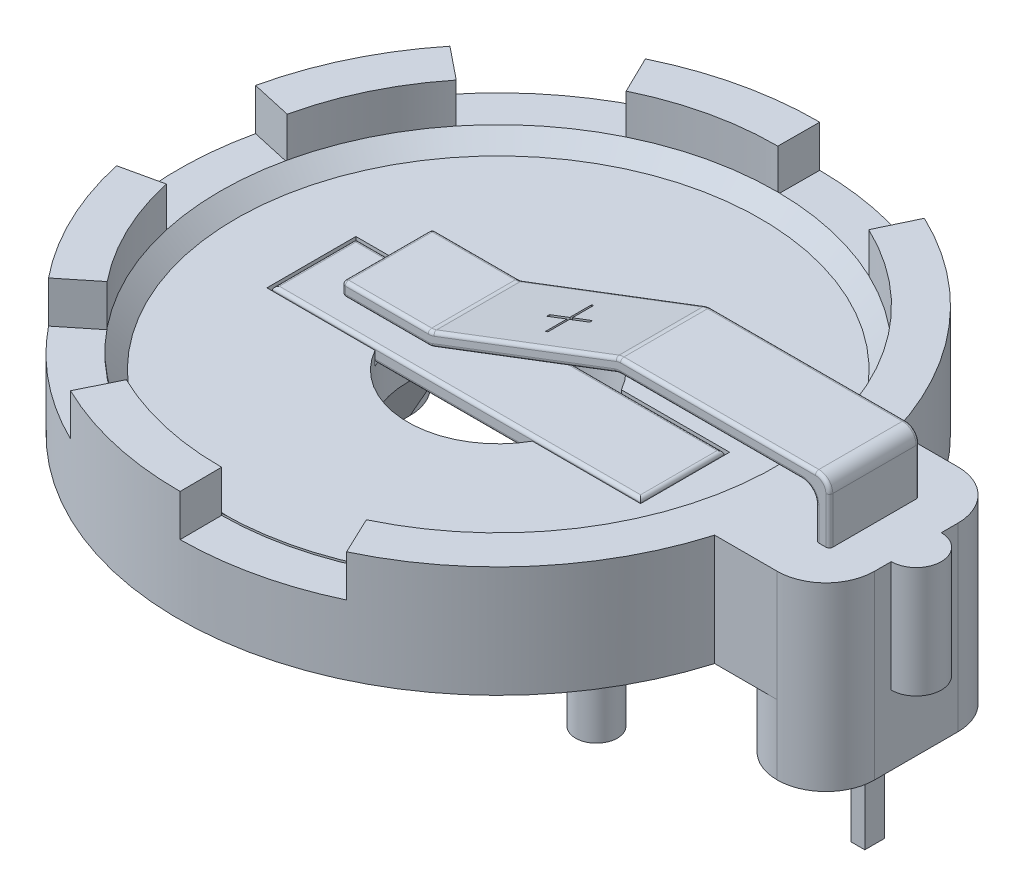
ISO-10303-21;
HEADER;
FILE_DESCRIPTION(('STEP AP214'),'2;1');
FILE_NAME('part.step','',(''),(''),'','','');
FILE_SCHEMA(('AUTOMOTIVE_DESIGN { 1 0 10303 214 1 1 1 1 }'));
ENDSEC;
DATA;
#1=APPLICATION_CONTEXT('core data for automotive mechanical design processes');
#2=APPLICATION_PROTOCOL_DEFINITION('international standard','automotive_design',2000,#1);
#3=PRODUCT_CONTEXT('',#1,'mechanical');
#4=PRODUCT('Part','Part','',(#3));
#5=PRODUCT_RELATED_PRODUCT_CATEGORY('part','',(#4));
#6=PRODUCT_DEFINITION_FORMATION('','',#4);
#7=PRODUCT_DEFINITION_CONTEXT('part definition',#1,'design');
#8=PRODUCT_DEFINITION('design','',#6,#7);
#9=PRODUCT_DEFINITION_SHAPE('','',#8);
#10=(LENGTH_UNIT() NAMED_UNIT(*) SI_UNIT(.MILLI.,.METRE.));
#11=(NAMED_UNIT(*) PLANE_ANGLE_UNIT() SI_UNIT($,.RADIAN.));
#12=(NAMED_UNIT(*) SI_UNIT($,.STERADIAN.) SOLID_ANGLE_UNIT());
#13=UNCERTAINTY_MEASURE_WITH_UNIT(LENGTH_MEASURE(1.E-05),#10,'distance_accuracy_value','');
#14=(GEOMETRIC_REPRESENTATION_CONTEXT(3) GLOBAL_UNCERTAINTY_ASSIGNED_CONTEXT((#13)) GLOBAL_UNIT_ASSIGNED_CONTEXT((#10,
#11,#12)) REPRESENTATION_CONTEXT('',''));
#15=CARTESIAN_POINT('',(0.,0.,0.));
#16=DIRECTION('',(0.,0.,1.));
#17=DIRECTION('',(1.,0.,0.));
#18=AXIS2_PLACEMENT_3D('',#15,#16,#17);
#19=CARTESIAN_POINT('',(5.9312057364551,5.67,1.625));
#20=DIRECTION('',(0.,1.,0.));
#21=DIRECTION('',(-1.,0.,0.));
#22=AXIS2_PLACEMENT_3D('',#19,#20,#21);
#23=PLANE('',#22);
#24=DIRECTION('',(0.,0.,-1.));
#25=VECTOR('',#24,1.);
#26=CARTESIAN_POINT('',(12.5312057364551,5.67,1.625));
#27=LINE('',#26,#25);
#28=CARTESIAN_POINT('',(12.5312057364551,5.67,-1.5));
#29=VERTEX_POINT('',#28);
#30=CARTESIAN_POINT('',(12.5312057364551,5.67,1.5));
#31=VERTEX_POINT('',#30);
#32=EDGE_CURVE('E473',#29,#31,#27,.F.);
#33=ORIENTED_EDGE('',*,*,#32,.T.);
#34=DIRECTION('',(1.,0.,0.));
#35=VECTOR('',#34,1.);
#36=CARTESIAN_POINT('',(5.9312057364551,5.67,1.5));
#37=LINE('',#36,#35);
#38=CARTESIAN_POINT('',(6.02302615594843,5.67,1.5));
#39=VERTEX_POINT('',#38);
#40=EDGE_CURVE('E540',#31,#39,#37,.F.);
#41=ORIENTED_EDGE('',*,*,#40,.T.);
#42=DIRECTION('',(0.,0.,-1.));
#43=VECTOR('',#42,1.);
#44=CARTESIAN_POINT('',(6.02302615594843,5.67,-1.625));
#45=LINE('',#44,#43);
#46=CARTESIAN_POINT('',(6.02302615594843,5.67,-1.5));
#47=VERTEX_POINT('',#46);
#48=EDGE_CURVE('E476',#39,#47,#45,.T.);
#49=ORIENTED_EDGE('',*,*,#48,.T.);
#50=DIRECTION('',(1.,0.,0.));
#51=VECTOR('',#50,1.);
#52=CARTESIAN_POINT('',(12.5312057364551,5.67,-1.5));
#53=LINE('',#52,#51);
#54=EDGE_CURVE('E538',#47,#29,#53,.T.);
#55=ORIENTED_EDGE('',*,*,#54,.T.);
#56=EDGE_LOOP('',(#33,#41,#49,#55));
#57=FACE_BOUND('',#56,.T.);
#58=ADVANCED_FACE('F47',(#57),#23,.F.);
#59=CARTESIAN_POINT('',(13.0312057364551,5.67,1.625));
#60=DIRECTION('',(1.,0.,0.));
#61=DIRECTION('',(0.,0.,-1.));
#62=AXIS2_PLACEMENT_3D('',#59,#60,#61);
#63=PLANE('',#62);
#64=DIRECTION('',(0.,0.,-1.));
#65=VECTOR('',#64,1.);
#66=CARTESIAN_POINT('',(13.0312057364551,4.,1.625));
#67=LINE('',#66,#65);
#68=CARTESIAN_POINT('',(13.0312057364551,4.,1.5));
#69=VERTEX_POINT('',#68);
#70=CARTESIAN_POINT('',(13.0312057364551,4.,-1.5));
#71=VERTEX_POINT('',#70);
#72=EDGE_CURVE('E453',#69,#71,#67,.T.);
#73=ORIENTED_EDGE('',*,*,#72,.F.);
#74=DIRECTION('',(0.,-1.,0.));
#75=VECTOR('',#74,1.);
#76=CARTESIAN_POINT('',(13.0312057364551,5.67,1.5));
#77=LINE('',#76,#75);
#78=CARTESIAN_POINT('',(13.0312057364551,5.17,1.5));
#79=VERTEX_POINT('',#78);
#80=EDGE_CURVE('E532',#69,#79,#77,.F.);
#81=ORIENTED_EDGE('',*,*,#80,.T.);
#82=DIRECTION('',(0.,0.,-1.));
#83=VECTOR('',#82,1.);
#84=CARTESIAN_POINT('',(13.0312057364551,5.17,-1.625));
#85=LINE('',#84,#83);
#86=CARTESIAN_POINT('',(13.0312057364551,5.17,-1.5));
#87=VERTEX_POINT('',#86);
#88=EDGE_CURVE('E485',#79,#87,#85,.T.);
#89=ORIENTED_EDGE('',*,*,#88,.T.);
#90=DIRECTION('',(0.,-1.,0.));
#91=VECTOR('',#90,1.);
#92=CARTESIAN_POINT('',(13.0312057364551,4.,-1.5));
#93=LINE('',#92,#91);
#94=EDGE_CURVE('E530',#87,#71,#93,.T.);
#95=ORIENTED_EDGE('',*,*,#94,.T.);
#96=EDGE_LOOP('',(#73,#81,#89,#95));
#97=FACE_BOUND('',#96,.T.);
#98=ADVANCED_FACE('F865',(#97),#63,.F.);
#99=CARTESIAN_POINT('',(13.5312057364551,4.,1.625));
#100=DIRECTION('',(0.,1.,0.));
#101=DIRECTION('',(0.,0.,1.));
#102=AXIS2_PLACEMENT_3D('',#99,#100,#101);
#103=PLANE('',#102);
#104=DIRECTION('',(1.,0.,0.));
#105=VECTOR('',#104,1.);
#106=CARTESIAN_POINT('',(13.5312057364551,4.,1.625));
#107=LINE('',#106,#105);
#108=CARTESIAN_POINT('',(13.1562057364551,4.,1.625));
#109=VERTEX_POINT('',#108);
#110=CARTESIAN_POINT('',(13.4062057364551,4.,1.625));
#111=VERTEX_POINT('',#110);
#112=EDGE_CURVE('E444',#109,#111,#107,.T.);
#113=ORIENTED_EDGE('',*,*,#112,.F.);
#114=CARTESIAN_POINT('',(13.1562057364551,4.,1.5));
#115=DIRECTION('',(0.,1.,0.));
#116=DIRECTION('',(0.,0.,1.));
#117=AXIS2_PLACEMENT_3D('',#114,#115,#116);
#118=CIRCLE('',#117,0.125);
#119=EDGE_CURVE('E528',#109,#69,#118,.F.);
#120=ORIENTED_EDGE('',*,*,#119,.T.);
#121=ORIENTED_EDGE('',*,*,#72,.T.);
#122=CARTESIAN_POINT('',(13.1562057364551,4.,-1.5));
#123=DIRECTION('',(0.,1.,0.));
#124=DIRECTION('',(0.,0.,1.));
#125=AXIS2_PLACEMENT_3D('',#122,#123,#124);
#126=CIRCLE('',#125,0.125);
#127=CARTESIAN_POINT('',(13.1562057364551,4.,-1.625));
#128=VERTEX_POINT('',#127);
#129=EDGE_CURVE('E526',#71,#128,#126,.F.);
#130=ORIENTED_EDGE('',*,*,#129,.T.);
#131=DIRECTION('',(1.,0.,0.));
#132=VECTOR('',#131,1.);
#133=CARTESIAN_POINT('',(13.5312057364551,4.,-1.625));
#134=LINE('',#133,#132);
#135=CARTESIAN_POINT('',(13.4062057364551,4.,-1.625));
#136=VERTEX_POINT('',#135);
#137=EDGE_CURVE('E448',#128,#136,#134,.T.);
#138=ORIENTED_EDGE('',*,*,#137,.T.);
#139=CARTESIAN_POINT('',(13.4062057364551,4.,-1.5));
#140=DIRECTION('',(0.,1.,0.));
#141=DIRECTION('',(0.,0.,1.));
#142=AXIS2_PLACEMENT_3D('',#139,#140,#141);
#143=CIRCLE('',#142,0.125);
#144=CARTESIAN_POINT('',(13.5312057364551,4.,-1.5));
#145=VERTEX_POINT('',#144);
#146=EDGE_CURVE('E524',#136,#145,#143,.F.);
#147=ORIENTED_EDGE('',*,*,#146,.T.);
#148=DIRECTION('',(0.,0.,-1.));
#149=VECTOR('',#148,1.);
#150=CARTESIAN_POINT('',(13.5312057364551,4.,1.625));
#151=LINE('',#150,#149);
#152=CARTESIAN_POINT('',(13.5312057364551,4.,1.5));
#153=VERTEX_POINT('',#152);
#154=EDGE_CURVE('E447',#153,#145,#151,.T.);
#155=ORIENTED_EDGE('',*,*,#154,.F.);
#156=CARTESIAN_POINT('',(13.4062057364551,4.,1.5));
#157=DIRECTION('',(0.,1.,0.));
#158=DIRECTION('',(0.,0.,1.));
#159=AXIS2_PLACEMENT_3D('',#156,#157,#158);
#160=CIRCLE('',#159,0.125);
#161=EDGE_CURVE('E522',#153,#111,#160,.F.);
#162=ORIENTED_EDGE('',*,*,#161,.T.);
#163=EDGE_LOOP('',(#113,#120,#121,#130,#138,#147,#155,#162));
#164=FACE_BOUND('',#163,.T.);
#165=ADVANCED_FACE('F747',(#164),#103,.F.);
#166=CARTESIAN_POINT('',(13.5312057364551,4.,1.625));
#167=DIRECTION('',(-1.,0.,0.));
#168=DIRECTION('',(0.,0.,1.));
#169=AXIS2_PLACEMENT_3D('',#166,#167,#168);
#170=PLANE('',#169);
#171=ORIENTED_EDGE('',*,*,#154,.T.);
#172=DIRECTION('',(0.,1.,0.));
#173=VECTOR('',#172,1.);
#174=CARTESIAN_POINT('',(13.5312057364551,5.67,-1.5));
#175=LINE('',#174,#173);
#176=CARTESIAN_POINT('',(13.5312057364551,5.67,-1.5));
#177=VERTEX_POINT('',#176);
#178=EDGE_CURVE('E586',#145,#177,#175,.T.);
#179=ORIENTED_EDGE('',*,*,#178,.T.);
#180=DIRECTION('',(0.,0.,-1.));
#181=VECTOR('',#180,1.);
#182=CARTESIAN_POINT('',(13.5312057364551,5.67,1.625));
#183=LINE('',#182,#181);
#184=CARTESIAN_POINT('',(13.5312057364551,5.67,1.5));
#185=VERTEX_POINT('',#184);
#186=EDGE_CURVE('E488',#177,#185,#183,.F.);
#187=ORIENTED_EDGE('',*,*,#186,.T.);
#188=DIRECTION('',(0.,1.,0.));
#189=VECTOR('',#188,1.);
#190=CARTESIAN_POINT('',(13.5312057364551,4.,1.5));
#191=LINE('',#190,#189);
#192=EDGE_CURVE('E584',#185,#153,#191,.F.);
#193=ORIENTED_EDGE('',*,*,#192,.T.);
#194=EDGE_LOOP('',(#171,#179,#187,#193));
#195=FACE_BOUND('',#194,.T.);
#196=ADVANCED_FACE('F857',(#195),#170,.F.);
#197=CARTESIAN_POINT('',(13.2812057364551,6.17,1.625));
#198=DIRECTION('',(0.,-1.,0.));
#199=DIRECTION('',(1.,0.,0.));
#200=AXIS2_PLACEMENT_3D('',#197,#198,#199);
#201=PLANE('',#200);
#202=DIRECTION('',(0.,0.,-1.));
#203=VECTOR('',#202,1.);
#204=CARTESIAN_POINT('',(13.0312057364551,6.17,1.625));
#205=LINE('',#204,#203);
#206=CARTESIAN_POINT('',(13.0312057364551,6.17,1.5));
#207=VERTEX_POINT('',#206);
#208=CARTESIAN_POINT('',(13.0312057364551,6.17,-1.5));
#209=VERTEX_POINT('',#208);
#210=EDGE_CURVE('E479',#207,#209,#205,.T.);
#211=ORIENTED_EDGE('',*,*,#210,.T.);
#212=DIRECTION('',(-1.,0.,0.));
#213=VECTOR('',#212,1.);
#214=CARTESIAN_POINT('',(6.02302615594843,6.17,-1.5));
#215=LINE('',#214,#213);
#216=CARTESIAN_POINT('',(6.02302615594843,6.17,-1.5));
#217=VERTEX_POINT('',#216);
#218=EDGE_CURVE('E594',#209,#217,#215,.T.);
#219=ORIENTED_EDGE('',*,*,#218,.T.);
#220=DIRECTION('',(0.,0.,-1.));
#221=VECTOR('',#220,1.);
#222=CARTESIAN_POINT('',(6.02302615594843,6.17,1.625));
#223=LINE('',#222,#221);
#224=CARTESIAN_POINT('',(6.02302615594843,6.17,1.5));
#225=VERTEX_POINT('',#224);
#226=EDGE_CURVE('E482',#217,#225,#223,.F.);
#227=ORIENTED_EDGE('',*,*,#226,.T.);
#228=DIRECTION('',(-1.,0.,0.));
#229=VECTOR('',#228,1.);
#230=CARTESIAN_POINT('',(13.2812057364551,6.17,1.5));
#231=LINE('',#230,#229);
#232=EDGE_CURVE('E592',#225,#207,#231,.F.);
#233=ORIENTED_EDGE('',*,*,#232,.T.);
#234=EDGE_LOOP('',(#211,#219,#227,#233));
#235=FACE_BOUND('',#234,.T.);
#236=ADVANCED_FACE('F818',(#235),#201,.F.);
#237=CARTESIAN_POINT('',(5.9312057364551,6.17,1.625));
#238=DIRECTION('',(0.355299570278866,-0.93475248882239,0.));
#239=DIRECTION('',(0.93475248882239,0.355299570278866,0.));
#240=AXIS2_PLACEMENT_3D('',#237,#238,#239);
#241=PLANE('',#240);
#242=DIRECTION('',(0.93475248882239,0.355299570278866,0.));
#243=VECTOR('',#242,1.);
#244=CARTESIAN_POINT('',(3.337267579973,5.18404369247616,0.0499999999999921));
#245=LINE('',#244,#243);
#246=CARTESIAN_POINT('',(2.61283440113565,4.90868652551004,0.049999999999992));
#247=VERTEX_POINT('',#246);
#248=CARTESIAN_POINT('',(3.337267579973,5.18404369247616,0.0499999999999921));
#249=VERTEX_POINT('',#248);
#250=EDGE_CURVE('E394',#247,#249,#245,.T.);
#251=ORIENTED_EDGE('',*,*,#250,.F.);
#252=DIRECTION('',(0.,0.,-1.));
#253=VECTOR('',#252,1.);
#254=CARTESIAN_POINT('',(2.61283440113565,4.90868652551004,0.824999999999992));
#255=LINE('',#254,#253);
#256=CARTESIAN_POINT('',(2.61283440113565,4.90868652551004,0.824999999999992));
#257=VERTEX_POINT('',#256);
#258=EDGE_CURVE('E64',#257,#247,#255,.T.);
#259=ORIENTED_EDGE('',*,*,#258,.F.);
#260=DIRECTION('',(0.934752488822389,0.355299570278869,0.));
#261=VECTOR('',#260,1.);
#262=CARTESIAN_POINT('',(2.51935915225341,4.87315656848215,0.824999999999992));
#263=LINE('',#262,#261);
#264=CARTESIAN_POINT('',(2.51935915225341,4.87315656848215,0.824999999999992));
#265=VERTEX_POINT('',#264);
#266=EDGE_CURVE('E362',#265,#257,#263,.T.);
#267=ORIENTED_EDGE('',*,*,#266,.F.);
#268=DIRECTION('',(0.,0.,1.));
#269=VECTOR('',#268,1.);
#270=CARTESIAN_POINT('',(2.51935915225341,4.87315656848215,0.0499999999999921));
#271=LINE('',#270,#269);
#272=CARTESIAN_POINT('',(2.51935915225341,4.87315656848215,0.0499999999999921));
#273=VERTEX_POINT('',#272);
#274=EDGE_CURVE('E365',#273,#265,#271,.T.);
#275=ORIENTED_EDGE('',*,*,#274,.F.);
#276=DIRECTION('',(0.93475248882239,0.355299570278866,0.));
#277=VECTOR('',#276,1.);
#278=CARTESIAN_POINT('',(1.79492597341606,4.59779940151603,0.0499999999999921));
#279=LINE('',#278,#277);
#280=CARTESIAN_POINT('',(1.79492597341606,4.59779940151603,0.0499999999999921));
#281=VERTEX_POINT('',#280);
#282=EDGE_CURVE('E417',#281,#273,#279,.T.);
#283=ORIENTED_EDGE('',*,*,#282,.F.);
#284=DIRECTION('',(0.,0.,1.));
#285=VECTOR('',#284,1.);
#286=CARTESIAN_POINT('',(1.79492597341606,4.59779940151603,-0.0500000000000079));
#287=LINE('',#286,#285);
#288=CARTESIAN_POINT('',(1.79492597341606,4.59779940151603,-0.0500000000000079));
#289=VERTEX_POINT('',#288);
#290=EDGE_CURVE('E414',#289,#281,#287,.T.);
#291=ORIENTED_EDGE('',*,*,#290,.F.);
#292=DIRECTION('',(-0.93475248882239,-0.355299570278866,0.));
#293=VECTOR('',#292,1.);
#294=CARTESIAN_POINT('',(2.51935915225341,4.87315656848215,-0.0500000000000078));
#295=LINE('',#294,#293);
#296=CARTESIAN_POINT('',(2.51935915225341,4.87315656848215,-0.0500000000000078));
#297=VERTEX_POINT('',#296);
#298=EDGE_CURVE('E411',#297,#289,#295,.T.);
#299=ORIENTED_EDGE('',*,*,#298,.F.);
#300=DIRECTION('',(0.,0.,1.));
#301=VECTOR('',#300,1.);
#302=CARTESIAN_POINT('',(2.51935915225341,4.87315656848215,-0.825000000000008));
#303=LINE('',#302,#301);
#304=CARTESIAN_POINT('',(2.51935915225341,4.87315656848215,-0.825000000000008));
#305=VERTEX_POINT('',#304);
#306=EDGE_CURVE('E408',#305,#297,#303,.T.);
#307=ORIENTED_EDGE('',*,*,#306,.F.);
#308=DIRECTION('',(-0.934752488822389,-0.355299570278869,0.));
#309=VECTOR('',#308,1.);
#310=CARTESIAN_POINT('',(2.61283440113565,4.90868652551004,-0.825000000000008));
#311=LINE('',#310,#309);
#312=CARTESIAN_POINT('',(2.61283440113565,4.90868652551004,-0.825000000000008));
#313=VERTEX_POINT('',#312);
#314=EDGE_CURVE('E405',#313,#305,#311,.T.);
#315=ORIENTED_EDGE('',*,*,#314,.F.);
#316=DIRECTION('',(0.,0.,-1.));
#317=VECTOR('',#316,1.);
#318=CARTESIAN_POINT('',(2.61283440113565,4.90868652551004,-0.0500000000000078));
#319=LINE('',#318,#317);
#320=CARTESIAN_POINT('',(2.61283440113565,4.90868652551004,-0.0500000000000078));
#321=VERTEX_POINT('',#320);
#322=EDGE_CURVE('E402',#321,#313,#319,.T.);
#323=ORIENTED_EDGE('',*,*,#322,.F.);
#324=DIRECTION('',(-0.93475248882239,-0.355299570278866,0.));
#325=VECTOR('',#324,1.);
#326=CARTESIAN_POINT('',(3.337267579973,5.18404369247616,-0.0500000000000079));
#327=LINE('',#326,#325);
#328=CARTESIAN_POINT('',(3.337267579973,5.18404369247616,-0.0500000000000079));
#329=VERTEX_POINT('',#328);
#330=EDGE_CURVE('E399',#329,#321,#327,.T.);
#331=ORIENTED_EDGE('',*,*,#330,.F.);
#332=DIRECTION('',(0.,0.,-1.));
#333=VECTOR('',#332,1.);
#334=CARTESIAN_POINT('',(3.337267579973,5.18404369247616,-0.0500000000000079));
#335=LINE('',#334,#333);
#336=EDGE_CURVE('E396',#249,#329,#335,.T.);
#337=ORIENTED_EDGE('',*,*,#336,.F.);
#338=EDGE_LOOP('',(#251,#259,#267,#275,#283,#291,#299,#307,#315,#323,#331,#337));
#339=FACE_BOUND('',#338,.T.);
#340=DIRECTION('',(0.,0.,-1.));
#341=VECTOR('',#340,1.);
#342=CARTESIAN_POINT('',(5.845376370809,6.1373762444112,1.625));
#343=LINE('',#342,#341);
#344=CARTESIAN_POINT('',(5.845376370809,6.1373762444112,1.5));
#345=VERTEX_POINT('',#344);
#346=CARTESIAN_POINT('',(5.845376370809,6.1373762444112,-1.5));
#347=VERTEX_POINT('',#346);
#348=EDGE_CURVE('E467',#345,#347,#343,.T.);
#349=ORIENTED_EDGE('',*,*,#348,.T.);
#350=DIRECTION('',(-0.93475248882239,-0.355299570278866,0.));
#351=VECTOR('',#350,1.);
#352=CARTESIAN_POINT('',(-0.713182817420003,3.64446684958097,-1.5));
#353=LINE('',#352,#351);
#354=CARTESIAN_POINT('',(-0.713182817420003,3.64446684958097,-1.5));
#355=VERTEX_POINT('',#354);
#356=EDGE_CURVE('E602',#347,#355,#353,.T.);
#357=ORIENTED_EDGE('',*,*,#356,.T.);
#358=DIRECTION('',(0.,0.,-1.));
#359=VECTOR('',#358,1.);
#360=CARTESIAN_POINT('',(-0.713182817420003,3.64446684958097,1.625));
#361=LINE('',#360,#359);
#362=CARTESIAN_POINT('',(-0.713182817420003,3.64446684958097,1.5));
#363=VERTEX_POINT('',#362);
#364=EDGE_CURVE('E470',#355,#363,#361,.F.);
#365=ORIENTED_EDGE('',*,*,#364,.T.);
#366=DIRECTION('',(-0.93475248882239,-0.355299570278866,0.));
#367=VECTOR('',#366,1.);
#368=CARTESIAN_POINT('',(5.9312057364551,6.17,1.5));
#369=LINE('',#368,#367);
#370=EDGE_CURVE('E600',#363,#345,#369,.F.);
#371=ORIENTED_EDGE('',*,*,#370,.T.);
#372=EDGE_LOOP('',(#349,#357,#365,#371));
#373=FACE_BOUND('',#372,.T.);
#374=ADVANCED_FACE('F945',(#339,#373),#241,.F.);
#375=CARTESIAN_POINT('',(-0.799012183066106,3.61184309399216,1.625));
#376=DIRECTION('',(0.,-1.,0.));
#377=DIRECTION('',(0.,0.,-1.));
#378=AXIS2_PLACEMENT_3D('',#375,#376,#377);
#379=PLANE('',#378);
#380=DIRECTION('',(0.,0.,-1.));
#381=VECTOR('',#380,1.);
#382=CARTESIAN_POINT('',(-0.890832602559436,3.61184309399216,-1.625));
#383=LINE('',#382,#381);
#384=CARTESIAN_POINT('',(-0.890832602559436,3.61184309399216,1.5));
#385=VERTEX_POINT('',#384);
#386=CARTESIAN_POINT('',(-0.890832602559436,3.61184309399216,-1.5));
#387=VERTEX_POINT('',#386);
#388=EDGE_CURVE('E465',#385,#387,#383,.T.);
#389=ORIENTED_EDGE('',*,*,#388,.T.);
#390=DIRECTION('',(-1.,0.,0.));
#391=VECTOR('',#390,1.);
#392=CARTESIAN_POINT('',(-3.99901218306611,3.61184309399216,-1.5));
#393=LINE('',#392,#391);
#394=CARTESIAN_POINT('',(-3.87401218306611,3.61184309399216,-1.5));
#395=VERTEX_POINT('',#394);
#396=EDGE_CURVE('E12',#387,#395,#393,.T.);
#397=ORIENTED_EDGE('',*,*,#396,.T.);
#398=DIRECTION('',(0.,0.,-1.));
#399=VECTOR('',#398,1.);
#400=CARTESIAN_POINT('',(-3.87401218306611,3.61184309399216,1.625));
#401=LINE('',#400,#399);
#402=CARTESIAN_POINT('',(-3.87401218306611,3.61184309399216,1.5));
#403=VERTEX_POINT('',#402);
#404=EDGE_CURVE('E56',#395,#403,#401,.F.);
#405=ORIENTED_EDGE('',*,*,#404,.T.);
#406=DIRECTION('',(-1.,0.,0.));
#407=VECTOR('',#406,1.);
#408=CARTESIAN_POINT('',(-0.799012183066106,3.61184309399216,1.5));
#409=LINE('',#408,#407);
#410=EDGE_CURVE('E623',#403,#385,#409,.F.);
#411=ORIENTED_EDGE('',*,*,#410,.T.);
#412=EDGE_LOOP('',(#389,#397,#405,#411));
#413=FACE_BOUND('',#412,.T.);
#414=ADVANCED_FACE('F932',(#413),#379,.F.);
#415=CARTESIAN_POINT('',(-3.99901218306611,3.61184309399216,1.625));
#416=DIRECTION('',(1.,0.,0.));
#417=DIRECTION('',(0.,1.,0.));
#418=AXIS2_PLACEMENT_3D('',#415,#416,#417);
#419=PLANE('',#418);
#420=DIRECTION('',(0.,0.,-1.));
#421=VECTOR('',#420,1.);
#422=CARTESIAN_POINT('',(-3.99901218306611,3.48684309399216,1.625));
#423=LINE('',#422,#421);
#424=CARTESIAN_POINT('',(-3.99901218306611,3.48684309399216,1.5));
#425=VERTEX_POINT('',#424);
#426=CARTESIAN_POINT('',(-3.99901218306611,3.48684309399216,-1.5));
#427=VERTEX_POINT('',#426);
#428=EDGE_CURVE('E616',#425,#427,#423,.T.);
#429=ORIENTED_EDGE('',*,*,#428,.T.);
#430=DIRECTION('',(0.,-1.,0.));
#431=VECTOR('',#430,1.);
#432=CARTESIAN_POINT('',(-3.99901218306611,3.11184309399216,-1.5));
#433=LINE('',#432,#431);
#434=CARTESIAN_POINT('',(-3.99901218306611,3.23684309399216,-1.5));
#435=VERTEX_POINT('',#434);
#436=EDGE_CURVE('E621',#427,#435,#433,.T.);
#437=ORIENTED_EDGE('',*,*,#436,.T.);
#438=DIRECTION('',(0.,0.,-1.));
#439=VECTOR('',#438,1.);
#440=CARTESIAN_POINT('',(-3.99901218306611,3.23684309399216,1.625));
#441=LINE('',#440,#439);
#442=CARTESIAN_POINT('',(-3.99901218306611,3.23684309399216,1.5));
#443=VERTEX_POINT('',#442);
#444=EDGE_CURVE('E618',#435,#443,#441,.F.);
#445=ORIENTED_EDGE('',*,*,#444,.T.);
#446=DIRECTION('',(0.,-1.,0.));
#447=VECTOR('',#446,1.);
#448=CARTESIAN_POINT('',(-3.99901218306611,3.61184309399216,1.5));
#449=LINE('',#448,#447);
#450=EDGE_CURVE('E614',#443,#425,#449,.F.);
#451=ORIENTED_EDGE('',*,*,#450,.T.);
#452=EDGE_LOOP('',(#429,#437,#445,#451));
#453=FACE_BOUND('',#452,.T.);
#454=ADVANCED_FACE('F927',(#453),#419,.F.);
#455=CARTESIAN_POINT('',(-3.99901218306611,3.11184309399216,1.625));
#456=DIRECTION('',(0.,1.,0.));
#457=DIRECTION('',(-1.,0.,0.));
#458=AXIS2_PLACEMENT_3D('',#455,#456,#457);
#459=PLANE('',#458);
#460=DIRECTION('',(0.,0.,-1.));
#461=VECTOR('',#460,1.);
#462=CARTESIAN_POINT('',(-0.890832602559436,3.11184309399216,1.625));
#463=LINE('',#462,#461);
#464=CARTESIAN_POINT('',(-0.890832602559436,3.11184309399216,-1.5));
#465=VERTEX_POINT('',#464);
#466=CARTESIAN_POINT('',(-0.890832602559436,3.11184309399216,1.5));
#467=VERTEX_POINT('',#466);
#468=EDGE_CURVE('E462',#465,#467,#463,.F.);
#469=ORIENTED_EDGE('',*,*,#468,.T.);
#470=DIRECTION('',(1.,0.,0.));
#471=VECTOR('',#470,1.);
#472=CARTESIAN_POINT('',(-3.99901218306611,3.11184309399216,1.5));
#473=LINE('',#472,#471);
#474=CARTESIAN_POINT('',(-3.87401218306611,3.11184309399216,1.5));
#475=VERTEX_POINT('',#474);
#476=EDGE_CURVE('E612',#467,#475,#473,.F.);
#477=ORIENTED_EDGE('',*,*,#476,.T.);
#478=DIRECTION('',(0.,0.,-1.));
#479=VECTOR('',#478,1.);
#480=CARTESIAN_POINT('',(-3.87401218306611,3.11184309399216,1.625));
#481=LINE('',#480,#479);
#482=CARTESIAN_POINT('',(-3.87401218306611,3.11184309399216,-1.5));
#483=VERTEX_POINT('',#482);
#484=EDGE_CURVE('E610',#475,#483,#481,.T.);
#485=ORIENTED_EDGE('',*,*,#484,.T.);
#486=DIRECTION('',(1.,0.,0.));
#487=VECTOR('',#486,1.);
#488=CARTESIAN_POINT('',(-0.890832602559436,3.11184309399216,-1.5));
#489=LINE('',#488,#487);
#490=EDGE_CURVE('E608',#483,#465,#489,.T.);
#491=ORIENTED_EDGE('',*,*,#490,.T.);
#492=EDGE_LOOP('',(#469,#477,#485,#491));
#493=FACE_BOUND('',#492,.T.);
#494=ADVANCED_FACE('F912',(#493),#459,.F.);
#495=CARTESIAN_POINT('',(5.9312057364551,5.67,1.625));
#496=DIRECTION('',(-0.355299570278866,0.93475248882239,0.));
#497=DIRECTION('',(-0.934752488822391,-0.355299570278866,0.));
#498=AXIS2_PLACEMENT_3D('',#495,#496,#497);
#499=PLANE('',#498);
#500=DIRECTION('',(0.,0.,-1.));
#501=VECTOR('',#500,1.);
#502=CARTESIAN_POINT('',(5.845376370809,5.63737624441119,1.625));
#503=LINE('',#502,#501);
#504=CARTESIAN_POINT('',(5.845376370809,5.63737624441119,-1.5));
#505=VERTEX_POINT('',#504);
#506=CARTESIAN_POINT('',(5.845376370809,5.63737624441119,1.5));
#507=VERTEX_POINT('',#506);
#508=EDGE_CURVE('E456',#505,#507,#503,.F.);
#509=ORIENTED_EDGE('',*,*,#508,.T.);
#510=DIRECTION('',(0.934752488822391,0.355299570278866,0.));
#511=VECTOR('',#510,1.);
#512=CARTESIAN_POINT('',(5.9312057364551,5.67,1.5));
#513=LINE('',#512,#511);
#514=CARTESIAN_POINT('',(-0.713182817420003,3.14446684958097,1.5));
#515=VERTEX_POINT('',#514);
#516=EDGE_CURVE('E548',#507,#515,#513,.F.);
#517=ORIENTED_EDGE('',*,*,#516,.T.);
#518=DIRECTION('',(0.,0.,-1.));
#519=VECTOR('',#518,1.);
#520=CARTESIAN_POINT('',(-0.713182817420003,3.14446684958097,1.625));
#521=LINE('',#520,#519);
#522=CARTESIAN_POINT('',(-0.713182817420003,3.14446684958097,-1.5));
#523=VERTEX_POINT('',#522);
#524=EDGE_CURVE('E459',#515,#523,#521,.T.);
#525=ORIENTED_EDGE('',*,*,#524,.T.);
#526=DIRECTION('',(0.934752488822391,0.355299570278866,0.));
#527=VECTOR('',#526,1.);
#528=CARTESIAN_POINT('',(5.845376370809,5.63737624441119,-1.5));
#529=LINE('',#528,#527);
#530=EDGE_CURVE('E546',#523,#505,#529,.T.);
#531=ORIENTED_EDGE('',*,*,#530,.T.);
#532=EDGE_LOOP('',(#509,#517,#525,#531));
#533=FACE_BOUND('',#532,.T.);
#534=ADVANCED_FACE('F896',(#533),#499,.F.);
#535=CARTESIAN_POINT('',(13.0312057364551,5.67,1.625));
#536=DIRECTION('',(0.,0.,-1.));
#537=DIRECTION('',(-1.,0.,0.));
#538=AXIS2_PLACEMENT_3D('',#535,#536,#537);
#539=PLANE('',#538);
#540=CARTESIAN_POINT('',(12.5312057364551,5.17,1.625));
#541=DIRECTION('',(0.,0.,-1.));
#542=DIRECTION('',(-1.,0.,0.));
#543=AXIS2_PLACEMENT_3D('',#540,#541,#542);
#544=CIRCLE('',#543,0.625);
#545=CARTESIAN_POINT('',(12.5312057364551,5.795,1.625));
#546=VERTEX_POINT('',#545);
#547=CARTESIAN_POINT('',(13.1562057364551,5.17,1.625));
#548=VERTEX_POINT('',#547);
#549=EDGE_CURVE('E517',#546,#548,#544,.T.);
#550=ORIENTED_EDGE('',*,*,#549,.T.);
#551=DIRECTION('',(0.,-1.,0.));
#552=VECTOR('',#551,1.);
#553=CARTESIAN_POINT('',(13.1562057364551,5.67,1.625));
#554=LINE('',#553,#552);
#555=EDGE_CURVE('E519',#548,#109,#554,.T.);
#556=ORIENTED_EDGE('',*,*,#555,.T.);
#557=ORIENTED_EDGE('',*,*,#112,.T.);
#558=DIRECTION('',(0.,1.,0.));
#559=VECTOR('',#558,1.);
#560=CARTESIAN_POINT('',(13.4062057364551,5.67,1.625));
#561=LINE('',#560,#559);
#562=CARTESIAN_POINT('',(13.4062057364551,5.67,1.625));
#563=VERTEX_POINT('',#562);
#564=EDGE_CURVE('E507',#111,#563,#561,.T.);
#565=ORIENTED_EDGE('',*,*,#564,.T.);
#566=CARTESIAN_POINT('',(13.0312057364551,5.67,1.625));
#567=DIRECTION('',(0.,0.,-1.));
#568=DIRECTION('',(-1.,0.,0.));
#569=AXIS2_PLACEMENT_3D('',#566,#567,#568);
#570=CIRCLE('',#569,0.375);
#571=CARTESIAN_POINT('',(13.0312057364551,6.045,1.625));
#572=VERTEX_POINT('',#571);
#573=EDGE_CURVE('E505',#563,#572,#570,.F.);
#574=ORIENTED_EDGE('',*,*,#573,.T.);
#575=DIRECTION('',(-1.,0.,0.));
#576=VECTOR('',#575,1.);
#577=CARTESIAN_POINT('',(13.0312057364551,6.045,1.625));
#578=LINE('',#577,#576);
#579=CARTESIAN_POINT('',(6.02302615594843,6.045,1.625));
#580=VERTEX_POINT('',#579);
#581=EDGE_CURVE('E503',#572,#580,#578,.T.);
#582=ORIENTED_EDGE('',*,*,#581,.T.);
#583=CARTESIAN_POINT('',(6.02302615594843,5.67,1.625));
#584=DIRECTION('',(0.,0.,-1.));
#585=DIRECTION('',(-1.,0.,0.));
#586=AXIS2_PLACEMENT_3D('',#583,#584,#585);
#587=CIRCLE('',#586,0.375);
#588=CARTESIAN_POINT('',(5.88978881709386,6.0205321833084,1.625));
#589=VERTEX_POINT('',#588);
#590=EDGE_CURVE('E501',#580,#589,#587,.F.);
#591=ORIENTED_EDGE('',*,*,#590,.T.);
#592=DIRECTION('',(-0.93475248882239,-0.355299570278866,0.));
#593=VECTOR('',#592,1.);
#594=CARTESIAN_POINT('',(12.0132713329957,8.34806886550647,1.625));
#595=LINE('',#594,#593);
#596=CARTESIAN_POINT('',(-0.668770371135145,3.52762278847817,1.625));
#597=VERTEX_POINT('',#596);
#598=EDGE_CURVE('E499',#589,#597,#595,.T.);
#599=ORIENTED_EDGE('',*,*,#598,.T.);
#600=CARTESIAN_POINT('',(-0.890832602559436,4.11184309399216,1.625));
#601=DIRECTION('',(0.,0.,-1.));
#602=DIRECTION('',(-1.,0.,0.));
#603=AXIS2_PLACEMENT_3D('',#600,#601,#602);
#604=CIRCLE('',#603,0.625);
#605=CARTESIAN_POINT('',(-0.890832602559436,3.48684309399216,1.625));
#606=VERTEX_POINT('',#605);
#607=EDGE_CURVE('E497',#597,#606,#604,.T.);
#608=ORIENTED_EDGE('',*,*,#607,.T.);
#609=DIRECTION('',(-1.,0.,0.));
#610=VECTOR('',#609,1.);
#611=CARTESIAN_POINT('',(13.0312057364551,3.48684309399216,1.625));
#612=LINE('',#611,#610);
#613=CARTESIAN_POINT('',(-3.87401218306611,3.48684309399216,1.625));
#614=VERTEX_POINT('',#613);
#615=EDGE_CURVE('E493',#606,#614,#612,.T.);
#616=ORIENTED_EDGE('',*,*,#615,.T.);
#617=DIRECTION('',(0.,-1.,0.));
#618=VECTOR('',#617,1.);
#619=CARTESIAN_POINT('',(-3.87401218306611,5.66999999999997,1.625));
#620=LINE('',#619,#618);
#621=CARTESIAN_POINT('',(-3.8740121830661,3.23684309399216,1.625));
#622=VERTEX_POINT('',#621);
#623=EDGE_CURVE('E491',#614,#622,#620,.T.);
#624=ORIENTED_EDGE('',*,*,#623,.T.);
#625=DIRECTION('',(1.,0.,0.));
#626=VECTOR('',#625,1.);
#627=CARTESIAN_POINT('',(13.0312057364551,3.23684309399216,1.625));
#628=LINE('',#627,#626);
#629=CARTESIAN_POINT('',(-0.890832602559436,3.23684309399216,1.625));
#630=VERTEX_POINT('',#629);
#631=EDGE_CURVE('E495',#622,#630,#628,.T.);
#632=ORIENTED_EDGE('',*,*,#631,.T.);
#633=CARTESIAN_POINT('',(-0.890832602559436,3.61184309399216,1.625));
#634=DIRECTION('',(0.,0.,-1.));
#635=DIRECTION('',(-1.,0.,0.));
#636=AXIS2_PLACEMENT_3D('',#633,#634,#635);
#637=CIRCLE('',#636,0.375);
#638=CARTESIAN_POINT('',(-0.757595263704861,3.26131091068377,1.625));
#639=VERTEX_POINT('',#638);
#640=EDGE_CURVE('E509',#630,#639,#637,.F.);
#641=ORIENTED_EDGE('',*,*,#640,.T.);
#642=DIRECTION('',(0.934752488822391,0.355299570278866,0.));
#643=VECTOR('',#642,1.);
#644=CARTESIAN_POINT('',(12.0905050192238,8.14487588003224,1.625));
#645=LINE('',#644,#643);
#646=CARTESIAN_POINT('',(5.80096392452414,5.75422030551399,1.625));
#647=VERTEX_POINT('',#646);
#648=EDGE_CURVE('E511',#639,#647,#645,.T.);
#649=ORIENTED_EDGE('',*,*,#648,.T.);
#650=CARTESIAN_POINT('',(6.02302615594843,5.17,1.625));
#651=DIRECTION('',(0.,0.,-1.));
#652=DIRECTION('',(-1.,0.,0.));
#653=AXIS2_PLACEMENT_3D('',#650,#651,#652);
#654=CIRCLE('',#653,0.625);
#655=CARTESIAN_POINT('',(6.02302615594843,5.795,1.625));
#656=VERTEX_POINT('',#655);
#657=EDGE_CURVE('E513',#647,#656,#654,.T.);
#658=ORIENTED_EDGE('',*,*,#657,.T.);
#659=DIRECTION('',(1.,0.,0.));
#660=VECTOR('',#659,1.);
#661=CARTESIAN_POINT('',(13.0312057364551,5.795,1.625));
#662=LINE('',#661,#660);
#663=EDGE_CURVE('E515',#656,#546,#662,.T.);
#664=ORIENTED_EDGE('',*,*,#663,.T.);
#665=EDGE_LOOP('',(#550,#556,#557,#565,#574,#582,#591,#599,#608,#616,#624,#632,#641,#649,#658,#664));
#666=FACE_BOUND('',#665,.T.);
#667=ADVANCED_FACE('F837',(#666),#539,.F.);
#668=CARTESIAN_POINT('',(13.0312057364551,5.67,-1.625));
#669=DIRECTION('',(0.,0.,-1.));
#670=DIRECTION('',(-1.,0.,0.));
#671=AXIS2_PLACEMENT_3D('',#668,#669,#670);
#672=PLANE('',#671);
#673=ORIENTED_EDGE('',*,*,#137,.F.);
#674=DIRECTION('',(0.,-1.,0.));
#675=VECTOR('',#674,1.);
#676=CARTESIAN_POINT('',(13.1562057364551,5.17,-1.625));
#677=LINE('',#676,#675);
#678=CARTESIAN_POINT('',(13.1562057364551,5.17,-1.625));
#679=VERTEX_POINT('',#678);
#680=EDGE_CURVE('E582',#128,#679,#677,.F.);
#681=ORIENTED_EDGE('',*,*,#680,.T.);
#682=CARTESIAN_POINT('',(12.5312057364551,5.17,-1.625));
#683=DIRECTION('',(0.,0.,-1.));
#684=DIRECTION('',(-1.,0.,0.));
#685=AXIS2_PLACEMENT_3D('',#682,#683,#684);
#686=CIRCLE('',#685,0.625);
#687=CARTESIAN_POINT('',(12.5312057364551,5.795,-1.625));
#688=VERTEX_POINT('',#687);
#689=EDGE_CURVE('E580',#679,#688,#686,.F.);
#690=ORIENTED_EDGE('',*,*,#689,.T.);
#691=DIRECTION('',(1.,0.,0.));
#692=VECTOR('',#691,1.);
#693=CARTESIAN_POINT('',(6.02302615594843,5.795,-1.625));
#694=LINE('',#693,#692);
#695=CARTESIAN_POINT('',(6.02302615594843,5.795,-1.625));
#696=VERTEX_POINT('',#695);
#697=EDGE_CURVE('E578',#688,#696,#694,.F.);
#698=ORIENTED_EDGE('',*,*,#697,.T.);
#699=CARTESIAN_POINT('',(6.02302615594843,5.17,-1.625));
#700=DIRECTION('',(0.,0.,-1.));
#701=DIRECTION('',(-1.,0.,0.));
#702=AXIS2_PLACEMENT_3D('',#699,#700,#701);
#703=CIRCLE('',#702,0.625);
#704=CARTESIAN_POINT('',(5.80096392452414,5.75422030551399,-1.625));
#705=VERTEX_POINT('',#704);
#706=EDGE_CURVE('E576',#696,#705,#703,.F.);
#707=ORIENTED_EDGE('',*,*,#706,.T.);
#708=DIRECTION('',(0.934752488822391,0.355299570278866,0.));
#709=VECTOR('',#708,1.);
#710=CARTESIAN_POINT('',(-0.757595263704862,3.26131091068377,-1.625));
#711=LINE('',#710,#709);
#712=CARTESIAN_POINT('',(-0.757595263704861,3.26131091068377,-1.625));
#713=VERTEX_POINT('',#712);
#714=EDGE_CURVE('E574',#705,#713,#711,.F.);
#715=ORIENTED_EDGE('',*,*,#714,.T.);
#716=CARTESIAN_POINT('',(-0.890832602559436,3.61184309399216,-1.625));
#717=DIRECTION('',(0.,0.,-1.));
#718=DIRECTION('',(-1.,0.,0.));
#719=AXIS2_PLACEMENT_3D('',#716,#717,#718);
#720=CIRCLE('',#719,0.375);
#721=CARTESIAN_POINT('',(-0.890832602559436,3.23684309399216,-1.625));
#722=VERTEX_POINT('',#721);
#723=EDGE_CURVE('E572',#713,#722,#720,.T.);
#724=ORIENTED_EDGE('',*,*,#723,.T.);
#725=DIRECTION('',(1.,0.,0.));
#726=VECTOR('',#725,1.);
#727=CARTESIAN_POINT('',(-3.99901218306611,3.23684309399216,-1.625));
#728=LINE('',#727,#726);
#729=CARTESIAN_POINT('',(-3.87401218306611,3.23684309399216,-1.625));
#730=VERTEX_POINT('',#729);
#731=EDGE_CURVE('E558',#722,#730,#728,.F.);
#732=ORIENTED_EDGE('',*,*,#731,.T.);
#733=DIRECTION('',(0.,-1.,0.));
#734=VECTOR('',#733,1.);
#735=CARTESIAN_POINT('',(-3.87401218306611,3.61184309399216,-1.625));
#736=LINE('',#735,#734);
#737=CARTESIAN_POINT('',(-3.87401218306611,3.48684309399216,-1.625));
#738=VERTEX_POINT('',#737);
#739=EDGE_CURVE('E554',#730,#738,#736,.F.);
#740=ORIENTED_EDGE('',*,*,#739,.T.);
#741=DIRECTION('',(-1.,0.,0.));
#742=VECTOR('',#741,1.);
#743=CARTESIAN_POINT('',(-0.890832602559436,3.48684309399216,-1.625));
#744=LINE('',#743,#742);
#745=CARTESIAN_POINT('',(-0.890832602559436,3.48684309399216,-1.625));
#746=VERTEX_POINT('',#745);
#747=EDGE_CURVE('E556',#738,#746,#744,.F.);
#748=ORIENTED_EDGE('',*,*,#747,.T.);
#749=CARTESIAN_POINT('',(-0.890832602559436,4.11184309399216,-1.625));
#750=DIRECTION('',(0.,0.,-1.));
#751=DIRECTION('',(-1.,0.,0.));
#752=AXIS2_PLACEMENT_3D('',#749,#750,#751);
#753=CIRCLE('',#752,0.625);
#754=CARTESIAN_POINT('',(-0.668770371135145,3.52762278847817,-1.625));
#755=VERTEX_POINT('',#754);
#756=EDGE_CURVE('E560',#746,#755,#753,.F.);
#757=ORIENTED_EDGE('',*,*,#756,.T.);
#758=DIRECTION('',(-0.93475248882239,-0.355299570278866,0.));
#759=VECTOR('',#758,1.);
#760=CARTESIAN_POINT('',(5.88978881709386,6.0205321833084,-1.625));
#761=LINE('',#760,#759);
#762=CARTESIAN_POINT('',(5.88978881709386,6.0205321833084,-1.625));
#763=VERTEX_POINT('',#762);
#764=EDGE_CURVE('E562',#755,#763,#761,.F.);
#765=ORIENTED_EDGE('',*,*,#764,.T.);
#766=CARTESIAN_POINT('',(6.02302615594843,5.67,-1.625));
#767=DIRECTION('',(0.,0.,-1.));
#768=DIRECTION('',(-1.,0.,0.));
#769=AXIS2_PLACEMENT_3D('',#766,#767,#768);
#770=CIRCLE('',#769,0.375);
#771=CARTESIAN_POINT('',(6.02302615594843,6.045,-1.625));
#772=VERTEX_POINT('',#771);
#773=EDGE_CURVE('E564',#763,#772,#770,.T.);
#774=ORIENTED_EDGE('',*,*,#773,.T.);
#775=DIRECTION('',(-1.,0.,0.));
#776=VECTOR('',#775,1.);
#777=CARTESIAN_POINT('',(13.0312057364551,6.045,-1.625));
#778=LINE('',#777,#776);
#779=CARTESIAN_POINT('',(13.0312057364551,6.045,-1.625));
#780=VERTEX_POINT('',#779);
#781=EDGE_CURVE('E566',#772,#780,#778,.F.);
#782=ORIENTED_EDGE('',*,*,#781,.T.);
#783=CARTESIAN_POINT('',(13.0312057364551,5.67,-1.625));
#784=DIRECTION('',(0.,0.,-1.));
#785=DIRECTION('',(-1.,0.,0.));
#786=AXIS2_PLACEMENT_3D('',#783,#784,#785);
#787=CIRCLE('',#786,0.375);
#788=CARTESIAN_POINT('',(13.4062057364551,5.67,-1.625));
#789=VERTEX_POINT('',#788);
#790=EDGE_CURVE('E568',#780,#789,#787,.T.);
#791=ORIENTED_EDGE('',*,*,#790,.T.);
#792=DIRECTION('',(0.,1.,0.));
#793=VECTOR('',#792,1.);
#794=CARTESIAN_POINT('',(13.4062057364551,4.,-1.625));
#795=LINE('',#794,#793);
#796=EDGE_CURVE('E570',#789,#136,#795,.F.);
#797=ORIENTED_EDGE('',*,*,#796,.T.);
#798=EDGE_LOOP('',(#673,#681,#690,#698,#707,#715,#724,#732,#740,#748,#757,#765,#774,#782,#791,#797));
#799=FACE_BOUND('',#798,.T.);
#800=ADVANCED_FACE('F743',(#799),#672,.T.);
#801=CARTESIAN_POINT('',(-0.890832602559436,3.61184309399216,1.625));
#802=DIRECTION('',(0.,0.,-1.));
#803=DIRECTION('',(-1.,0.,0.));
#804=AXIS2_PLACEMENT_3D('',#801,#802,#803);
#805=CYLINDRICAL_SURFACE('',#804,0.5);
#806=ORIENTED_EDGE('',*,*,#524,.F.);
#807=CARTESIAN_POINT('',(-0.890832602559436,3.61184309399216,1.5));
#808=DIRECTION('',(0.,0.,-1.));
#809=DIRECTION('',(-1.,0.,0.));
#810=AXIS2_PLACEMENT_3D('',#807,#808,#809);
#811=CIRCLE('',#810,0.5);
#812=EDGE_CURVE('E552',#515,#467,#811,.T.);
#813=ORIENTED_EDGE('',*,*,#812,.T.);
#814=ORIENTED_EDGE('',*,*,#468,.F.);
#815=CARTESIAN_POINT('',(-0.890832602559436,3.61184309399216,-1.5));
#816=DIRECTION('',(0.,0.,-1.));
#817=DIRECTION('',(-1.,0.,0.));
#818=AXIS2_PLACEMENT_3D('',#815,#816,#817);
#819=CIRCLE('',#818,0.5);
#820=EDGE_CURVE('E550',#465,#523,#819,.F.);
#821=ORIENTED_EDGE('',*,*,#820,.T.);
#822=EDGE_LOOP('',(#806,#813,#814,#821));
#823=FACE_BOUND('',#822,.T.);
#824=ADVANCED_FACE('F899',(#823),#805,.T.);
#825=CARTESIAN_POINT('',(-0.890832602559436,4.11184309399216,1.625));
#826=DIRECTION('',(0.,0.,1.));
#827=DIRECTION('',(1.,0.,0.));
#828=AXIS2_PLACEMENT_3D('',#825,#826,#827);
#829=CYLINDRICAL_SURFACE('',#828,0.5);
#830=ORIENTED_EDGE('',*,*,#364,.F.);
#831=CARTESIAN_POINT('',(-0.890832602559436,4.11184309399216,-1.5));
#832=DIRECTION('',(0.,0.,-1.));
#833=DIRECTION('',(-1.,0.,0.));
#834=AXIS2_PLACEMENT_3D('',#831,#832,#833);
#835=CIRCLE('',#834,0.5);
#836=EDGE_CURVE('E606',#355,#387,#835,.T.);
#837=ORIENTED_EDGE('',*,*,#836,.T.);
#838=ORIENTED_EDGE('',*,*,#388,.F.);
#839=CARTESIAN_POINT('',(-0.890832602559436,4.11184309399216,1.5));
#840=DIRECTION('',(0.,0.,-1.));
#841=DIRECTION('',(-1.,0.,0.));
#842=AXIS2_PLACEMENT_3D('',#839,#840,#841);
#843=CIRCLE('',#842,0.5);
#844=EDGE_CURVE('E604',#385,#363,#843,.F.);
#845=ORIENTED_EDGE('',*,*,#844,.T.);
#846=EDGE_LOOP('',(#830,#837,#838,#845));
#847=FACE_BOUND('',#846,.T.);
#848=ADVANCED_FACE('F943',(#847),#829,.F.);
#849=CARTESIAN_POINT('',(6.02302615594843,5.17,1.625));
#850=DIRECTION('',(0.,0.,1.));
#851=DIRECTION('',(1.,0.,0.));
#852=AXIS2_PLACEMENT_3D('',#849,#850,#851);
#853=CYLINDRICAL_SURFACE('',#852,0.5);
#854=ORIENTED_EDGE('',*,*,#48,.F.);
#855=CARTESIAN_POINT('',(6.02302615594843,5.17,1.5));
#856=DIRECTION('',(0.,0.,-1.));
#857=DIRECTION('',(-1.,0.,0.));
#858=AXIS2_PLACEMENT_3D('',#855,#856,#857);
#859=CIRCLE('',#858,0.5);
#860=EDGE_CURVE('E544',#39,#507,#859,.F.);
#861=ORIENTED_EDGE('',*,*,#860,.T.);
#862=ORIENTED_EDGE('',*,*,#508,.F.);
#863=CARTESIAN_POINT('',(6.02302615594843,5.17,-1.5));
#864=DIRECTION('',(0.,0.,-1.));
#865=DIRECTION('',(-1.,0.,0.));
#866=AXIS2_PLACEMENT_3D('',#863,#864,#865);
#867=CIRCLE('',#866,0.5);
#868=EDGE_CURVE('E542',#505,#47,#867,.T.);
#869=ORIENTED_EDGE('',*,*,#868,.T.);
#870=EDGE_LOOP('',(#854,#861,#862,#869));
#871=FACE_BOUND('',#870,.T.);
#872=ADVANCED_FACE('F883',(#871),#853,.F.);
#873=CARTESIAN_POINT('',(6.02302615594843,5.67,1.625));
#874=DIRECTION('',(0.,0.,-1.));
#875=DIRECTION('',(-1.,0.,0.));
#876=AXIS2_PLACEMENT_3D('',#873,#874,#875);
#877=CYLINDRICAL_SURFACE('',#876,0.5);
#878=ORIENTED_EDGE('',*,*,#226,.F.);
#879=CARTESIAN_POINT('',(6.02302615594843,5.67,-1.5));
#880=DIRECTION('',(0.,0.,-1.));
#881=DIRECTION('',(-1.,0.,0.));
#882=AXIS2_PLACEMENT_3D('',#879,#880,#881);
#883=CIRCLE('',#882,0.5);
#884=EDGE_CURVE('E598',#217,#347,#883,.F.);
#885=ORIENTED_EDGE('',*,*,#884,.T.);
#886=ORIENTED_EDGE('',*,*,#348,.F.);
#887=CARTESIAN_POINT('',(6.02302615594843,5.67,1.5));
#888=DIRECTION('',(0.,0.,-1.));
#889=DIRECTION('',(-1.,0.,0.));
#890=AXIS2_PLACEMENT_3D('',#887,#888,#889);
#891=CIRCLE('',#890,0.5);
#892=EDGE_CURVE('E596',#345,#225,#891,.T.);
#893=ORIENTED_EDGE('',*,*,#892,.T.);
#894=EDGE_LOOP('',(#878,#885,#886,#893));
#895=FACE_BOUND('',#894,.T.);
#896=ADVANCED_FACE('F822',(#895),#877,.T.);
#897=CARTESIAN_POINT('',(12.5312057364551,5.17,1.625));
#898=DIRECTION('',(0.,0.,1.));
#899=DIRECTION('',(1.,0.,0.));
#900=AXIS2_PLACEMENT_3D('',#897,#898,#899);
#901=CYLINDRICAL_SURFACE('',#900,0.5);
#902=ORIENTED_EDGE('',*,*,#88,.F.);
#903=CARTESIAN_POINT('',(12.5312057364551,5.17,1.5));
#904=DIRECTION('',(0.,0.,-1.));
#905=DIRECTION('',(-1.,0.,0.));
#906=AXIS2_PLACEMENT_3D('',#903,#904,#905);
#907=CIRCLE('',#906,0.5);
#908=EDGE_CURVE('E536',#79,#31,#907,.F.);
#909=ORIENTED_EDGE('',*,*,#908,.T.);
#910=ORIENTED_EDGE('',*,*,#32,.F.);
#911=CARTESIAN_POINT('',(12.5312057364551,5.17,-1.5));
#912=DIRECTION('',(0.,0.,-1.));
#913=DIRECTION('',(-1.,0.,0.));
#914=AXIS2_PLACEMENT_3D('',#911,#912,#913);
#915=CIRCLE('',#914,0.5);
#916=EDGE_CURVE('E534',#29,#87,#915,.T.);
#917=ORIENTED_EDGE('',*,*,#916,.T.);
#918=EDGE_LOOP('',(#902,#909,#910,#917));
#919=FACE_BOUND('',#918,.T.);
#920=ADVANCED_FACE('F869',(#919),#901,.F.);
#921=CARTESIAN_POINT('',(13.0312057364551,5.67,1.625));
#922=DIRECTION('',(0.,0.,-1.));
#923=DIRECTION('',(-1.,0.,0.));
#924=AXIS2_PLACEMENT_3D('',#921,#922,#923);
#925=CYLINDRICAL_SURFACE('',#924,0.5);
#926=ORIENTED_EDGE('',*,*,#186,.F.);
#927=CARTESIAN_POINT('',(13.0312057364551,5.67,-1.5));
#928=DIRECTION('',(0.,0.,-1.));
#929=DIRECTION('',(-1.,0.,0.));
#930=AXIS2_PLACEMENT_3D('',#927,#928,#929);
#931=CIRCLE('',#930,0.5);
#932=EDGE_CURVE('E590',#177,#209,#931,.F.);
#933=ORIENTED_EDGE('',*,*,#932,.T.);
#934=ORIENTED_EDGE('',*,*,#210,.F.);
#935=CARTESIAN_POINT('',(13.0312057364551,5.67,1.5));
#936=DIRECTION('',(0.,0.,-1.));
#937=DIRECTION('',(-1.,0.,0.));
#938=AXIS2_PLACEMENT_3D('',#935,#936,#937);
#939=CIRCLE('',#938,0.5);
#940=EDGE_CURVE('E588',#207,#185,#939,.T.);
#941=ORIENTED_EDGE('',*,*,#940,.T.);
#942=EDGE_LOOP('',(#926,#933,#934,#941));
#943=FACE_BOUND('',#942,.T.);
#944=ADVANCED_FACE('F847',(#943),#925,.T.);
#945=CARTESIAN_POINT('',(13.4062057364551,4.,-1.5));
#946=DIRECTION('',(0.,-1.,0.));
#947=DIRECTION('',(0.,0.,-1.));
#948=AXIS2_PLACEMENT_3D('',#945,#946,#947);
#949=CYLINDRICAL_SURFACE('',#948,0.125);
#950=ORIENTED_EDGE('',*,*,#146,.F.);
#951=ORIENTED_EDGE('',*,*,#796,.F.);
#952=CARTESIAN_POINT('',(13.4062057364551,5.67,-1.5));
#953=DIRECTION('',(0.,1.,0.));
#954=DIRECTION('',(0.,0.,1.));
#955=AXIS2_PLACEMENT_3D('',#952,#953,#954);
#956=CIRCLE('',#955,0.125);
#957=EDGE_CURVE('E51',#177,#789,#956,.T.);
#958=ORIENTED_EDGE('',*,*,#957,.F.);
#959=ORIENTED_EDGE('',*,*,#178,.F.);
#960=EDGE_LOOP('',(#950,#951,#958,#959));
#961=FACE_BOUND('',#960,.T.);
#962=ADVANCED_FACE('F49',(#961),#949,.T.);
#963=CARTESIAN_POINT('',(13.0312057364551,5.67,-1.5));
#964=DIRECTION('',(0.,0.,-1.));
#965=DIRECTION('',(-1.,0.,0.));
#966=AXIS2_PLACEMENT_3D('',#963,#964,#965);
#967=TOROIDAL_SURFACE('',#966,0.375,0.125);
#968=ORIENTED_EDGE('',*,*,#957,.T.);
#969=ORIENTED_EDGE('',*,*,#790,.F.);
#970=CARTESIAN_POINT('',(13.0312057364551,6.045,-1.5));
#971=DIRECTION('',(-1.,0.,0.));
#972=DIRECTION('',(0.,0.,1.));
#973=AXIS2_PLACEMENT_3D('',#970,#971,#972);
#974=CIRCLE('',#973,0.125);
#975=EDGE_CURVE('E725',#209,#780,#974,.T.);
#976=ORIENTED_EDGE('',*,*,#975,.F.);
#977=ORIENTED_EDGE('',*,*,#932,.F.);
#978=EDGE_LOOP('',(#968,#969,#976,#977));
#979=FACE_BOUND('',#978,.T.);
#980=ADVANCED_FACE('F736',(#979),#967,.T.);
#981=CARTESIAN_POINT('',(13.1562057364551,5.67,-1.5));
#982=DIRECTION('',(0.,1.,0.));
#983=DIRECTION('',(0.,0.,1.));
#984=AXIS2_PLACEMENT_3D('',#981,#982,#983);
#985=CYLINDRICAL_SURFACE('',#984,0.125);
#986=ORIENTED_EDGE('',*,*,#129,.F.);
#987=ORIENTED_EDGE('',*,*,#94,.F.);
#988=CARTESIAN_POINT('',(13.1562057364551,5.17,-1.5));
#989=DIRECTION('',(0.,1.,0.));
#990=DIRECTION('',(0.,0.,1.));
#991=AXIS2_PLACEMENT_3D('',#988,#989,#990);
#992=CIRCLE('',#991,0.125);
#993=EDGE_CURVE('E723',#679,#87,#992,.T.);
#994=ORIENTED_EDGE('',*,*,#993,.F.);
#995=ORIENTED_EDGE('',*,*,#680,.F.);
#996=EDGE_LOOP('',(#986,#987,#994,#995));
#997=FACE_BOUND('',#996,.T.);
#998=ADVANCED_FACE('F753',(#997),#985,.T.);
#999=CARTESIAN_POINT('',(13.2812057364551,6.045,-1.5));
#1000=DIRECTION('',(1.,0.,0.));
#1001=DIRECTION('',(0.,1.,0.));
#1002=AXIS2_PLACEMENT_3D('',#999,#1000,#1001);
#1003=CYLINDRICAL_SURFACE('',#1002,0.125);
#1004=ORIENTED_EDGE('',*,*,#975,.T.);
#1005=ORIENTED_EDGE('',*,*,#781,.F.);
#1006=CARTESIAN_POINT('',(6.02302615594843,6.045,-1.5));
#1007=DIRECTION('',(-1.,0.,0.));
#1008=DIRECTION('',(0.,0.,1.));
#1009=AXIS2_PLACEMENT_3D('',#1006,#1007,#1008);
#1010=CIRCLE('',#1009,0.125);
#1011=EDGE_CURVE('E720',#217,#772,#1010,.T.);
#1012=ORIENTED_EDGE('',*,*,#1011,.F.);
#1013=ORIENTED_EDGE('',*,*,#218,.F.);
#1014=EDGE_LOOP('',(#1004,#1005,#1012,#1013));
#1015=FACE_BOUND('',#1014,.T.);
#1016=ADVANCED_FACE('F815',(#1015),#1003,.T.);
#1017=CARTESIAN_POINT('',(13.4062057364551,5.67,1.5));
#1018=DIRECTION('',(0.,1.,0.));
#1019=DIRECTION('',(0.,0.,1.));
#1020=AXIS2_PLACEMENT_3D('',#1017,#1018,#1019);
#1021=CYLINDRICAL_SURFACE('',#1020,0.125);
#1022=ORIENTED_EDGE('',*,*,#161,.F.);
#1023=ORIENTED_EDGE('',*,*,#192,.F.);
#1024=CARTESIAN_POINT('',(13.4062057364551,5.67,1.5));
#1025=DIRECTION('',(0.,1.,0.));
#1026=DIRECTION('',(0.,0.,1.));
#1027=AXIS2_PLACEMENT_3D('',#1024,#1025,#1026);
#1028=CIRCLE('',#1027,0.125);
#1029=EDGE_CURVE('E717',#563,#185,#1028,.T.);
#1030=ORIENTED_EDGE('',*,*,#1029,.F.);
#1031=ORIENTED_EDGE('',*,*,#564,.F.);
#1032=EDGE_LOOP('',(#1022,#1023,#1030,#1031));
#1033=FACE_BOUND('',#1032,.T.);
#1034=ADVANCED_FACE('F855',(#1033),#1021,.T.);
#1035=CARTESIAN_POINT('',(12.5312057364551,5.17,-1.5));
#1036=DIRECTION('',(0.,0.,-1.));
#1037=DIRECTION('',(-1.,0.,0.));
#1038=AXIS2_PLACEMENT_3D('',#1035,#1036,#1037);
#1039=TOROIDAL_SURFACE('',#1038,0.625,0.125);
#1040=ORIENTED_EDGE('',*,*,#993,.T.);
#1041=ORIENTED_EDGE('',*,*,#916,.F.);
#1042=CARTESIAN_POINT('',(12.5312057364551,5.795,-1.5));
#1043=DIRECTION('',(-1.,0.,0.));
#1044=DIRECTION('',(0.,0.,1.));
#1045=AXIS2_PLACEMENT_3D('',#1042,#1043,#1044);
#1046=CIRCLE('',#1045,0.125);
#1047=EDGE_CURVE('E714',#688,#29,#1046,.T.);
#1048=ORIENTED_EDGE('',*,*,#1047,.F.);
#1049=ORIENTED_EDGE('',*,*,#689,.F.);
#1050=EDGE_LOOP('',(#1040,#1041,#1048,#1049));
#1051=FACE_BOUND('',#1050,.T.);
#1052=ADVANCED_FACE('F761',(#1051),#1039,.T.);
#1053=CARTESIAN_POINT('',(6.02302615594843,5.67,-1.5));
#1054=DIRECTION('',(0.,0.,-1.));
#1055=DIRECTION('',(-1.,0.,0.));
#1056=AXIS2_PLACEMENT_3D('',#1053,#1054,#1055);
#1057=TOROIDAL_SURFACE('',#1056,0.375,0.125);
#1058=ORIENTED_EDGE('',*,*,#1011,.T.);
#1059=ORIENTED_EDGE('',*,*,#773,.F.);
#1060=CARTESIAN_POINT('',(5.88978881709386,6.0205321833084,-1.5));
#1061=DIRECTION('',(-0.934752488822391,-0.355299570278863,0.));
#1062=DIRECTION('',(0.355299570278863,-0.934752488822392,0.));
#1063=AXIS2_PLACEMENT_3D('',#1060,#1061,#1062);
#1064=CIRCLE('',#1063,0.125);
#1065=EDGE_CURVE('E711',#347,#763,#1064,.T.);
#1066=ORIENTED_EDGE('',*,*,#1065,.F.);
#1067=ORIENTED_EDGE('',*,*,#884,.F.);
#1068=EDGE_LOOP('',(#1058,#1059,#1066,#1067));
#1069=FACE_BOUND('',#1068,.T.);
#1070=ADVANCED_FACE('F812',(#1069),#1057,.T.);
#1071=CARTESIAN_POINT('',(13.0312057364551,5.67,1.5));
#1072=DIRECTION('',(0.,0.,-1.));
#1073=DIRECTION('',(-1.,0.,0.));
#1074=AXIS2_PLACEMENT_3D('',#1071,#1072,#1073);
#1075=TOROIDAL_SURFACE('',#1074,0.375,0.125);
#1076=ORIENTED_EDGE('',*,*,#1029,.T.);
#1077=ORIENTED_EDGE('',*,*,#940,.F.);
#1078=CARTESIAN_POINT('',(13.0312057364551,6.045,1.5));
#1079=DIRECTION('',(-1.,0.,0.));
#1080=DIRECTION('',(0.,0.,1.));
#1081=AXIS2_PLACEMENT_3D('',#1078,#1079,#1080);
#1082=CIRCLE('',#1081,0.125);
#1083=EDGE_CURVE('E708',#572,#207,#1082,.T.);
#1084=ORIENTED_EDGE('',*,*,#1083,.F.);
#1085=ORIENTED_EDGE('',*,*,#573,.F.);
#1086=EDGE_LOOP('',(#1076,#1077,#1084,#1085));
#1087=FACE_BOUND('',#1086,.T.);
#1088=ADVANCED_FACE('F849',(#1087),#1075,.T.);
#1089=CARTESIAN_POINT('',(5.9312057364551,5.795,-1.5));
#1090=DIRECTION('',(-1.,0.,0.));
#1091=DIRECTION('',(0.,-1.,0.));
#1092=AXIS2_PLACEMENT_3D('',#1089,#1090,#1091);
#1093=CYLINDRICAL_SURFACE('',#1092,0.125);
#1094=ORIENTED_EDGE('',*,*,#1047,.T.);
#1095=ORIENTED_EDGE('',*,*,#54,.F.);
#1096=CARTESIAN_POINT('',(6.02302615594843,5.795,-1.5));
#1097=DIRECTION('',(-1.,0.,0.));
#1098=DIRECTION('',(0.,0.,1.));
#1099=AXIS2_PLACEMENT_3D('',#1096,#1097,#1098);
#1100=CIRCLE('',#1099,0.125);
#1101=EDGE_CURVE('E705',#696,#47,#1100,.T.);
#1102=ORIENTED_EDGE('',*,*,#1101,.F.);
#1103=ORIENTED_EDGE('',*,*,#697,.F.);
#1104=EDGE_LOOP('',(#1094,#1095,#1102,#1103));
#1105=FACE_BOUND('',#1104,.T.);
#1106=ADVANCED_FACE('F764',(#1105),#1093,.T.);
#1107=CARTESIAN_POINT('',(5.97561818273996,6.0531559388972,-1.5));
#1108=DIRECTION('',(0.93475248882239,0.355299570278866,0.));
#1109=DIRECTION('',(-0.355299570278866,0.93475248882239,0.));
#1110=AXIS2_PLACEMENT_3D('',#1107,#1108,#1109);
#1111=CYLINDRICAL_SURFACE('',#1110,0.125);
#1112=ORIENTED_EDGE('',*,*,#1065,.T.);
#1113=ORIENTED_EDGE('',*,*,#764,.F.);
#1114=CARTESIAN_POINT('',(-0.668770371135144,3.52762278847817,-1.5));
#1115=DIRECTION('',(-0.93475248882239,-0.355299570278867,0.));
#1116=DIRECTION('',(0.355299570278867,-0.93475248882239,0.));
#1117=AXIS2_PLACEMENT_3D('',#1114,#1115,#1116);
#1118=CIRCLE('',#1117,0.125);
#1119=EDGE_CURVE('E702',#355,#755,#1118,.T.);
#1120=ORIENTED_EDGE('',*,*,#1119,.F.);
#1121=ORIENTED_EDGE('',*,*,#356,.F.);
#1122=EDGE_LOOP('',(#1112,#1113,#1120,#1121));
#1123=FACE_BOUND('',#1122,.T.);
#1124=ADVANCED_FACE('F808',(#1123),#1111,.T.);
#1125=CARTESIAN_POINT('',(13.0312057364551,6.045,1.5));
#1126=DIRECTION('',(-1.,0.,0.));
#1127=DIRECTION('',(0.,-1.,0.));
#1128=AXIS2_PLACEMENT_3D('',#1125,#1126,#1127);
#1129=CYLINDRICAL_SURFACE('',#1128,0.125);
#1130=ORIENTED_EDGE('',*,*,#1083,.T.);
#1131=ORIENTED_EDGE('',*,*,#232,.F.);
#1132=CARTESIAN_POINT('',(6.02302615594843,6.045,1.5));
#1133=DIRECTION('',(-1.,0.,0.));
#1134=DIRECTION('',(0.,0.,1.));
#1135=AXIS2_PLACEMENT_3D('',#1132,#1133,#1134);
#1136=CIRCLE('',#1135,0.125);
#1137=EDGE_CURVE('E699',#580,#225,#1136,.T.);
#1138=ORIENTED_EDGE('',*,*,#1137,.F.);
#1139=ORIENTED_EDGE('',*,*,#581,.F.);
#1140=EDGE_LOOP('',(#1130,#1131,#1138,#1139));
#1141=FACE_BOUND('',#1140,.T.);
#1142=ADVANCED_FACE('F843',(#1141),#1129,.T.);
#1143=CARTESIAN_POINT('',(6.02302615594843,5.17,-1.5));
#1144=DIRECTION('',(0.,0.,-1.));
#1145=DIRECTION('',(-1.,0.,0.));
#1146=AXIS2_PLACEMENT_3D('',#1143,#1144,#1145);
#1147=TOROIDAL_SURFACE('',#1146,0.625,0.125);
#1148=ORIENTED_EDGE('',*,*,#1101,.T.);
#1149=ORIENTED_EDGE('',*,*,#868,.F.);
#1150=CARTESIAN_POINT('',(5.80096392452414,5.75422030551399,-1.5));
#1151=DIRECTION('',(-0.934752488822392,-0.355299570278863,0.));
#1152=DIRECTION('',(0.355299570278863,-0.934752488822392,0.));
#1153=AXIS2_PLACEMENT_3D('',#1150,#1151,#1152);
#1154=CIRCLE('',#1153,0.125);
#1155=EDGE_CURVE('E696',#705,#505,#1154,.T.);
#1156=ORIENTED_EDGE('',*,*,#1155,.F.);
#1157=ORIENTED_EDGE('',*,*,#706,.F.);
#1158=EDGE_LOOP('',(#1148,#1149,#1156,#1157));
#1159=FACE_BOUND('',#1158,.T.);
#1160=ADVANCED_FACE('F769',(#1159),#1147,.T.);
#1161=CARTESIAN_POINT('',(-0.890832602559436,4.11184309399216,-1.5));
#1162=DIRECTION('',(0.,0.,-1.));
#1163=DIRECTION('',(-1.,0.,0.));
#1164=AXIS2_PLACEMENT_3D('',#1161,#1162,#1163);
#1165=TOROIDAL_SURFACE('',#1164,0.625,0.125);
#1166=ORIENTED_EDGE('',*,*,#1119,.T.);
#1167=ORIENTED_EDGE('',*,*,#756,.F.);
#1168=CARTESIAN_POINT('',(-0.890832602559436,3.48684309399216,-1.5));
#1169=DIRECTION('',(-1.,0.,0.));
#1170=DIRECTION('',(0.,0.,1.));
#1171=AXIS2_PLACEMENT_3D('',#1168,#1169,#1170);
#1172=CIRCLE('',#1171,0.125);
#1173=EDGE_CURVE('E693',#387,#746,#1172,.T.);
#1174=ORIENTED_EDGE('',*,*,#1173,.F.);
#1175=ORIENTED_EDGE('',*,*,#836,.F.);
#1176=EDGE_LOOP('',(#1166,#1167,#1174,#1175));
#1177=FACE_BOUND('',#1176,.T.);
#1178=ADVANCED_FACE('F803',(#1177),#1165,.T.);
#1179=CARTESIAN_POINT('',(6.02302615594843,5.67,1.5));
#1180=DIRECTION('',(0.,0.,-1.));
#1181=DIRECTION('',(-1.,0.,0.));
#1182=AXIS2_PLACEMENT_3D('',#1179,#1180,#1181);
#1183=TOROIDAL_SURFACE('',#1182,0.375,0.125);
#1184=ORIENTED_EDGE('',*,*,#1137,.T.);
#1185=ORIENTED_EDGE('',*,*,#892,.F.);
#1186=CARTESIAN_POINT('',(5.88978881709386,6.0205321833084,1.5));
#1187=DIRECTION('',(-0.934752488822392,-0.355299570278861,0.));
#1188=DIRECTION('',(0.355299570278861,-0.934752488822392,0.));
#1189=AXIS2_PLACEMENT_3D('',#1186,#1187,#1188);
#1190=CIRCLE('',#1189,0.125);
#1191=EDGE_CURVE('E690',#589,#345,#1190,.T.);
#1192=ORIENTED_EDGE('',*,*,#1191,.F.);
#1193=ORIENTED_EDGE('',*,*,#590,.F.);
#1194=EDGE_LOOP('',(#1184,#1185,#1192,#1193));
#1195=FACE_BOUND('',#1194,.T.);
#1196=ADVANCED_FACE('F827',(#1195),#1183,.T.);
#1197=CARTESIAN_POINT('',(5.88679329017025,5.7868440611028,-1.5));
#1198=DIRECTION('',(-0.934752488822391,-0.355299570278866,0.));
#1199=DIRECTION('',(0.355299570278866,-0.93475248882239,0.));
#1200=AXIS2_PLACEMENT_3D('',#1197,#1198,#1199);
#1201=CYLINDRICAL_SURFACE('',#1200,0.125);
#1202=ORIENTED_EDGE('',*,*,#1155,.T.);
#1203=ORIENTED_EDGE('',*,*,#530,.F.);
#1204=CARTESIAN_POINT('',(-0.757595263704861,3.26131091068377,-1.5));
#1205=DIRECTION('',(-0.93475248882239,-0.355299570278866,0.));
#1206=DIRECTION('',(0.355299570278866,-0.93475248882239,0.));
#1207=AXIS2_PLACEMENT_3D('',#1204,#1205,#1206);
#1208=CIRCLE('',#1207,0.125);
#1209=EDGE_CURVE('E687',#713,#523,#1208,.T.);
#1210=ORIENTED_EDGE('',*,*,#1209,.F.);
#1211=ORIENTED_EDGE('',*,*,#714,.F.);
#1212=EDGE_LOOP('',(#1202,#1203,#1210,#1211));
#1213=FACE_BOUND('',#1212,.T.);
#1214=ADVANCED_FACE('F776',(#1213),#1201,.T.);
#1215=CARTESIAN_POINT('',(-0.799012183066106,3.48684309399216,-1.5));
#1216=DIRECTION('',(1.,0.,0.));
#1217=DIRECTION('',(0.,0.,-1.));
#1218=AXIS2_PLACEMENT_3D('',#1215,#1216,#1217);
#1219=CYLINDRICAL_SURFACE('',#1218,0.125);
#1220=ORIENTED_EDGE('',*,*,#1173,.T.);
#1221=ORIENTED_EDGE('',*,*,#747,.F.);
#1222=CARTESIAN_POINT('',(-3.87401218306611,3.48684309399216,-1.5));
#1223=DIRECTION('',(-1.,0.,0.));
#1224=DIRECTION('',(0.,0.,1.));
#1225=AXIS2_PLACEMENT_3D('',#1222,#1223,#1224);
#1226=CIRCLE('',#1225,0.125);
#1227=EDGE_CURVE('E684',#395,#738,#1226,.T.);
#1228=ORIENTED_EDGE('',*,*,#1227,.F.);
#1229=ORIENTED_EDGE('',*,*,#396,.F.);
#1230=EDGE_LOOP('',(#1220,#1221,#1228,#1229));
#1231=FACE_BOUND('',#1230,.T.);
#1232=ADVANCED_FACE('F798',(#1231),#1219,.T.);
#1233=CARTESIAN_POINT('',(12.0132713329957,8.34806886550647,1.5));
#1234=DIRECTION('',(-0.93475248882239,-0.355299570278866,0.));
#1235=DIRECTION('',(0.355299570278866,-0.93475248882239,0.));
#1236=AXIS2_PLACEMENT_3D('',#1233,#1234,#1235);
#1237=CYLINDRICAL_SURFACE('',#1236,0.125);
#1238=ORIENTED_EDGE('',*,*,#1191,.T.);
#1239=ORIENTED_EDGE('',*,*,#370,.F.);
#1240=CARTESIAN_POINT('',(-0.668770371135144,3.52762278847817,1.5));
#1241=DIRECTION('',(-0.93475248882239,-0.355299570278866,0.));
#1242=DIRECTION('',(0.355299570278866,-0.93475248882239,0.));
#1243=AXIS2_PLACEMENT_3D('',#1240,#1241,#1242);
#1244=CIRCLE('',#1243,0.125);
#1245=EDGE_CURVE('E681',#597,#363,#1244,.T.);
#1246=ORIENTED_EDGE('',*,*,#1245,.F.);
#1247=ORIENTED_EDGE('',*,*,#598,.F.);
#1248=EDGE_LOOP('',(#1238,#1239,#1246,#1247));
#1249=FACE_BOUND('',#1248,.T.);
#1250=ADVANCED_FACE('F833',(#1249),#1237,.T.);
#1251=CARTESIAN_POINT('',(-0.890832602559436,3.61184309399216,-1.5));
#1252=DIRECTION('',(0.,0.,-1.));
#1253=DIRECTION('',(-1.,0.,0.));
#1254=AXIS2_PLACEMENT_3D('',#1251,#1252,#1253);
#1255=TOROIDAL_SURFACE('',#1254,0.375,0.125);
#1256=ORIENTED_EDGE('',*,*,#1209,.T.);
#1257=ORIENTED_EDGE('',*,*,#820,.F.);
#1258=CARTESIAN_POINT('',(-0.890832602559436,3.23684309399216,-1.5));
#1259=DIRECTION('',(-1.,0.,0.));
#1260=DIRECTION('',(0.,0.,1.));
#1261=AXIS2_PLACEMENT_3D('',#1258,#1259,#1260);
#1262=CIRCLE('',#1261,0.125);
#1263=EDGE_CURVE('E678',#722,#465,#1262,.T.);
#1264=ORIENTED_EDGE('',*,*,#1263,.F.);
#1265=ORIENTED_EDGE('',*,*,#723,.F.);
#1266=EDGE_LOOP('',(#1256,#1257,#1264,#1265));
#1267=FACE_BOUND('',#1266,.T.);
#1268=ADVANCED_FACE('F779',(#1267),#1255,.T.);
#1269=CARTESIAN_POINT('',(-3.87401218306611,3.48684309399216,-1.5));
#1270=DIRECTION('',(0.,0.,1.));
#1271=DIRECTION('',(1.,0.,0.));
#1272=AXIS2_PLACEMENT_3D('',#1269,#1270,#1271);
#1273=SPHERICAL_SURFACE('',#1272,0.125);
#1274=CARTESIAN_POINT('',(-3.87401218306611,3.48684309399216,-1.5));
#1275=DIRECTION('',(0.,0.,-1.));
#1276=DIRECTION('',(-1.,0.,0.));
#1277=AXIS2_PLACEMENT_3D('',#1274,#1275,#1276);
#1278=CIRCLE('',#1277,0.125);
#1279=EDGE_CURVE('E672',#395,#427,#1278,.F.);
#1280=ORIENTED_EDGE('',*,*,#1279,.F.);
#1281=ORIENTED_EDGE('',*,*,#1227,.T.);
#1282=CARTESIAN_POINT('',(-3.87401218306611,3.48684309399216,-1.5));
#1283=DIRECTION('',(0.,1.,0.));
#1284=DIRECTION('',(-1.,0.,0.));
#1285=AXIS2_PLACEMENT_3D('',#1282,#1283,#1284);
#1286=CIRCLE('',#1285,0.125);
#1287=EDGE_CURVE('E675',#427,#738,#1286,.F.);
#1288=ORIENTED_EDGE('',*,*,#1287,.F.);
#1289=EDGE_LOOP('',(#1280,#1281,#1288));
#1290=FACE_BOUND('',#1289,.T.);
#1291=ADVANCED_FACE('F795',(#1290),#1273,.T.);
#1292=CARTESIAN_POINT('',(-0.890832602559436,4.11184309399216,1.5));
#1293=DIRECTION('',(0.,0.,-1.));
#1294=DIRECTION('',(-1.,0.,0.));
#1295=AXIS2_PLACEMENT_3D('',#1292,#1293,#1294);
#1296=TOROIDAL_SURFACE('',#1295,0.625,0.125);
#1297=ORIENTED_EDGE('',*,*,#1245,.T.);
#1298=ORIENTED_EDGE('',*,*,#844,.F.);
#1299=CARTESIAN_POINT('',(-0.890832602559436,3.48684309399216,1.5));
#1300=DIRECTION('',(-1.,0.,0.));
#1301=DIRECTION('',(0.,0.,1.));
#1302=AXIS2_PLACEMENT_3D('',#1299,#1300,#1301);
#1303=CIRCLE('',#1302,0.125);
#1304=EDGE_CURVE('E669',#606,#385,#1303,.T.);
#1305=ORIENTED_EDGE('',*,*,#1304,.F.);
#1306=ORIENTED_EDGE('',*,*,#607,.F.);
#1307=EDGE_LOOP('',(#1297,#1298,#1305,#1306));
#1308=FACE_BOUND('',#1307,.T.);
#1309=ADVANCED_FACE('F940',(#1308),#1296,.T.);
#1310=CARTESIAN_POINT('',(-3.99901218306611,3.23684309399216,-1.5));
#1311=DIRECTION('',(-1.,0.,0.));
#1312=DIRECTION('',(0.,-1.,0.));
#1313=AXIS2_PLACEMENT_3D('',#1310,#1311,#1312);
#1314=CYLINDRICAL_SURFACE('',#1313,0.125);
#1315=ORIENTED_EDGE('',*,*,#1263,.T.);
#1316=ORIENTED_EDGE('',*,*,#490,.F.);
#1317=CARTESIAN_POINT('',(-3.87401218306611,3.23684309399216,-1.5));
#1318=DIRECTION('',(-1.,0.,0.));
#1319=DIRECTION('',(0.,-1.,0.));
#1320=AXIS2_PLACEMENT_3D('',#1317,#1318,#1319);
#1321=CIRCLE('',#1320,0.125);
#1322=EDGE_CURVE('E666',#730,#483,#1321,.T.);
#1323=ORIENTED_EDGE('',*,*,#1322,.F.);
#1324=ORIENTED_EDGE('',*,*,#731,.F.);
#1325=EDGE_LOOP('',(#1315,#1316,#1323,#1324));
#1326=FACE_BOUND('',#1325,.T.);
#1327=ADVANCED_FACE('F784',(#1326),#1314,.T.);
#1328=CARTESIAN_POINT('',(-3.87401218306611,3.61184309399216,-1.5));
#1329=DIRECTION('',(0.,1.,0.));
#1330=DIRECTION('',(-1.,0.,0.));
#1331=AXIS2_PLACEMENT_3D('',#1328,#1329,#1330);
#1332=CYLINDRICAL_SURFACE('',#1331,0.125);
#1333=ORIENTED_EDGE('',*,*,#1287,.T.);
#1334=ORIENTED_EDGE('',*,*,#739,.F.);
#1335=CARTESIAN_POINT('',(-3.87401218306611,3.23684309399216,-1.5));
#1336=DIRECTION('',(0.,-1.,0.));
#1337=DIRECTION('',(0.,0.,-1.));
#1338=AXIS2_PLACEMENT_3D('',#1335,#1336,#1337);
#1339=CIRCLE('',#1338,0.125);
#1340=EDGE_CURVE('E663',#435,#730,#1339,.T.);
#1341=ORIENTED_EDGE('',*,*,#1340,.F.);
#1342=ORIENTED_EDGE('',*,*,#436,.F.);
#1343=EDGE_LOOP('',(#1333,#1334,#1341,#1342));
#1344=FACE_BOUND('',#1343,.T.);
#1345=ADVANCED_FACE('F789',(#1344),#1332,.T.);
#1346=CARTESIAN_POINT('',(-3.87401218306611,3.48684309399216,1.625));
#1347=DIRECTION('',(0.,0.,-1.));
#1348=DIRECTION('',(-1.,0.,0.));
#1349=AXIS2_PLACEMENT_3D('',#1346,#1347,#1348);
#1350=CYLINDRICAL_SURFACE('',#1349,0.125);
#1351=ORIENTED_EDGE('',*,*,#1279,.T.);
#1352=ORIENTED_EDGE('',*,*,#428,.F.);
#1353=CARTESIAN_POINT('',(-3.87401218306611,3.48684309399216,1.5));
#1354=DIRECTION('',(0.,0.,1.));
#1355=DIRECTION('',(1.,0.,0.));
#1356=AXIS2_PLACEMENT_3D('',#1353,#1354,#1355);
#1357=CIRCLE('',#1356,0.125);
#1358=EDGE_CURVE('E660',#403,#425,#1357,.T.);
#1359=ORIENTED_EDGE('',*,*,#1358,.F.);
#1360=ORIENTED_EDGE('',*,*,#404,.F.);
#1361=EDGE_LOOP('',(#1351,#1352,#1359,#1360));
#1362=FACE_BOUND('',#1361,.T.);
#1363=ADVANCED_FACE('F930',(#1362),#1350,.T.);
#1364=CARTESIAN_POINT('',(13.0312057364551,3.48684309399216,1.5));
#1365=DIRECTION('',(-1.,0.,0.));
#1366=DIRECTION('',(0.,0.,1.));
#1367=AXIS2_PLACEMENT_3D('',#1364,#1365,#1366);
#1368=CYLINDRICAL_SURFACE('',#1367,0.125);
#1369=ORIENTED_EDGE('',*,*,#1304,.T.);
#1370=ORIENTED_EDGE('',*,*,#410,.F.);
#1371=CARTESIAN_POINT('',(-3.87401218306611,3.48684309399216,1.5));
#1372=DIRECTION('',(-1.,0.,0.));
#1373=DIRECTION('',(0.,-1.,0.));
#1374=AXIS2_PLACEMENT_3D('',#1371,#1372,#1373);
#1375=CIRCLE('',#1374,0.125);
#1376=EDGE_CURVE('E657',#614,#403,#1375,.T.);
#1377=ORIENTED_EDGE('',*,*,#1376,.F.);
#1378=ORIENTED_EDGE('',*,*,#615,.F.);
#1379=EDGE_LOOP('',(#1369,#1370,#1377,#1378));
#1380=FACE_BOUND('',#1379,.T.);
#1381=ADVANCED_FACE('F936',(#1380),#1368,.T.);
#1382=CARTESIAN_POINT('',(-3.87401218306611,3.23684309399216,-1.5));
#1383=DIRECTION('',(0.,0.,1.));
#1384=DIRECTION('',(1.,0.,0.));
#1385=AXIS2_PLACEMENT_3D('',#1382,#1383,#1384);
#1386=SPHERICAL_SURFACE('',#1385,0.125);
#1387=ORIENTED_EDGE('',*,*,#1340,.T.);
#1388=ORIENTED_EDGE('',*,*,#1322,.T.);
#1389=CARTESIAN_POINT('',(-3.87401218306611,3.23684309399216,-1.5));
#1390=DIRECTION('',(0.,0.,-1.));
#1391=DIRECTION('',(-1.,0.,0.));
#1392=AXIS2_PLACEMENT_3D('',#1389,#1390,#1391);
#1393=CIRCLE('',#1392,0.125);
#1394=EDGE_CURVE('E654',#435,#483,#1393,.F.);
#1395=ORIENTED_EDGE('',*,*,#1394,.F.);
#1396=EDGE_LOOP('',(#1387,#1388,#1395));
#1397=FACE_BOUND('',#1396,.T.);
#1398=ADVANCED_FACE('F998',(#1397),#1386,.T.);
#1399=CARTESIAN_POINT('',(-3.87401218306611,3.48684309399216,1.5));
#1400=DIRECTION('',(0.,0.,1.));
#1401=DIRECTION('',(1.,0.,0.));
#1402=AXIS2_PLACEMENT_3D('',#1399,#1400,#1401);
#1403=SPHERICAL_SURFACE('',#1402,0.125);
#1404=ORIENTED_EDGE('',*,*,#1376,.T.);
#1405=ORIENTED_EDGE('',*,*,#1358,.T.);
#1406=CARTESIAN_POINT('',(-3.87401218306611,3.48684309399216,1.5));
#1407=DIRECTION('',(0.,1.,0.));
#1408=DIRECTION('',(-1.,0.,0.));
#1409=AXIS2_PLACEMENT_3D('',#1406,#1407,#1408);
#1410=CIRCLE('',#1409,0.125);
#1411=EDGE_CURVE('E651',#614,#425,#1410,.F.);
#1412=ORIENTED_EDGE('',*,*,#1411,.F.);
#1413=EDGE_LOOP('',(#1404,#1405,#1412));
#1414=FACE_BOUND('',#1413,.T.);
#1415=ADVANCED_FACE('F995',(#1414),#1403,.T.);
#1416=CARTESIAN_POINT('',(-3.87401218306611,3.23684309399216,1.625));
#1417=DIRECTION('',(0.,0.,-1.));
#1418=DIRECTION('',(-1.,0.,0.));
#1419=AXIS2_PLACEMENT_3D('',#1416,#1417,#1418);
#1420=CYLINDRICAL_SURFACE('',#1419,0.125);
#1421=ORIENTED_EDGE('',*,*,#1394,.T.);
#1422=ORIENTED_EDGE('',*,*,#484,.F.);
#1423=CARTESIAN_POINT('',(-3.87401218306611,3.23684309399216,1.5));
#1424=DIRECTION('',(0.,0.,1.));
#1425=DIRECTION('',(1.,0.,0.));
#1426=AXIS2_PLACEMENT_3D('',#1423,#1424,#1425);
#1427=CIRCLE('',#1426,0.125);
#1428=EDGE_CURVE('E648',#443,#475,#1427,.T.);
#1429=ORIENTED_EDGE('',*,*,#1428,.F.);
#1430=ORIENTED_EDGE('',*,*,#444,.F.);
#1431=EDGE_LOOP('',(#1421,#1422,#1429,#1430));
#1432=FACE_BOUND('',#1431,.T.);
#1433=ADVANCED_FACE('F915',(#1432),#1420,.T.);
#1434=CARTESIAN_POINT('',(-3.87401218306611,5.66999999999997,1.5));
#1435=DIRECTION('',(0.,-1.,0.));
#1436=DIRECTION('',(1.,0.,0.));
#1437=AXIS2_PLACEMENT_3D('',#1434,#1435,#1436);
#1438=CYLINDRICAL_SURFACE('',#1437,0.125);
#1439=ORIENTED_EDGE('',*,*,#1411,.T.);
#1440=ORIENTED_EDGE('',*,*,#450,.F.);
#1441=CARTESIAN_POINT('',(-3.8740121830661,3.23684309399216,1.5));
#1442=DIRECTION('',(0.,-1.,0.));
#1443=DIRECTION('',(0.,0.,-1.));
#1444=AXIS2_PLACEMENT_3D('',#1441,#1442,#1443);
#1445=CIRCLE('',#1444,0.125);
#1446=EDGE_CURVE('E646',#622,#443,#1445,.T.);
#1447=ORIENTED_EDGE('',*,*,#1446,.F.);
#1448=ORIENTED_EDGE('',*,*,#623,.F.);
#1449=EDGE_LOOP('',(#1439,#1440,#1447,#1448));
#1450=FACE_BOUND('',#1449,.T.);
#1451=ADVANCED_FACE('F923',(#1450),#1438,.T.);
#1452=CARTESIAN_POINT('',(-3.87401218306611,3.23684309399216,1.5));
#1453=DIRECTION('',(0.,0.,1.));
#1454=DIRECTION('',(1.,0.,0.));
#1455=AXIS2_PLACEMENT_3D('',#1452,#1453,#1454);
#1456=SPHERICAL_SURFACE('',#1455,0.125);
#1457=ORIENTED_EDGE('',*,*,#1446,.T.);
#1458=ORIENTED_EDGE('',*,*,#1428,.T.);
#1459=CARTESIAN_POINT('',(-3.87401218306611,3.23684309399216,1.5));
#1460=DIRECTION('',(-1.,0.,0.));
#1461=DIRECTION('',(0.,0.,1.));
#1462=AXIS2_PLACEMENT_3D('',#1459,#1460,#1461);
#1463=CIRCLE('',#1462,0.125);
#1464=EDGE_CURVE('E643',#622,#475,#1463,.F.);
#1465=ORIENTED_EDGE('',*,*,#1464,.F.);
#1466=EDGE_LOOP('',(#1457,#1458,#1465));
#1467=FACE_BOUND('',#1466,.T.);
#1468=ADVANCED_FACE('F919',(#1467),#1456,.T.);
#1469=CARTESIAN_POINT('',(13.0312057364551,3.23684309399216,1.5));
#1470=DIRECTION('',(1.,0.,0.));
#1471=DIRECTION('',(0.,1.,0.));
#1472=AXIS2_PLACEMENT_3D('',#1469,#1470,#1471);
#1473=CYLINDRICAL_SURFACE('',#1472,0.125);
#1474=ORIENTED_EDGE('',*,*,#1464,.T.);
#1475=ORIENTED_EDGE('',*,*,#476,.F.);
#1476=CARTESIAN_POINT('',(-0.890832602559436,3.23684309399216,1.5));
#1477=DIRECTION('',(1.,0.,0.));
#1478=DIRECTION('',(0.,0.,-1.));
#1479=AXIS2_PLACEMENT_3D('',#1476,#1477,#1478);
#1480=CIRCLE('',#1479,0.125);
#1481=EDGE_CURVE('E640',#630,#467,#1480,.T.);
#1482=ORIENTED_EDGE('',*,*,#1481,.F.);
#1483=ORIENTED_EDGE('',*,*,#631,.F.);
#1484=EDGE_LOOP('',(#1474,#1475,#1482,#1483));
#1485=FACE_BOUND('',#1484,.T.);
#1486=ADVANCED_FACE('F908',(#1485),#1473,.T.);
#1487=CARTESIAN_POINT('',(-0.890832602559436,3.61184309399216,1.5));
#1488=DIRECTION('',(0.,0.,-1.));
#1489=DIRECTION('',(-1.,0.,0.));
#1490=AXIS2_PLACEMENT_3D('',#1487,#1488,#1489);
#1491=TOROIDAL_SURFACE('',#1490,0.375,0.125);
#1492=ORIENTED_EDGE('',*,*,#1481,.T.);
#1493=ORIENTED_EDGE('',*,*,#812,.F.);
#1494=CARTESIAN_POINT('',(-0.757595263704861,3.26131091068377,1.5));
#1495=DIRECTION('',(0.934752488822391,0.355299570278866,0.));
#1496=DIRECTION('',(-0.355299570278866,0.93475248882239,0.));
#1497=AXIS2_PLACEMENT_3D('',#1494,#1495,#1496);
#1498=CIRCLE('',#1497,0.125);
#1499=EDGE_CURVE('E637',#639,#515,#1498,.T.);
#1500=ORIENTED_EDGE('',*,*,#1499,.F.);
#1501=ORIENTED_EDGE('',*,*,#640,.F.);
#1502=EDGE_LOOP('',(#1492,#1493,#1500,#1501));
#1503=FACE_BOUND('',#1502,.T.);
#1504=ADVANCED_FACE('F902',(#1503),#1491,.T.);
#1505=CARTESIAN_POINT('',(12.0905050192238,8.14487588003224,1.5));
#1506=DIRECTION('',(0.934752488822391,0.355299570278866,0.));
#1507=DIRECTION('',(-0.355299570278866,0.93475248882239,0.));
#1508=AXIS2_PLACEMENT_3D('',#1505,#1506,#1507);
#1509=CYLINDRICAL_SURFACE('',#1508,0.125);
#1510=ORIENTED_EDGE('',*,*,#1499,.T.);
#1511=ORIENTED_EDGE('',*,*,#516,.F.);
#1512=CARTESIAN_POINT('',(5.80096392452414,5.75422030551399,1.5));
#1513=DIRECTION('',(0.934752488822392,0.355299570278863,0.));
#1514=DIRECTION('',(-0.355299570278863,0.934752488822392,0.));
#1515=AXIS2_PLACEMENT_3D('',#1512,#1513,#1514);
#1516=CIRCLE('',#1515,0.125);
#1517=EDGE_CURVE('E634',#647,#507,#1516,.T.);
#1518=ORIENTED_EDGE('',*,*,#1517,.F.);
#1519=ORIENTED_EDGE('',*,*,#648,.F.);
#1520=EDGE_LOOP('',(#1510,#1511,#1518,#1519));
#1521=FACE_BOUND('',#1520,.T.);
#1522=ADVANCED_FACE('F892',(#1521),#1509,.T.);
#1523=CARTESIAN_POINT('',(6.02302615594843,5.17,1.5));
#1524=DIRECTION('',(0.,0.,-1.));
#1525=DIRECTION('',(-1.,0.,0.));
#1526=AXIS2_PLACEMENT_3D('',#1523,#1524,#1525);
#1527=TOROIDAL_SURFACE('',#1526,0.625,0.125);
#1528=ORIENTED_EDGE('',*,*,#1517,.T.);
#1529=ORIENTED_EDGE('',*,*,#860,.F.);
#1530=CARTESIAN_POINT('',(6.02302615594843,5.795,1.5));
#1531=DIRECTION('',(1.,0.,0.));
#1532=DIRECTION('',(0.,0.,-1.));
#1533=AXIS2_PLACEMENT_3D('',#1530,#1531,#1532);
#1534=CIRCLE('',#1533,0.125);
#1535=EDGE_CURVE('E631',#656,#39,#1534,.T.);
#1536=ORIENTED_EDGE('',*,*,#1535,.F.);
#1537=ORIENTED_EDGE('',*,*,#657,.F.);
#1538=EDGE_LOOP('',(#1528,#1529,#1536,#1537));
#1539=FACE_BOUND('',#1538,.T.);
#1540=ADVANCED_FACE('F886',(#1539),#1527,.T.);
#1541=CARTESIAN_POINT('',(13.0312057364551,5.795,1.5));
#1542=DIRECTION('',(1.,0.,0.));
#1543=DIRECTION('',(0.,1.,0.));
#1544=AXIS2_PLACEMENT_3D('',#1541,#1542,#1543);
#1545=CYLINDRICAL_SURFACE('',#1544,0.125);
#1546=ORIENTED_EDGE('',*,*,#1535,.T.);
#1547=ORIENTED_EDGE('',*,*,#40,.F.);
#1548=CARTESIAN_POINT('',(12.5312057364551,5.795,1.5));
#1549=DIRECTION('',(1.,0.,0.));
#1550=DIRECTION('',(0.,0.,-1.));
#1551=AXIS2_PLACEMENT_3D('',#1548,#1549,#1550);
#1552=CIRCLE('',#1551,0.125);
#1553=EDGE_CURVE('E628',#546,#31,#1552,.T.);
#1554=ORIENTED_EDGE('',*,*,#1553,.F.);
#1555=ORIENTED_EDGE('',*,*,#663,.F.);
#1556=EDGE_LOOP('',(#1546,#1547,#1554,#1555));
#1557=FACE_BOUND('',#1556,.T.);
#1558=ADVANCED_FACE('F877',(#1557),#1545,.T.);
#1559=CARTESIAN_POINT('',(12.5312057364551,5.17,1.5));
#1560=DIRECTION('',(0.,0.,-1.));
#1561=DIRECTION('',(-1.,0.,0.));
#1562=AXIS2_PLACEMENT_3D('',#1559,#1560,#1561);
#1563=TOROIDAL_SURFACE('',#1562,0.625,0.125);
#1564=ORIENTED_EDGE('',*,*,#1553,.T.);
#1565=ORIENTED_EDGE('',*,*,#908,.F.);
#1566=CARTESIAN_POINT('',(13.1562057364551,5.17,1.5));
#1567=DIRECTION('',(0.,-1.,0.));
#1568=DIRECTION('',(0.,0.,-1.));
#1569=AXIS2_PLACEMENT_3D('',#1566,#1567,#1568);
#1570=CIRCLE('',#1569,0.125);
#1571=EDGE_CURVE('E424',#548,#79,#1570,.T.);
#1572=ORIENTED_EDGE('',*,*,#1571,.F.);
#1573=ORIENTED_EDGE('',*,*,#549,.F.);
#1574=EDGE_LOOP('',(#1564,#1565,#1572,#1573));
#1575=FACE_BOUND('',#1574,.T.);
#1576=ADVANCED_FACE('F872',(#1575),#1563,.T.);
#1577=CARTESIAN_POINT('',(13.1562057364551,5.67,1.5));
#1578=DIRECTION('',(0.,-1.,0.));
#1579=DIRECTION('',(0.,0.,-1.));
#1580=AXIS2_PLACEMENT_3D('',#1577,#1578,#1579);
#1581=CYLINDRICAL_SURFACE('',#1580,0.125);
#1582=ORIENTED_EDGE('',*,*,#1571,.T.);
#1583=ORIENTED_EDGE('',*,*,#80,.F.);
#1584=ORIENTED_EDGE('',*,*,#119,.F.);
#1585=ORIENTED_EDGE('',*,*,#555,.F.);
#1586=EDGE_LOOP('',(#1582,#1583,#1584,#1585));
#1587=FACE_BOUND('',#1586,.T.);
#1588=ADVANCED_FACE('F862',(#1587),#1581,.T.);
#1589=CARTESIAN_POINT('',(2.65724684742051,4.79184246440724,0.824999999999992));
#1590=DIRECTION('',(0.93475248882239,0.355299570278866,0.));
#1591=DIRECTION('',(-0.355299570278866,0.93475248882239,0.));
#1592=AXIS2_PLACEMENT_3D('',#1589,#1590,#1591);
#1593=PLANE('',#1592);
#1594=ORIENTED_EDGE('',*,*,#258,.T.);
#1595=DIRECTION('',(-0.355299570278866,0.93475248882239,0.));
#1596=VECTOR('',#1595,1.);
#1597=CARTESIAN_POINT('',(2.65724684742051,4.79184246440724,0.0499999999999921));
#1598=LINE('',#1597,#1596);
#1599=CARTESIAN_POINT('',(2.65724684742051,4.79184246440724,0.0499999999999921));
#1600=VERTEX_POINT('',#1599);
#1601=EDGE_CURVE('E339',#1600,#247,#1598,.T.);
#1602=ORIENTED_EDGE('',*,*,#1601,.F.);
#1603=DIRECTION('',(0.,0.,-1.));
#1604=VECTOR('',#1603,1.);
#1605=CARTESIAN_POINT('',(2.65724684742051,4.79184246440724,0.824999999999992));
#1606=LINE('',#1605,#1604);
#1607=CARTESIAN_POINT('',(2.65724684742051,4.79184246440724,0.824999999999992));
#1608=VERTEX_POINT('',#1607);
#1609=EDGE_CURVE('E343',#1608,#1600,#1606,.T.);
#1610=ORIENTED_EDGE('',*,*,#1609,.F.);
#1611=DIRECTION('',(-0.355299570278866,0.93475248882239,0.));
#1612=VECTOR('',#1611,1.);
#1613=CARTESIAN_POINT('',(2.65724684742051,4.79184246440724,0.824999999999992));
#1614=LINE('',#1613,#1612);
#1615=EDGE_CURVE('E422',#1608,#257,#1614,.T.);
#1616=ORIENTED_EDGE('',*,*,#1615,.T.);
#1617=EDGE_LOOP('',(#1594,#1602,#1610,#1616));
#1618=FACE_BOUND('',#1617,.T.);
#1619=ADVANCED_FACE('F341',(#1618),#1593,.F.);
#1620=CARTESIAN_POINT('',(2.56377159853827,4.75631250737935,0.824999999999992));
#1621=DIRECTION('',(0.,0.,1.));
#1622=DIRECTION('',(1.,0.,0.));
#1623=AXIS2_PLACEMENT_3D('',#1620,#1621,#1622);
#1624=PLANE('',#1623);
#1625=ORIENTED_EDGE('',*,*,#266,.T.);
#1626=ORIENTED_EDGE('',*,*,#1615,.F.);
#1627=DIRECTION('',(0.934752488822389,0.355299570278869,0.));
#1628=VECTOR('',#1627,1.);
#1629=CARTESIAN_POINT('',(2.56377159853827,4.75631250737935,0.824999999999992));
#1630=LINE('',#1629,#1628);
#1631=CARTESIAN_POINT('',(2.56377159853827,4.75631250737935,0.824999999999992));
#1632=VERTEX_POINT('',#1631);
#1633=EDGE_CURVE('E349',#1632,#1608,#1630,.T.);
#1634=ORIENTED_EDGE('',*,*,#1633,.F.);
#1635=DIRECTION('',(-0.355299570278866,0.93475248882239,0.));
#1636=VECTOR('',#1635,1.);
#1637=CARTESIAN_POINT('',(2.56377159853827,4.75631250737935,0.824999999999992));
#1638=LINE('',#1637,#1636);
#1639=EDGE_CURVE('E425',#1632,#265,#1638,.T.);
#1640=ORIENTED_EDGE('',*,*,#1639,.T.);
#1641=EDGE_LOOP('',(#1625,#1626,#1634,#1640));
#1642=FACE_BOUND('',#1641,.T.);
#1643=ADVANCED_FACE('F1161',(#1642),#1624,.F.);
#1644=CARTESIAN_POINT('',(2.56377159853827,4.75631250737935,0.0499999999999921));
#1645=DIRECTION('',(-0.93475248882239,-0.355299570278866,0.));
#1646=DIRECTION('',(0.355299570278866,-0.93475248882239,0.));
#1647=AXIS2_PLACEMENT_3D('',#1644,#1645,#1646);
#1648=PLANE('',#1647);
#1649=ORIENTED_EDGE('',*,*,#274,.T.);
#1650=ORIENTED_EDGE('',*,*,#1639,.F.);
#1651=DIRECTION('',(0.,0.,1.));
#1652=VECTOR('',#1651,1.);
#1653=CARTESIAN_POINT('',(2.56377159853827,4.75631250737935,0.0499999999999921));
#1654=LINE('',#1653,#1652);
#1655=CARTESIAN_POINT('',(2.56377159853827,4.75631250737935,0.0499999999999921));
#1656=VERTEX_POINT('',#1655);
#1657=EDGE_CURVE('E390',#1656,#1632,#1654,.T.);
#1658=ORIENTED_EDGE('',*,*,#1657,.F.);
#1659=DIRECTION('',(-0.355299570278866,0.93475248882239,0.));
#1660=VECTOR('',#1659,1.);
#1661=CARTESIAN_POINT('',(2.56377159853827,4.75631250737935,0.0499999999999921));
#1662=LINE('',#1661,#1660);
#1663=EDGE_CURVE('E427',#1656,#273,#1662,.T.);
#1664=ORIENTED_EDGE('',*,*,#1663,.T.);
#1665=EDGE_LOOP('',(#1649,#1650,#1658,#1664));
#1666=FACE_BOUND('',#1665,.T.);
#1667=ADVANCED_FACE('F1170',(#1666),#1648,.F.);
#1668=CARTESIAN_POINT('',(1.83933841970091,4.48095534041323,0.0499999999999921));
#1669=DIRECTION('',(0.,0.,1.));
#1670=DIRECTION('',(1.,0.,0.));
#1671=AXIS2_PLACEMENT_3D('',#1668,#1669,#1670);
#1672=PLANE('',#1671);
#1673=ORIENTED_EDGE('',*,*,#282,.T.);
#1674=ORIENTED_EDGE('',*,*,#1663,.F.);
#1675=DIRECTION('',(0.93475248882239,0.355299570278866,0.));
#1676=VECTOR('',#1675,1.);
#1677=CARTESIAN_POINT('',(1.83933841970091,4.48095534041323,0.0499999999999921));
#1678=LINE('',#1677,#1676);
#1679=CARTESIAN_POINT('',(1.83933841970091,4.48095534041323,0.0499999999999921));
#1680=VERTEX_POINT('',#1679);
#1681=EDGE_CURVE('E387',#1680,#1656,#1678,.T.);
#1682=ORIENTED_EDGE('',*,*,#1681,.F.);
#1683=DIRECTION('',(-0.355299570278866,0.93475248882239,0.));
#1684=VECTOR('',#1683,1.);
#1685=CARTESIAN_POINT('',(1.83933841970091,4.48095534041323,0.0499999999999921));
#1686=LINE('',#1685,#1684);
#1687=EDGE_CURVE('E429',#1680,#281,#1686,.T.);
#1688=ORIENTED_EDGE('',*,*,#1687,.T.);
#1689=EDGE_LOOP('',(#1673,#1674,#1682,#1688));
#1690=FACE_BOUND('',#1689,.T.);
#1691=ADVANCED_FACE('F1180',(#1690),#1672,.F.);
#1692=CARTESIAN_POINT('',(1.83933841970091,4.48095534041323,-0.0500000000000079));
#1693=DIRECTION('',(-0.93475248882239,-0.355299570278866,0.));
#1694=DIRECTION('',(0.355299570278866,-0.93475248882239,0.));
#1695=AXIS2_PLACEMENT_3D('',#1692,#1693,#1694);
#1696=PLANE('',#1695);
#1697=ORIENTED_EDGE('',*,*,#290,.T.);
#1698=ORIENTED_EDGE('',*,*,#1687,.F.);
#1699=DIRECTION('',(0.,0.,1.));
#1700=VECTOR('',#1699,1.);
#1701=CARTESIAN_POINT('',(1.83933841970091,4.48095534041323,-0.0500000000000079));
#1702=LINE('',#1701,#1700);
#1703=CARTESIAN_POINT('',(1.83933841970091,4.48095534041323,-0.0500000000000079));
#1704=VERTEX_POINT('',#1703);
#1705=EDGE_CURVE('E384',#1704,#1680,#1702,.T.);
#1706=ORIENTED_EDGE('',*,*,#1705,.F.);
#1707=DIRECTION('',(-0.355299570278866,0.93475248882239,0.));
#1708=VECTOR('',#1707,1.);
#1709=CARTESIAN_POINT('',(1.83933841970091,4.48095534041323,-0.0500000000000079));
#1710=LINE('',#1709,#1708);
#1711=EDGE_CURVE('E431',#1704,#289,#1710,.T.);
#1712=ORIENTED_EDGE('',*,*,#1711,.T.);
#1713=EDGE_LOOP('',(#1697,#1698,#1706,#1712));
#1714=FACE_BOUND('',#1713,.T.);
#1715=ADVANCED_FACE('F1190',(#1714),#1696,.F.);
#1716=CARTESIAN_POINT('',(2.56377159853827,4.75631250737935,-0.0500000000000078));
#1717=DIRECTION('',(0.,0.,-1.));
#1718=DIRECTION('',(-1.,0.,0.));
#1719=AXIS2_PLACEMENT_3D('',#1716,#1717,#1718);
#1720=PLANE('',#1719);
#1721=ORIENTED_EDGE('',*,*,#298,.T.);
#1722=ORIENTED_EDGE('',*,*,#1711,.F.);
#1723=DIRECTION('',(-0.93475248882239,-0.355299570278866,0.));
#1724=VECTOR('',#1723,1.);
#1725=CARTESIAN_POINT('',(2.56377159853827,4.75631250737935,-0.0500000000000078));
#1726=LINE('',#1725,#1724);
#1727=CARTESIAN_POINT('',(2.56377159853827,4.75631250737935,-0.0500000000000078));
#1728=VERTEX_POINT('',#1727);
#1729=EDGE_CURVE('E381',#1728,#1704,#1726,.T.);
#1730=ORIENTED_EDGE('',*,*,#1729,.F.);
#1731=DIRECTION('',(-0.355299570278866,0.93475248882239,0.));
#1732=VECTOR('',#1731,1.);
#1733=CARTESIAN_POINT('',(2.56377159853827,4.75631250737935,-0.0500000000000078));
#1734=LINE('',#1733,#1732);
#1735=EDGE_CURVE('E433',#1728,#297,#1734,.T.);
#1736=ORIENTED_EDGE('',*,*,#1735,.T.);
#1737=EDGE_LOOP('',(#1721,#1722,#1730,#1736));
#1738=FACE_BOUND('',#1737,.T.);
#1739=ADVANCED_FACE('F1200',(#1738),#1720,.F.);
#1740=CARTESIAN_POINT('',(2.56377159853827,4.75631250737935,-0.825000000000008));
#1741=DIRECTION('',(-0.93475248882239,-0.355299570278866,0.));
#1742=DIRECTION('',(0.355299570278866,-0.93475248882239,0.));
#1743=AXIS2_PLACEMENT_3D('',#1740,#1741,#1742);
#1744=PLANE('',#1743);
#1745=ORIENTED_EDGE('',*,*,#306,.T.);
#1746=ORIENTED_EDGE('',*,*,#1735,.F.);
#1747=DIRECTION('',(0.,0.,1.));
#1748=VECTOR('',#1747,1.);
#1749=CARTESIAN_POINT('',(2.56377159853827,4.75631250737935,-0.825000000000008));
#1750=LINE('',#1749,#1748);
#1751=CARTESIAN_POINT('',(2.56377159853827,4.75631250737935,-0.825000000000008));
#1752=VERTEX_POINT('',#1751);
#1753=EDGE_CURVE('E378',#1752,#1728,#1750,.T.);
#1754=ORIENTED_EDGE('',*,*,#1753,.F.);
#1755=DIRECTION('',(-0.355299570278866,0.93475248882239,0.));
#1756=VECTOR('',#1755,1.);
#1757=CARTESIAN_POINT('',(2.56377159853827,4.75631250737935,-0.825000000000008));
#1758=LINE('',#1757,#1756);
#1759=EDGE_CURVE('E435',#1752,#305,#1758,.T.);
#1760=ORIENTED_EDGE('',*,*,#1759,.T.);
#1761=EDGE_LOOP('',(#1745,#1746,#1754,#1760));
#1762=FACE_BOUND('',#1761,.T.);
#1763=ADVANCED_FACE('F1210',(#1762),#1744,.F.);
#1764=CARTESIAN_POINT('',(2.65724684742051,4.79184246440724,-0.825000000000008));
#1765=DIRECTION('',(0.,0.,-1.));
#1766=DIRECTION('',(-1.,0.,0.));
#1767=AXIS2_PLACEMENT_3D('',#1764,#1765,#1766);
#1768=PLANE('',#1767);
#1769=ORIENTED_EDGE('',*,*,#314,.T.);
#1770=ORIENTED_EDGE('',*,*,#1759,.F.);
#1771=DIRECTION('',(-0.934752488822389,-0.355299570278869,0.));
#1772=VECTOR('',#1771,1.);
#1773=CARTESIAN_POINT('',(2.65724684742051,4.79184246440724,-0.825000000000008));
#1774=LINE('',#1773,#1772);
#1775=CARTESIAN_POINT('',(2.65724684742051,4.79184246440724,-0.825000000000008));
#1776=VERTEX_POINT('',#1775);
#1777=EDGE_CURVE('E375',#1776,#1752,#1774,.T.);
#1778=ORIENTED_EDGE('',*,*,#1777,.F.);
#1779=DIRECTION('',(-0.355299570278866,0.93475248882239,0.));
#1780=VECTOR('',#1779,1.);
#1781=CARTESIAN_POINT('',(2.65724684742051,4.79184246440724,-0.825000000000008));
#1782=LINE('',#1781,#1780);
#1783=EDGE_CURVE('E437',#1776,#313,#1782,.T.);
#1784=ORIENTED_EDGE('',*,*,#1783,.T.);
#1785=EDGE_LOOP('',(#1769,#1770,#1778,#1784));
#1786=FACE_BOUND('',#1785,.T.);
#1787=ADVANCED_FACE('F1220',(#1786),#1768,.F.);
#1788=CARTESIAN_POINT('',(2.65724684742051,4.79184246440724,-0.0500000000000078));
#1789=DIRECTION('',(0.93475248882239,0.355299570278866,0.));
#1790=DIRECTION('',(-0.355299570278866,0.93475248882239,0.));
#1791=AXIS2_PLACEMENT_3D('',#1788,#1789,#1790);
#1792=PLANE('',#1791);
#1793=ORIENTED_EDGE('',*,*,#322,.T.);
#1794=ORIENTED_EDGE('',*,*,#1783,.F.);
#1795=DIRECTION('',(0.,0.,-1.));
#1796=VECTOR('',#1795,1.);
#1797=CARTESIAN_POINT('',(2.65724684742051,4.79184246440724,-0.0500000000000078));
#1798=LINE('',#1797,#1796);
#1799=CARTESIAN_POINT('',(2.65724684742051,4.79184246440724,-0.0500000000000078));
#1800=VERTEX_POINT('',#1799);
#1801=EDGE_CURVE('E372',#1800,#1776,#1798,.T.);
#1802=ORIENTED_EDGE('',*,*,#1801,.F.);
#1803=DIRECTION('',(-0.355299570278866,0.93475248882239,0.));
#1804=VECTOR('',#1803,1.);
#1805=CARTESIAN_POINT('',(2.65724684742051,4.79184246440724,-0.0500000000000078));
#1806=LINE('',#1805,#1804);
#1807=EDGE_CURVE('E439',#1800,#321,#1806,.T.);
#1808=ORIENTED_EDGE('',*,*,#1807,.T.);
#1809=EDGE_LOOP('',(#1793,#1794,#1802,#1808));
#1810=FACE_BOUND('',#1809,.T.);
#1811=ADVANCED_FACE('F1230',(#1810),#1792,.F.);
#1812=CARTESIAN_POINT('',(3.38168002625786,5.06719963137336,-0.0500000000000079));
#1813=DIRECTION('',(0.,0.,-1.));
#1814=DIRECTION('',(-1.,0.,0.));
#1815=AXIS2_PLACEMENT_3D('',#1812,#1813,#1814);
#1816=PLANE('',#1815);
#1817=ORIENTED_EDGE('',*,*,#330,.T.);
#1818=ORIENTED_EDGE('',*,*,#1807,.F.);
#1819=DIRECTION('',(-0.93475248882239,-0.355299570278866,0.));
#1820=VECTOR('',#1819,1.);
#1821=CARTESIAN_POINT('',(3.38168002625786,5.06719963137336,-0.0500000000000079));
#1822=LINE('',#1821,#1820);
#1823=CARTESIAN_POINT('',(3.38168002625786,5.06719963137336,-0.0500000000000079));
#1824=VERTEX_POINT('',#1823);
#1825=EDGE_CURVE('E369',#1824,#1800,#1822,.T.);
#1826=ORIENTED_EDGE('',*,*,#1825,.F.);
#1827=DIRECTION('',(-0.355299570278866,0.93475248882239,0.));
#1828=VECTOR('',#1827,1.);
#1829=CARTESIAN_POINT('',(3.38168002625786,5.06719963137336,-0.0500000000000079));
#1830=LINE('',#1829,#1828);
#1831=EDGE_CURVE('E441',#1824,#329,#1830,.T.);
#1832=ORIENTED_EDGE('',*,*,#1831,.T.);
#1833=EDGE_LOOP('',(#1817,#1818,#1826,#1832));
#1834=FACE_BOUND('',#1833,.T.);
#1835=ADVANCED_FACE('F1240',(#1834),#1816,.F.);
#1836=CARTESIAN_POINT('',(3.38168002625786,5.06719963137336,-0.0500000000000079));
#1837=DIRECTION('',(0.93475248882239,0.355299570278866,0.));
#1838=DIRECTION('',(-0.355299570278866,0.93475248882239,0.));
#1839=AXIS2_PLACEMENT_3D('',#1836,#1837,#1838);
#1840=PLANE('',#1839);
#1841=ORIENTED_EDGE('',*,*,#336,.T.);
#1842=ORIENTED_EDGE('',*,*,#1831,.F.);
#1843=DIRECTION('',(0.,0.,-1.));
#1844=VECTOR('',#1843,1.);
#1845=CARTESIAN_POINT('',(3.38168002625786,5.06719963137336,-0.0500000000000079));
#1846=LINE('',#1845,#1844);
#1847=CARTESIAN_POINT('',(3.38168002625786,5.06719963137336,0.0499999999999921));
#1848=VERTEX_POINT('',#1847);
#1849=EDGE_CURVE('E357',#1848,#1824,#1846,.T.);
#1850=ORIENTED_EDGE('',*,*,#1849,.F.);
#1851=DIRECTION('',(-0.355299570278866,0.93475248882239,0.));
#1852=VECTOR('',#1851,1.);
#1853=CARTESIAN_POINT('',(3.38168002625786,5.06719963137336,0.0499999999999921));
#1854=LINE('',#1853,#1852);
#1855=EDGE_CURVE('E348',#1848,#249,#1854,.T.);
#1856=ORIENTED_EDGE('',*,*,#1855,.T.);
#1857=EDGE_LOOP('',(#1841,#1842,#1850,#1856));
#1858=FACE_BOUND('',#1857,.T.);
#1859=ADVANCED_FACE('F1250',(#1858),#1840,.F.);
#1860=CARTESIAN_POINT('',(3.38168002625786,5.06719963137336,0.0499999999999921));
#1861=DIRECTION('',(0.,0.,1.));
#1862=DIRECTION('',(1.,0.,0.));
#1863=AXIS2_PLACEMENT_3D('',#1860,#1861,#1862);
#1864=PLANE('',#1863);
#1865=ORIENTED_EDGE('',*,*,#250,.T.);
#1866=ORIENTED_EDGE('',*,*,#1855,.F.);
#1867=DIRECTION('',(0.93475248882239,0.355299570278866,0.));
#1868=VECTOR('',#1867,1.);
#1869=CARTESIAN_POINT('',(3.38168002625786,5.06719963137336,0.0499999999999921));
#1870=LINE('',#1869,#1868);
#1871=EDGE_CURVE('E352',#1600,#1848,#1870,.T.);
#1872=ORIENTED_EDGE('',*,*,#1871,.F.);
#1873=ORIENTED_EDGE('',*,*,#1601,.T.);
#1874=EDGE_LOOP('',(#1865,#1866,#1872,#1873));
#1875=FACE_BOUND('',#1874,.T.);
#1876=ADVANCED_FACE('F353',(#1875),#1864,.F.);
#1877=CARTESIAN_POINT('',(2.65724684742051,4.79184246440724,0.0499999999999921));
#1878=DIRECTION('',(-0.355299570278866,0.93475248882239,0.));
#1879=DIRECTION('',(-0.93475248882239,-0.355299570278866,0.));
#1880=AXIS2_PLACEMENT_3D('',#1877,#1878,#1879);
#1881=PLANE('',#1880);
#1882=ORIENTED_EDGE('',*,*,#1609,.T.);
#1883=ORIENTED_EDGE('',*,*,#1871,.T.);
#1884=ORIENTED_EDGE('',*,*,#1849,.T.);
#1885=ORIENTED_EDGE('',*,*,#1825,.T.);
#1886=ORIENTED_EDGE('',*,*,#1801,.T.);
#1887=ORIENTED_EDGE('',*,*,#1777,.T.);
#1888=ORIENTED_EDGE('',*,*,#1753,.T.);
#1889=ORIENTED_EDGE('',*,*,#1729,.T.);
#1890=ORIENTED_EDGE('',*,*,#1705,.T.);
#1891=ORIENTED_EDGE('',*,*,#1681,.T.);
#1892=ORIENTED_EDGE('',*,*,#1657,.T.);
#1893=ORIENTED_EDGE('',*,*,#1633,.T.);
#1894=EDGE_LOOP('',(#1882,#1883,#1884,#1885,#1886,#1887,#1888,#1889,#1890,#1891,#1892,#1893));
#1895=FACE_BOUND('',#1894,.T.);
#1896=ADVANCED_FACE('F359',(#1895),#1881,.T.);
#1897=CLOSED_SHELL('',(#58,#98,#165,#196,#236,#374,#414,#454,#494,#534,#667,#800,#824,#848,#872,
#896,#920,#944,#962,#980,#998,#1016,#1034,#1052,#1070,#1088,#1106,#1124,#1142,#1160,#1178,#1196,
#1214,#1232,#1250,#1268,#1291,#1309,#1327,#1345,#1363,#1381,#1398,#1415,#1433,#1451,#1468,#1486,
#1504,#1522,#1540,#1558,#1576,#1588,#1619,#1643,#1667,#1691,#1715,#1739,#1763,#1787,#1811,#1835,
#1859,#1876,#1896));
#1898=MANIFOLD_SOLID_BREP('B2',#1897);
#1899=CARTESIAN_POINT('',(-6.6187942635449,2.05,-1.5));
#1900=DIRECTION('',(1.,0.,0.));
#1901=DIRECTION('',(0.,0.,-1.));
#1902=AXIS2_PLACEMENT_3D('',#1899,#1900,#1901);
#1903=PLANE('',#1902);
#1904=DIRECTION('',(0.,-1.,0.));
#1905=VECTOR('',#1904,1.);
#1906=CARTESIAN_POINT('',(-6.6187942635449,2.05,-1.5));
#1907=LINE('',#1906,#1905);
#1908=CARTESIAN_POINT('',(-6.6187942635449,1.925,-1.5));
#1909=VERTEX_POINT('',#1908);
#1910=CARTESIAN_POINT('',(-6.6187942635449,1.625,-1.5));
#1911=VERTEX_POINT('',#1910);
#1912=EDGE_CURVE('E1663',#1909,#1911,#1907,.T.);
#1913=ORIENTED_EDGE('',*,*,#1912,.T.);
#1914=DIRECTION('',(0.,0.,1.));
#1915=VECTOR('',#1914,1.);
#1916=CARTESIAN_POINT('',(-6.6187942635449,1.625,-1.5));
#1917=LINE('',#1916,#1915);
#1918=CARTESIAN_POINT('',(-6.6187942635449,1.625,1.5));
#1919=VERTEX_POINT('',#1918);
#1920=EDGE_CURVE('E1672',#1911,#1919,#1917,.T.);
#1921=ORIENTED_EDGE('',*,*,#1920,.T.);
#1922=DIRECTION('',(0.,-1.,0.));
#1923=VECTOR('',#1922,1.);
#1924=CARTESIAN_POINT('',(-6.6187942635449,2.05,1.5));
#1925=LINE('',#1924,#1923);
#1926=CARTESIAN_POINT('',(-6.6187942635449,1.925,1.5));
#1927=VERTEX_POINT('',#1926);
#1928=EDGE_CURVE('E1641',#1927,#1919,#1925,.T.);
#1929=ORIENTED_EDGE('',*,*,#1928,.F.);
#1930=DIRECTION('',(0.,0.,1.));
#1931=VECTOR('',#1930,1.);
#1932=CARTESIAN_POINT('',(-6.6187942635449,1.925,-1.5));
#1933=LINE('',#1932,#1931);
#1934=EDGE_CURVE('E1674',#1927,#1909,#1933,.F.);
#1935=ORIENTED_EDGE('',*,*,#1934,.T.);
#1936=EDGE_LOOP('',(#1913,#1921,#1929,#1935));
#1937=FACE_BOUND('',#1936,.T.);
#1938=ADVANCED_FACE('F1554',(#1937),#1903,.F.);
#1939=CARTESIAN_POINT('',(-6.6187942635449,2.05,1.5));
#1940=DIRECTION('',(0.,0.,-1.));
#1941=DIRECTION('',(-1.,0.,0.));
#1942=AXIS2_PLACEMENT_3D('',#1939,#1940,#1941);
#1943=PLANE('',#1942);
#1944=ORIENTED_EDGE('',*,*,#1928,.T.);
#1945=DIRECTION('',(1.,0.,0.));
#1946=VECTOR('',#1945,1.);
#1947=CARTESIAN_POINT('',(-6.6187942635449,1.625,1.5));
#1948=LINE('',#1947,#1946);
#1949=CARTESIAN_POINT('',(6.61886903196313,1.625,1.5));
#1950=VERTEX_POINT('',#1949);
#1951=EDGE_CURVE('E1640',#1919,#1950,#1948,.T.);
#1952=ORIENTED_EDGE('',*,*,#1951,.T.);
#1953=DIRECTION('',(0.,-1.,0.));
#1954=VECTOR('',#1953,1.);
#1955=CARTESIAN_POINT('',(6.61886903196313,2.05,1.5));
#1956=LINE('',#1955,#1954);
#1957=CARTESIAN_POINT('',(6.61886903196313,1.925,1.5));
#1958=VERTEX_POINT('',#1957);
#1959=EDGE_CURVE('E1623',#1958,#1950,#1956,.T.);
#1960=ORIENTED_EDGE('',*,*,#1959,.F.);
#1961=DIRECTION('',(1.,0.,0.));
#1962=VECTOR('',#1961,1.);
#1963=CARTESIAN_POINT('',(-6.6187942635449,1.925,1.5));
#1964=LINE('',#1963,#1962);
#1965=EDGE_CURVE('E1637',#1958,#1927,#1964,.F.);
#1966=ORIENTED_EDGE('',*,*,#1965,.T.);
#1967=EDGE_LOOP('',(#1944,#1952,#1960,#1966));
#1968=FACE_BOUND('',#1967,.T.);
#1969=ADVANCED_FACE('F1636',(#1968),#1943,.F.);
#1970=CARTESIAN_POINT('',(6.61886903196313,2.05,-1.5));
#1971=DIRECTION('',(-1.,0.,0.));
#1972=DIRECTION('',(0.,0.,1.));
#1973=AXIS2_PLACEMENT_3D('',#1970,#1971,#1972);
#1974=PLANE('',#1973);
#1975=ORIENTED_EDGE('',*,*,#1959,.T.);
#1976=DIRECTION('',(0.,0.,-1.));
#1977=VECTOR('',#1976,1.);
#1978=CARTESIAN_POINT('',(6.61886903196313,1.625,-1.5));
#1979=LINE('',#1978,#1977);
#1980=CARTESIAN_POINT('',(6.61886903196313,1.625,-1.5));
#1981=VERTEX_POINT('',#1980);
#1982=EDGE_CURVE('E1629',#1950,#1981,#1979,.T.);
#1983=ORIENTED_EDGE('',*,*,#1982,.T.);
#1984=DIRECTION('',(0.,-1.,0.));
#1985=VECTOR('',#1984,1.);
#1986=CARTESIAN_POINT('',(6.61886903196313,2.05,-1.5));
#1987=LINE('',#1986,#1985);
#1988=CARTESIAN_POINT('',(6.61886903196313,1.925,-1.5));
#1989=VERTEX_POINT('',#1988);
#1990=EDGE_CURVE('E1625',#1989,#1981,#1987,.T.);
#1991=ORIENTED_EDGE('',*,*,#1990,.F.);
#1992=DIRECTION('',(0.,0.,-1.));
#1993=VECTOR('',#1992,1.);
#1994=CARTESIAN_POINT('',(6.61886903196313,1.925,1.5));
#1995=LINE('',#1994,#1993);
#1996=EDGE_CURVE('E1620',#1989,#1958,#1995,.F.);
#1997=ORIENTED_EDGE('',*,*,#1996,.T.);
#1998=EDGE_LOOP('',(#1975,#1983,#1991,#1997));
#1999=FACE_BOUND('',#1998,.T.);
#2000=ADVANCED_FACE('F1622',(#1999),#1974,.F.);
#2001=CARTESIAN_POINT('',(-6.6187942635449,2.05,-1.5));
#2002=DIRECTION('',(0.,0.,1.));
#2003=DIRECTION('',(1.,0.,0.));
#2004=AXIS2_PLACEMENT_3D('',#2001,#2002,#2003);
#2005=PLANE('',#2004);
#2006=ORIENTED_EDGE('',*,*,#1990,.T.);
#2007=DIRECTION('',(-1.,0.,0.));
#2008=VECTOR('',#2007,1.);
#2009=CARTESIAN_POINT('',(-6.6187942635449,1.625,-1.5));
#2010=LINE('',#2009,#2008);
#2011=EDGE_CURVE('E1676',#1981,#1911,#2010,.T.);
#2012=ORIENTED_EDGE('',*,*,#2011,.T.);
#2013=ORIENTED_EDGE('',*,*,#1912,.F.);
#2014=DIRECTION('',(-1.,0.,0.));
#2015=VECTOR('',#2014,1.);
#2016=CARTESIAN_POINT('',(6.61886903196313,1.925,-1.5));
#2017=LINE('',#2016,#2015);
#2018=EDGE_CURVE('E1678',#1909,#1989,#2017,.F.);
#2019=ORIENTED_EDGE('',*,*,#2018,.T.);
#2020=EDGE_LOOP('',(#2006,#2012,#2013,#2019));
#2021=FACE_BOUND('',#2020,.T.);
#2022=ADVANCED_FACE('F1716',(#2021),#2005,.F.);
#2023=CARTESIAN_POINT('',(-6.6187942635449,2.05,1.5));
#2024=DIRECTION('',(0.,1.,0.));
#2025=DIRECTION('',(0.,0.,1.));
#2026=AXIS2_PLACEMENT_3D('',#2023,#2024,#2025);
#2027=PLANE('',#2026);
#2028=DIRECTION('',(0.,0.,-1.));
#2029=VECTOR('',#2028,1.);
#2030=CARTESIAN_POINT('',(6.49386903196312,2.05,-1.5));
#2031=LINE('',#2030,#2029);
#2032=CARTESIAN_POINT('',(6.49386903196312,2.05,1.375));
#2033=VERTEX_POINT('',#2032);
#2034=CARTESIAN_POINT('',(6.49386903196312,2.05,-1.375));
#2035=VERTEX_POINT('',#2034);
#2036=EDGE_CURVE('E1563',#2033,#2035,#2031,.T.);
#2037=ORIENTED_EDGE('',*,*,#2036,.T.);
#2038=DIRECTION('',(-1.,0.,0.));
#2039=VECTOR('',#2038,1.);
#2040=CARTESIAN_POINT('',(-6.6187942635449,2.05,-1.375));
#2041=LINE('',#2040,#2039);
#2042=CARTESIAN_POINT('',(-6.4937942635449,2.05,-1.375));
#2043=VERTEX_POINT('',#2042);
#2044=EDGE_CURVE('E45',#2035,#2043,#2041,.T.);
#2045=ORIENTED_EDGE('',*,*,#2044,.T.);
#2046=DIRECTION('',(0.,0.,1.));
#2047=VECTOR('',#2046,1.);
#2048=CARTESIAN_POINT('',(-6.4937942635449,2.05,1.5));
#2049=LINE('',#2048,#2047);
#2050=CARTESIAN_POINT('',(-6.4937942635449,2.05,1.375));
#2051=VERTEX_POINT('',#2050);
#2052=EDGE_CURVE('E1670',#2043,#2051,#2049,.T.);
#2053=ORIENTED_EDGE('',*,*,#2052,.T.);
#2054=DIRECTION('',(1.,0.,0.));
#2055=VECTOR('',#2054,1.);
#2056=CARTESIAN_POINT('',(6.61886903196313,2.05,1.375));
#2057=LINE('',#2056,#2055);
#2058=EDGE_CURVE('E1574',#2051,#2033,#2057,.T.);
#2059=ORIENTED_EDGE('',*,*,#2058,.T.);
#2060=EDGE_LOOP('',(#2037,#2045,#2053,#2059));
#2061=FACE_BOUND('',#2060,.T.);
#2062=ADVANCED_FACE('F1722',(#2061),#2027,.T.);
#2063=CARTESIAN_POINT('',(-6.6187942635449,1.5,1.5));
#2064=DIRECTION('',(0.,1.,0.));
#2065=DIRECTION('',(0.,0.,1.));
#2066=AXIS2_PLACEMENT_3D('',#2063,#2064,#2065);
#2067=PLANE('',#2066);
#2068=DIRECTION('',(0.,0.,-1.));
#2069=VECTOR('',#2068,1.);
#2070=CARTESIAN_POINT('',(6.49386903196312,1.5,1.5));
#2071=LINE('',#2070,#2069);
#2072=CARTESIAN_POINT('',(6.49386903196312,1.5,-1.375));
#2073=VERTEX_POINT('',#2072);
#2074=CARTESIAN_POINT('',(6.49386903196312,1.5,1.375));
#2075=VERTEX_POINT('',#2074);
#2076=EDGE_CURVE('E1683',#2073,#2075,#2071,.F.);
#2077=ORIENTED_EDGE('',*,*,#2076,.T.);
#2078=DIRECTION('',(1.,0.,0.));
#2079=VECTOR('',#2078,1.);
#2080=CARTESIAN_POINT('',(-6.6187942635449,1.5,1.375));
#2081=LINE('',#2080,#2079);
#2082=CARTESIAN_POINT('',(-6.4937942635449,1.5,1.375));
#2083=VERTEX_POINT('',#2082);
#2084=EDGE_CURVE('E1630',#2075,#2083,#2081,.F.);
#2085=ORIENTED_EDGE('',*,*,#2084,.T.);
#2086=DIRECTION('',(0.,0.,1.));
#2087=VECTOR('',#2086,1.);
#2088=CARTESIAN_POINT('',(-6.4937942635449,1.5,1.5));
#2089=LINE('',#2088,#2087);
#2090=CARTESIAN_POINT('',(-6.4937942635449,1.5,-1.375));
#2091=VERTEX_POINT('',#2090);
#2092=EDGE_CURVE('E1687',#2083,#2091,#2089,.F.);
#2093=ORIENTED_EDGE('',*,*,#2092,.T.);
#2094=DIRECTION('',(-1.,0.,0.));
#2095=VECTOR('',#2094,1.);
#2096=CARTESIAN_POINT('',(-6.6187942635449,1.5,-1.375));
#2097=LINE('',#2096,#2095);
#2098=EDGE_CURVE('E1685',#2091,#2073,#2097,.F.);
#2099=ORIENTED_EDGE('',*,*,#2098,.T.);
#2100=EDGE_LOOP('',(#2077,#2085,#2093,#2099));
#2101=FACE_BOUND('',#2100,.T.);
#2102=ADVANCED_FACE('F1724',(#2101),#2067,.F.);
#2103=CARTESIAN_POINT('',(-6.6187942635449,1.625,-1.375));
#2104=DIRECTION('',(-1.,0.,0.));
#2105=DIRECTION('',(0.,0.,1.));
#2106=AXIS2_PLACEMENT_3D('',#2103,#2104,#2105);
#2107=CYLINDRICAL_SURFACE('',#2106,0.125);
#2108=CARTESIAN_POINT('',(6.49386903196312,1.625,-1.375));
#2109=DIRECTION('',(-0.707106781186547,0.,-0.707106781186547));
#2110=DIRECTION('',(-0.707106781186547,0.,0.707106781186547));
#2111=AXIS2_PLACEMENT_3D('',#2108,#2109,#2110);
#2112=ELLIPSE('',#2111,0.176776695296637,0.125);
#2113=EDGE_CURVE('E1664',#2073,#1981,#2112,.F.);
#2114=ORIENTED_EDGE('',*,*,#2113,.F.);
#2115=ORIENTED_EDGE('',*,*,#2098,.F.);
#2116=CARTESIAN_POINT('',(-6.4937942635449,1.625,-1.375));
#2117=DIRECTION('',(-0.707106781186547,0.,0.707106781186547));
#2118=DIRECTION('',(0.707106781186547,0.,0.707106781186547));
#2119=AXIS2_PLACEMENT_3D('',#2116,#2117,#2118);
#2120=ELLIPSE('',#2119,0.176776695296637,0.125);
#2121=EDGE_CURVE('E1660',#1911,#2091,#2120,.T.);
#2122=ORIENTED_EDGE('',*,*,#2121,.F.);
#2123=ORIENTED_EDGE('',*,*,#2011,.F.);
#2124=EDGE_LOOP('',(#2114,#2115,#2122,#2123));
#2125=FACE_BOUND('',#2124,.T.);
#2126=ADVANCED_FACE('F1703',(#2125),#2107,.T.);
#2127=CARTESIAN_POINT('',(-6.4937942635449,1.625,-1.5));
#2128=DIRECTION('',(0.,0.,1.));
#2129=DIRECTION('',(1.,0.,0.));
#2130=AXIS2_PLACEMENT_3D('',#2127,#2128,#2129);
#2131=CYLINDRICAL_SURFACE('',#2130,0.125);
#2132=ORIENTED_EDGE('',*,*,#2121,.T.);
#2133=ORIENTED_EDGE('',*,*,#2092,.F.);
#2134=CARTESIAN_POINT('',(-6.4937942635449,1.625,1.375));
#2135=DIRECTION('',(0.707106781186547,0.,0.707106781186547));
#2136=DIRECTION('',(-0.707106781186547,0.,0.707106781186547));
#2137=AXIS2_PLACEMENT_3D('',#2134,#2135,#2136);
#2138=ELLIPSE('',#2137,0.176776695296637,0.125);
#2139=EDGE_CURVE('E1651',#1919,#2083,#2138,.T.);
#2140=ORIENTED_EDGE('',*,*,#2139,.F.);
#2141=ORIENTED_EDGE('',*,*,#1920,.F.);
#2142=EDGE_LOOP('',(#2132,#2133,#2140,#2141));
#2143=FACE_BOUND('',#2142,.T.);
#2144=ADVANCED_FACE('F1707',(#2143),#2131,.T.);
#2145=CARTESIAN_POINT('',(6.49386903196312,1.625,-1.5));
#2146=DIRECTION('',(0.,0.,-1.));
#2147=DIRECTION('',(-1.,0.,0.));
#2148=AXIS2_PLACEMENT_3D('',#2145,#2146,#2147);
#2149=CYLINDRICAL_SURFACE('',#2148,0.125);
#2150=ORIENTED_EDGE('',*,*,#2113,.T.);
#2151=ORIENTED_EDGE('',*,*,#1982,.F.);
#2152=CARTESIAN_POINT('',(6.49386903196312,1.625,1.375));
#2153=DIRECTION('',(0.707106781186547,0.,-0.707106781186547));
#2154=DIRECTION('',(-0.707106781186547,0.,-0.707106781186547));
#2155=AXIS2_PLACEMENT_3D('',#2152,#2153,#2154);
#2156=ELLIPSE('',#2155,0.176776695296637,0.125);
#2157=EDGE_CURVE('E1650',#2075,#1950,#2156,.F.);
#2158=ORIENTED_EDGE('',*,*,#2157,.F.);
#2159=ORIENTED_EDGE('',*,*,#2076,.F.);
#2160=EDGE_LOOP('',(#2150,#2151,#2158,#2159));
#2161=FACE_BOUND('',#2160,.T.);
#2162=ADVANCED_FACE('F1715',(#2161),#2149,.T.);
#2163=CARTESIAN_POINT('',(-6.6187942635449,1.625,1.375));
#2164=DIRECTION('',(1.,0.,0.));
#2165=DIRECTION('',(0.,0.,-1.));
#2166=AXIS2_PLACEMENT_3D('',#2163,#2164,#2165);
#2167=CYLINDRICAL_SURFACE('',#2166,0.125);
#2168=ORIENTED_EDGE('',*,*,#2139,.T.);
#2169=ORIENTED_EDGE('',*,*,#2084,.F.);
#2170=ORIENTED_EDGE('',*,*,#2157,.T.);
#2171=ORIENTED_EDGE('',*,*,#1951,.F.);
#2172=EDGE_LOOP('',(#2168,#2169,#2170,#2171));
#2173=FACE_BOUND('',#2172,.T.);
#2174=ADVANCED_FACE('F1710',(#2173),#2167,.T.);
#2175=CARTESIAN_POINT('',(-6.6187942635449,1.925,1.375));
#2176=DIRECTION('',(-1.,0.,0.));
#2177=DIRECTION('',(0.,0.,1.));
#2178=AXIS2_PLACEMENT_3D('',#2175,#2176,#2177);
#2179=CYLINDRICAL_SURFACE('',#2178,0.125);
#2180=CARTESIAN_POINT('',(-6.4937942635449,1.925,1.375));
#2181=DIRECTION('',(-0.707106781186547,0.,-0.707106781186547));
#2182=DIRECTION('',(0.707106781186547,0.,-0.707106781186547));
#2183=AXIS2_PLACEMENT_3D('',#2180,#2181,#2182);
#2184=ELLIPSE('',#2183,0.176776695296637,0.125);
#2185=EDGE_CURVE('E1646',#1927,#2051,#2184,.T.);
#2186=ORIENTED_EDGE('',*,*,#2185,.F.);
#2187=ORIENTED_EDGE('',*,*,#1965,.F.);
#2188=CARTESIAN_POINT('',(6.49386903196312,1.925,1.375));
#2189=DIRECTION('',(-0.707106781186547,0.,0.707106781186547));
#2190=DIRECTION('',(-0.707106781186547,0.,-0.707106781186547));
#2191=AXIS2_PLACEMENT_3D('',#2188,#2189,#2190);
#2192=ELLIPSE('',#2191,0.176776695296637,0.125);
#2193=EDGE_CURVE('E1558',#2033,#1958,#2192,.F.);
#2194=ORIENTED_EDGE('',*,*,#2193,.F.);
#2195=ORIENTED_EDGE('',*,*,#2058,.F.);
#2196=EDGE_LOOP('',(#2186,#2187,#2194,#2195));
#2197=FACE_BOUND('',#2196,.T.);
#2198=ADVANCED_FACE('F1556',(#2197),#2179,.T.);
#2199=CARTESIAN_POINT('',(6.49386903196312,1.925,1.5));
#2200=DIRECTION('',(0.,0.,1.));
#2201=DIRECTION('',(1.,0.,0.));
#2202=AXIS2_PLACEMENT_3D('',#2199,#2200,#2201);
#2203=CYLINDRICAL_SURFACE('',#2202,0.125);
#2204=ORIENTED_EDGE('',*,*,#2193,.T.);
#2205=ORIENTED_EDGE('',*,*,#1996,.F.);
#2206=CARTESIAN_POINT('',(6.49386903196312,1.925,-1.375));
#2207=DIRECTION('',(0.707106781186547,0.,0.707106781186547));
#2208=DIRECTION('',(-0.707106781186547,0.,0.707106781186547));
#2209=AXIS2_PLACEMENT_3D('',#2206,#2207,#2208);
#2210=ELLIPSE('',#2209,0.176776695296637,0.125);
#2211=EDGE_CURVE('E1653',#2035,#1989,#2210,.F.);
#2212=ORIENTED_EDGE('',*,*,#2211,.F.);
#2213=ORIENTED_EDGE('',*,*,#2036,.F.);
#2214=EDGE_LOOP('',(#2204,#2205,#2212,#2213));
#2215=FACE_BOUND('',#2214,.T.);
#2216=ADVANCED_FACE('F1649',(#2215),#2203,.T.);
#2217=CARTESIAN_POINT('',(-6.4937942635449,1.925,1.5));
#2218=DIRECTION('',(0.,0.,-1.));
#2219=DIRECTION('',(-1.,0.,0.));
#2220=AXIS2_PLACEMENT_3D('',#2217,#2218,#2219);
#2221=CYLINDRICAL_SURFACE('',#2220,0.125);
#2222=ORIENTED_EDGE('',*,*,#2185,.T.);
#2223=ORIENTED_EDGE('',*,*,#2052,.F.);
#2224=CARTESIAN_POINT('',(-6.4937942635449,1.925,-1.375));
#2225=DIRECTION('',(0.707106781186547,0.,-0.707106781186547));
#2226=DIRECTION('',(-0.707106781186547,0.,-0.707106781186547));
#2227=AXIS2_PLACEMENT_3D('',#2224,#2225,#2226);
#2228=ELLIPSE('',#2227,0.176776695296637,0.125);
#2229=EDGE_CURVE('E1656',#1909,#2043,#2228,.T.);
#2230=ORIENTED_EDGE('',*,*,#2229,.F.);
#2231=ORIENTED_EDGE('',*,*,#1934,.F.);
#2232=EDGE_LOOP('',(#2222,#2223,#2230,#2231));
#2233=FACE_BOUND('',#2232,.T.);
#2234=ADVANCED_FACE('F1721',(#2233),#2221,.T.);
#2235=CARTESIAN_POINT('',(-6.6187942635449,1.925,-1.375));
#2236=DIRECTION('',(1.,0.,0.));
#2237=DIRECTION('',(0.,0.,-1.));
#2238=AXIS2_PLACEMENT_3D('',#2235,#2236,#2237);
#2239=CYLINDRICAL_SURFACE('',#2238,0.125);
#2240=ORIENTED_EDGE('',*,*,#2211,.T.);
#2241=ORIENTED_EDGE('',*,*,#2018,.F.);
#2242=ORIENTED_EDGE('',*,*,#2229,.T.);
#2243=ORIENTED_EDGE('',*,*,#2044,.F.);
#2244=EDGE_LOOP('',(#2240,#2241,#2242,#2243));
#2245=FACE_BOUND('',#2244,.T.);
#2246=ADVANCED_FACE('F1719',(#2245),#2239,.T.);
#2247=CLOSED_SHELL('',(#1938,#1969,#2000,#2022,#2062,#2102,#2126,#2144,#2162,#2174,#2198,#2216,
#2234,#2246));
#2248=MANIFOLD_SOLID_BREP('B6',#2247);
#2249=CARTESIAN_POINT('',(-6.4687942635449,-6.,0.349999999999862));
#2250=DIRECTION('',(-1.,0.,0.));
#2251=DIRECTION('',(0.,0.,1.));
#2252=AXIS2_PLACEMENT_3D('',#2249,#2250,#2251);
#2253=PLANE('',#2252);
#2254=DIRECTION('',(0.,0.,1.));
#2255=VECTOR('',#2254,1.);
#2256=CARTESIAN_POINT('',(-6.4687942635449,-2.5,0.349999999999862));
#2257=LINE('',#2256,#2255);
#2258=CARTESIAN_POINT('',(-6.4687942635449,-2.5,-0.350000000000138));
#2259=VERTEX_POINT('',#2258);
#2260=CARTESIAN_POINT('',(-6.4687942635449,-2.5,0.349999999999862));
#2261=VERTEX_POINT('',#2260);
#2262=EDGE_CURVE('E1910',#2259,#2261,#2257,.T.);
#2263=ORIENTED_EDGE('',*,*,#2262,.T.);
#2264=DIRECTION('',(0.,1.,0.));
#2265=VECTOR('',#2264,1.);
#2266=CARTESIAN_POINT('',(-6.4687942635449,-6.,0.349999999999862));
#2267=LINE('',#2266,#2265);
#2268=CARTESIAN_POINT('',(-6.4687942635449,-6.,0.349999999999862));
#2269=VERTEX_POINT('',#2268);
#2270=EDGE_CURVE('E1552',#2269,#2261,#2267,.T.);
#2271=ORIENTED_EDGE('',*,*,#2270,.F.);
#2272=DIRECTION('',(0.,0.,1.));
#2273=VECTOR('',#2272,1.);
#2274=CARTESIAN_POINT('',(-6.4687942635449,-6.,0.349999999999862));
#2275=LINE('',#2274,#2273);
#2276=CARTESIAN_POINT('',(-6.4687942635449,-6.,-0.350000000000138));
#2277=VERTEX_POINT('',#2276);
#2278=EDGE_CURVE('E1898',#2277,#2269,#2275,.T.);
#2279=ORIENTED_EDGE('',*,*,#2278,.F.);
#2280=DIRECTION('',(0.,1.,0.));
#2281=VECTOR('',#2280,1.);
#2282=CARTESIAN_POINT('',(-6.4687942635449,-6.,-0.350000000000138));
#2283=LINE('',#2282,#2281);
#2284=EDGE_CURVE('E1906',#2277,#2259,#2283,.T.);
#2285=ORIENTED_EDGE('',*,*,#2284,.T.);
#2286=EDGE_LOOP('',(#2263,#2271,#2279,#2285));
#2287=FACE_BOUND('',#2286,.T.);
#2288=ADVANCED_FACE('F1847',(#2287),#2253,.F.);
#2289=CARTESIAN_POINT('',(-6.9687942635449,-6.,0.349999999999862));
#2290=DIRECTION('',(0.,0.,-1.));
#2291=DIRECTION('',(-1.,0.,0.));
#2292=AXIS2_PLACEMENT_3D('',#2289,#2290,#2291);
#2293=PLANE('',#2292);
#2294=DIRECTION('',(-1.,0.,0.));
#2295=VECTOR('',#2294,1.);
#2296=CARTESIAN_POINT('',(-6.9687942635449,-2.5,0.349999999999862));
#2297=LINE('',#2296,#2295);
#2298=CARTESIAN_POINT('',(-6.9687942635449,-2.5,0.349999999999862));
#2299=VERTEX_POINT('',#2298);
#2300=EDGE_CURVE('E1902',#2261,#2299,#2297,.T.);
#2301=ORIENTED_EDGE('',*,*,#2300,.T.);
#2302=DIRECTION('',(0.,1.,0.));
#2303=VECTOR('',#2302,1.);
#2304=CARTESIAN_POINT('',(-6.9687942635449,-6.,0.349999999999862));
#2305=LINE('',#2304,#2303);
#2306=CARTESIAN_POINT('',(-6.9687942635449,-6.,0.349999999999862));
#2307=VERTEX_POINT('',#2306);
#2308=EDGE_CURVE('E1855',#2307,#2299,#2305,.T.);
#2309=ORIENTED_EDGE('',*,*,#2308,.F.);
#2310=DIRECTION('',(-1.,0.,0.));
#2311=VECTOR('',#2310,1.);
#2312=CARTESIAN_POINT('',(-6.9687942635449,-6.,0.349999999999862));
#2313=LINE('',#2312,#2311);
#2314=EDGE_CURVE('E1893',#2269,#2307,#2313,.T.);
#2315=ORIENTED_EDGE('',*,*,#2314,.F.);
#2316=ORIENTED_EDGE('',*,*,#2270,.T.);
#2317=EDGE_LOOP('',(#2301,#2309,#2315,#2316));
#2318=FACE_BOUND('',#2317,.T.);
#2319=ADVANCED_FACE('F1901',(#2318),#2293,.F.);
#2320=CARTESIAN_POINT('',(-6.9687942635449,-6.,0.349999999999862));
#2321=DIRECTION('',(1.,0.,0.));
#2322=DIRECTION('',(0.,0.,-1.));
#2323=AXIS2_PLACEMENT_3D('',#2320,#2321,#2322);
#2324=PLANE('',#2323);
#2325=DIRECTION('',(0.,0.,-1.));
#2326=VECTOR('',#2325,1.);
#2327=CARTESIAN_POINT('',(-6.9687942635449,-2.5,0.349999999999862));
#2328=LINE('',#2327,#2326);
#2329=CARTESIAN_POINT('',(-6.9687942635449,-2.5,-0.350000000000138));
#2330=VERTEX_POINT('',#2329);
#2331=EDGE_CURVE('E1880',#2299,#2330,#2328,.T.);
#2332=ORIENTED_EDGE('',*,*,#2331,.T.);
#2333=DIRECTION('',(0.,1.,0.));
#2334=VECTOR('',#2333,1.);
#2335=CARTESIAN_POINT('',(-6.9687942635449,-6.,-0.350000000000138));
#2336=LINE('',#2335,#2334);
#2337=CARTESIAN_POINT('',(-6.9687942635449,-6.,-0.350000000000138));
#2338=VERTEX_POINT('',#2337);
#2339=EDGE_CURVE('E1903',#2338,#2330,#2336,.T.);
#2340=ORIENTED_EDGE('',*,*,#2339,.F.);
#2341=DIRECTION('',(0.,0.,-1.));
#2342=VECTOR('',#2341,1.);
#2343=CARTESIAN_POINT('',(-6.9687942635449,-6.,0.349999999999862));
#2344=LINE('',#2343,#2342);
#2345=EDGE_CURVE('E1896',#2307,#2338,#2344,.T.);
#2346=ORIENTED_EDGE('',*,*,#2345,.F.);
#2347=ORIENTED_EDGE('',*,*,#2308,.T.);
#2348=EDGE_LOOP('',(#2332,#2340,#2346,#2347));
#2349=FACE_BOUND('',#2348,.T.);
#2350=ADVANCED_FACE('F1904',(#2349),#2324,.F.);
#2351=CARTESIAN_POINT('',(-6.9687942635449,-6.,-0.350000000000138));
#2352=DIRECTION('',(0.,0.,1.));
#2353=DIRECTION('',(1.,0.,0.));
#2354=AXIS2_PLACEMENT_3D('',#2351,#2352,#2353);
#2355=PLANE('',#2354);
#2356=DIRECTION('',(1.,0.,0.));
#2357=VECTOR('',#2356,1.);
#2358=CARTESIAN_POINT('',(-6.9687942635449,-2.5,-0.350000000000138));
#2359=LINE('',#2358,#2357);
#2360=EDGE_CURVE('E1886',#2330,#2259,#2359,.T.);
#2361=ORIENTED_EDGE('',*,*,#2360,.T.);
#2362=ORIENTED_EDGE('',*,*,#2284,.F.);
#2363=DIRECTION('',(1.,0.,0.));
#2364=VECTOR('',#2363,1.);
#2365=CARTESIAN_POINT('',(-6.9687942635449,-6.,-0.350000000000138));
#2366=LINE('',#2365,#2364);
#2367=EDGE_CURVE('E1863',#2338,#2277,#2366,.T.);
#2368=ORIENTED_EDGE('',*,*,#2367,.F.);
#2369=ORIENTED_EDGE('',*,*,#2339,.T.);
#2370=EDGE_LOOP('',(#2361,#2362,#2368,#2369));
#2371=FACE_BOUND('',#2370,.T.);
#2372=ADVANCED_FACE('F1917',(#2371),#2355,.F.);
#2373=CARTESIAN_POINT('',(-6.4687942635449,-6.,-0.350000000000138));
#2374=DIRECTION('',(0.,-1.,0.));
#2375=DIRECTION('',(0.,0.,-1.));
#2376=AXIS2_PLACEMENT_3D('',#2373,#2374,#2375);
#2377=PLANE('',#2376);
#2378=ORIENTED_EDGE('',*,*,#2278,.T.);
#2379=ORIENTED_EDGE('',*,*,#2314,.T.);
#2380=ORIENTED_EDGE('',*,*,#2345,.T.);
#2381=ORIENTED_EDGE('',*,*,#2367,.T.);
#2382=EDGE_LOOP('',(#2378,#2379,#2380,#2381));
#2383=FACE_BOUND('',#2382,.T.);
#2384=ADVANCED_FACE('F1894',(#2383),#2377,.T.);
#2385=CARTESIAN_POINT('',(-6.4687942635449,-2.5,-0.350000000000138));
#2386=DIRECTION('',(0.,-1.,0.));
#2387=DIRECTION('',(0.,0.,-1.));
#2388=AXIS2_PLACEMENT_3D('',#2385,#2386,#2387);
#2389=PLANE('',#2388);
#2390=ORIENTED_EDGE('',*,*,#2262,.F.);
#2391=ORIENTED_EDGE('',*,*,#2360,.F.);
#2392=ORIENTED_EDGE('',*,*,#2331,.F.);
#2393=ORIENTED_EDGE('',*,*,#2300,.F.);
#2394=EDGE_LOOP('',(#2390,#2391,#2392,#2393));
#2395=FACE_BOUND('',#2394,.T.);
#2396=ADVANCED_FACE('F1920',(#2395),#2389,.F.);
#2397=CLOSED_SHELL('',(#2288,#2319,#2350,#2372,#2384,#2396));
#2398=MANIFOLD_SOLID_BREP('B39',#2397);
#2399=CARTESIAN_POINT('',(13.5312057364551,-6.,0.350000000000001));
#2400=DIRECTION('',(-1.,0.,0.));
#2401=DIRECTION('',(0.,0.,1.));
#2402=AXIS2_PLACEMENT_3D('',#2399,#2400,#2401);
#2403=PLANE('',#2402);
#2404=DIRECTION('',(0.,0.,1.));
#2405=VECTOR('',#2404,1.);
#2406=CARTESIAN_POINT('',(13.5312057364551,-2.5,0.350000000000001));
#2407=LINE('',#2406,#2405);
#2408=CARTESIAN_POINT('',(13.5312057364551,-2.5,-0.349999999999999));
#2409=VERTEX_POINT('',#2408);
#2410=CARTESIAN_POINT('',(13.5312057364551,-2.5,0.350000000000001));
#2411=VERTEX_POINT('',#2410);
#2412=EDGE_CURVE('E2042',#2409,#2411,#2407,.T.);
#2413=ORIENTED_EDGE('',*,*,#2412,.T.);
#2414=DIRECTION('',(0.,1.,0.));
#2415=VECTOR('',#2414,1.);
#2416=CARTESIAN_POINT('',(13.5312057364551,-6.,0.350000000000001));
#2417=LINE('',#2416,#2415);
#2418=CARTESIAN_POINT('',(13.5312057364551,-6.,0.350000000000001));
#2419=VERTEX_POINT('',#2418);
#2420=EDGE_CURVE('E1845',#2419,#2411,#2417,.T.);
#2421=ORIENTED_EDGE('',*,*,#2420,.F.);
#2422=DIRECTION('',(0.,0.,1.));
#2423=VECTOR('',#2422,1.);
#2424=CARTESIAN_POINT('',(13.5312057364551,-6.,0.350000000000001));
#2425=LINE('',#2424,#2423);
#2426=CARTESIAN_POINT('',(13.5312057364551,-6.,-0.349999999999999));
#2427=VERTEX_POINT('',#2426);
#2428=EDGE_CURVE('E2030',#2427,#2419,#2425,.T.);
#2429=ORIENTED_EDGE('',*,*,#2428,.F.);
#2430=DIRECTION('',(0.,1.,0.));
#2431=VECTOR('',#2430,1.);
#2432=CARTESIAN_POINT('',(13.5312057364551,-6.,-0.349999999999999));
#2433=LINE('',#2432,#2431);
#2434=EDGE_CURVE('E2038',#2427,#2409,#2433,.T.);
#2435=ORIENTED_EDGE('',*,*,#2434,.T.);
#2436=EDGE_LOOP('',(#2413,#2421,#2429,#2435));
#2437=FACE_BOUND('',#2436,.T.);
#2438=ADVANCED_FACE('F1979',(#2437),#2403,.F.);
#2439=CARTESIAN_POINT('',(13.0312057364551,-6.,0.350000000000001));
#2440=DIRECTION('',(0.,0.,-1.));
#2441=DIRECTION('',(-1.,0.,0.));
#2442=AXIS2_PLACEMENT_3D('',#2439,#2440,#2441);
#2443=PLANE('',#2442);
#2444=DIRECTION('',(-1.,0.,0.));
#2445=VECTOR('',#2444,1.);
#2446=CARTESIAN_POINT('',(13.0312057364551,-2.5,0.350000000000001));
#2447=LINE('',#2446,#2445);
#2448=CARTESIAN_POINT('',(13.0312057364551,-2.5,0.350000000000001));
#2449=VERTEX_POINT('',#2448);
#2450=EDGE_CURVE('E2034',#2411,#2449,#2447,.T.);
#2451=ORIENTED_EDGE('',*,*,#2450,.T.);
#2452=DIRECTION('',(0.,1.,0.));
#2453=VECTOR('',#2452,1.);
#2454=CARTESIAN_POINT('',(13.0312057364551,-6.,0.350000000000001));
#2455=LINE('',#2454,#2453);
#2456=CARTESIAN_POINT('',(13.0312057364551,-6.,0.350000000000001));
#2457=VERTEX_POINT('',#2456);
#2458=EDGE_CURVE('E1987',#2457,#2449,#2455,.T.);
#2459=ORIENTED_EDGE('',*,*,#2458,.F.);
#2460=DIRECTION('',(-1.,0.,0.));
#2461=VECTOR('',#2460,1.);
#2462=CARTESIAN_POINT('',(13.0312057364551,-6.,0.350000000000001));
#2463=LINE('',#2462,#2461);
#2464=EDGE_CURVE('E2025',#2419,#2457,#2463,.T.);
#2465=ORIENTED_EDGE('',*,*,#2464,.F.);
#2466=ORIENTED_EDGE('',*,*,#2420,.T.);
#2467=EDGE_LOOP('',(#2451,#2459,#2465,#2466));
#2468=FACE_BOUND('',#2467,.T.);
#2469=ADVANCED_FACE('F2033',(#2468),#2443,.F.);
#2470=CARTESIAN_POINT('',(13.0312057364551,-6.,0.350000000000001));
#2471=DIRECTION('',(1.,0.,0.));
#2472=DIRECTION('',(0.,0.,-1.));
#2473=AXIS2_PLACEMENT_3D('',#2470,#2471,#2472);
#2474=PLANE('',#2473);
#2475=DIRECTION('',(0.,0.,-1.));
#2476=VECTOR('',#2475,1.);
#2477=CARTESIAN_POINT('',(13.0312057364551,-2.5,0.350000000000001));
#2478=LINE('',#2477,#2476);
#2479=CARTESIAN_POINT('',(13.0312057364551,-2.5,-0.349999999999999));
#2480=VERTEX_POINT('',#2479);
#2481=EDGE_CURVE('E2012',#2449,#2480,#2478,.T.);
#2482=ORIENTED_EDGE('',*,*,#2481,.T.);
#2483=DIRECTION('',(0.,1.,0.));
#2484=VECTOR('',#2483,1.);
#2485=CARTESIAN_POINT('',(13.0312057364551,-6.,-0.349999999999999));
#2486=LINE('',#2485,#2484);
#2487=CARTESIAN_POINT('',(13.0312057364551,-6.,-0.349999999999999));
#2488=VERTEX_POINT('',#2487);
#2489=EDGE_CURVE('E2035',#2488,#2480,#2486,.T.);
#2490=ORIENTED_EDGE('',*,*,#2489,.F.);
#2491=DIRECTION('',(0.,0.,-1.));
#2492=VECTOR('',#2491,1.);
#2493=CARTESIAN_POINT('',(13.0312057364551,-6.,0.350000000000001));
#2494=LINE('',#2493,#2492);
#2495=EDGE_CURVE('E2028',#2457,#2488,#2494,.T.);
#2496=ORIENTED_EDGE('',*,*,#2495,.F.);
#2497=ORIENTED_EDGE('',*,*,#2458,.T.);
#2498=EDGE_LOOP('',(#2482,#2490,#2496,#2497));
#2499=FACE_BOUND('',#2498,.T.);
#2500=ADVANCED_FACE('F2036',(#2499),#2474,.F.);
#2501=CARTESIAN_POINT('',(13.0312057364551,-6.,-0.349999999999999));
#2502=DIRECTION('',(0.,0.,1.));
#2503=DIRECTION('',(1.,0.,0.));
#2504=AXIS2_PLACEMENT_3D('',#2501,#2502,#2503);
#2505=PLANE('',#2504);
#2506=DIRECTION('',(1.,0.,0.));
#2507=VECTOR('',#2506,1.);
#2508=CARTESIAN_POINT('',(13.0312057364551,-2.5,-0.349999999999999));
#2509=LINE('',#2508,#2507);
#2510=EDGE_CURVE('E2018',#2480,#2409,#2509,.T.);
#2511=ORIENTED_EDGE('',*,*,#2510,.T.);
#2512=ORIENTED_EDGE('',*,*,#2434,.F.);
#2513=DIRECTION('',(1.,0.,0.));
#2514=VECTOR('',#2513,1.);
#2515=CARTESIAN_POINT('',(13.0312057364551,-6.,-0.349999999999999));
#2516=LINE('',#2515,#2514);
#2517=EDGE_CURVE('E1995',#2488,#2427,#2516,.T.);
#2518=ORIENTED_EDGE('',*,*,#2517,.F.);
#2519=ORIENTED_EDGE('',*,*,#2489,.T.);
#2520=EDGE_LOOP('',(#2511,#2512,#2518,#2519));
#2521=FACE_BOUND('',#2520,.T.);
#2522=ADVANCED_FACE('F2049',(#2521),#2505,.F.);
#2523=CARTESIAN_POINT('',(13.5312057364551,-6.,-0.349999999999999));
#2524=DIRECTION('',(0.,-1.,0.));
#2525=DIRECTION('',(0.,0.,-1.));
#2526=AXIS2_PLACEMENT_3D('',#2523,#2524,#2525);
#2527=PLANE('',#2526);
#2528=ORIENTED_EDGE('',*,*,#2428,.T.);
#2529=ORIENTED_EDGE('',*,*,#2464,.T.);
#2530=ORIENTED_EDGE('',*,*,#2495,.T.);
#2531=ORIENTED_EDGE('',*,*,#2517,.T.);
#2532=EDGE_LOOP('',(#2528,#2529,#2530,#2531));
#2533=FACE_BOUND('',#2532,.T.);
#2534=ADVANCED_FACE('F2026',(#2533),#2527,.T.);
#2535=CARTESIAN_POINT('',(13.5312057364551,-2.5,-0.349999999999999));
#2536=DIRECTION('',(0.,-1.,0.));
#2537=DIRECTION('',(0.,0.,-1.));
#2538=AXIS2_PLACEMENT_3D('',#2535,#2536,#2537);
#2539=PLANE('',#2538);
#2540=ORIENTED_EDGE('',*,*,#2412,.F.);
#2541=ORIENTED_EDGE('',*,*,#2510,.F.);
#2542=ORIENTED_EDGE('',*,*,#2481,.F.);
#2543=ORIENTED_EDGE('',*,*,#2450,.F.);
#2544=EDGE_LOOP('',(#2540,#2541,#2542,#2543));
#2545=FACE_BOUND('',#2544,.T.);
#2546=ADVANCED_FACE('F2052',(#2545),#2539,.F.);
#2547=CLOSED_SHELL('',(#2438,#2469,#2500,#2522,#2534,#2546));
#2548=MANIFOLD_SOLID_BREP('B1546',#2547);
#2549=CARTESIAN_POINT('',(0.,0.,0.));
#2550=DIRECTION('',(0.,1.,0.));
#2551=DIRECTION('',(0.,0.,1.));
#2552=AXIS2_PLACEMENT_3D('',#2549,#2550,#2551);
#2553=PLANE('',#2552);
#2554=DIRECTION('',(0.,0.,-1.));
#2555=VECTOR('',#2554,1.);
#2556=CARTESIAN_POINT('',(-8.16879426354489,0.,3.25));
#2557=LINE('',#2556,#2555);
#2558=CARTESIAN_POINT('',(-8.16879426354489,0.,1.5));
#2559=VERTEX_POINT('',#2558);
#2560=CARTESIAN_POINT('',(-8.16879426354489,0.,-1.5));
#2561=VERTEX_POINT('',#2560);
#2562=EDGE_CURVE('E2551',#2559,#2561,#2557,.T.);
#2563=ORIENTED_EDGE('',*,*,#2562,.F.);
#2564=CARTESIAN_POINT('',(-6.41879426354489,0.,1.5));
#2565=DIRECTION('',(0.,1.,0.));
#2566=DIRECTION('',(0.,0.,1.));
#2567=AXIS2_PLACEMENT_3D('',#2564,#2565,#2566);
#2568=CIRCLE('',#2567,1.75);
#2569=CARTESIAN_POINT('',(-6.41879426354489,0.,3.25));
#2570=VERTEX_POINT('',#2569);
#2571=EDGE_CURVE('E1977',#2559,#2570,#2568,.T.);
#2572=ORIENTED_EDGE('',*,*,#2571,.T.);
#2573=CARTESIAN_POINT('',(-6.41879426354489,0.,1.5));
#2574=DIRECTION('',(0.,1.,0.));
#2575=DIRECTION('',(0.,0.,1.));
#2576=AXIS2_PLACEMENT_3D('',#2573,#2574,#2575);
#2577=CIRCLE('',#2576,1.75);
#2578=CARTESIAN_POINT('',(-4.66879426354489,0.,1.5));
#2579=VERTEX_POINT('',#2578);
#2580=EDGE_CURVE('E2111',#2570,#2579,#2577,.T.);
#2581=ORIENTED_EDGE('',*,*,#2580,.T.);
#2582=DIRECTION('',(1.,0.,0.));
#2583=VECTOR('',#2582,1.);
#2584=CARTESIAN_POINT('',(0.,0.,1.5));
#2585=LINE('',#2584,#2583);
#2586=CARTESIAN_POINT('',(-3.25,0.,1.5));
#2587=VERTEX_POINT('',#2586);
#2588=EDGE_CURVE('E2517',#2579,#2587,#2585,.T.);
#2589=ORIENTED_EDGE('',*,*,#2588,.T.);
#2590=DIRECTION('',(0.,0.,1.));
#2591=VECTOR('',#2590,1.);
#2592=CARTESIAN_POINT('',(-3.25,0.,0.));
#2593=LINE('',#2592,#2591);
#2594=CARTESIAN_POINT('',(-3.25,0.,0.));
#2595=VERTEX_POINT('',#2594);
#2596=EDGE_CURVE('E2523',#2587,#2595,#2593,.F.);
#2597=ORIENTED_EDGE('',*,*,#2596,.T.);
#2598=CARTESIAN_POINT('',(0.,0.,0.));
#2599=DIRECTION('',(0.,1.,0.));
#2600=DIRECTION('',(0.,0.,1.));
#2601=AXIS2_PLACEMENT_3D('',#2598,#2599,#2600);
#2602=CIRCLE('',#2601,3.25);
#2603=EDGE_CURVE('E2714',#2595,#2595,#2602,.T.);
#2604=ORIENTED_EDGE('',*,*,#2603,.T.);
#2605=CARTESIAN_POINT('',(-3.25,0.,-1.5));
#2606=VERTEX_POINT('',#2605);
#2607=EDGE_CURVE('E2521',#2595,#2606,#2593,.F.);
#2608=ORIENTED_EDGE('',*,*,#2607,.T.);
#2609=DIRECTION('',(1.,0.,0.));
#2610=VECTOR('',#2609,1.);
#2611=CARTESIAN_POINT('',(0.,0.,-1.5));
#2612=LINE('',#2611,#2610);
#2613=CARTESIAN_POINT('',(-4.66879426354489,0.,-1.5));
#2614=VERTEX_POINT('',#2613);
#2615=EDGE_CURVE('E2524',#2614,#2606,#2612,.T.);
#2616=ORIENTED_EDGE('',*,*,#2615,.F.);
#2617=CARTESIAN_POINT('',(-6.41879426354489,0.,-1.5));
#2618=DIRECTION('',(0.,1.,0.));
#2619=DIRECTION('',(0.,0.,1.));
#2620=AXIS2_PLACEMENT_3D('',#2617,#2618,#2619);
#2621=CIRCLE('',#2620,1.75);
#2622=CARTESIAN_POINT('',(-6.41879426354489,0.,-3.25));
#2623=VERTEX_POINT('',#2622);
#2624=EDGE_CURVE('E2802',#2614,#2623,#2621,.T.);
#2625=ORIENTED_EDGE('',*,*,#2624,.T.);
#2626=CARTESIAN_POINT('',(-6.41879426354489,0.,-1.5));
#2627=DIRECTION('',(0.,1.,0.));
#2628=DIRECTION('',(0.,0.,1.));
#2629=AXIS2_PLACEMENT_3D('',#2626,#2627,#2628);
#2630=CIRCLE('',#2629,1.75);
#2631=EDGE_CURVE('E2804',#2623,#2561,#2630,.T.);
#2632=ORIENTED_EDGE('',*,*,#2631,.T.);
#2633=EDGE_LOOP('',(#2563,#2572,#2581,#2589,#2597,#2604,#2608,#2616,#2625,#2632));
#2634=FACE_BOUND('',#2633,.T.);
#2635=CARTESIAN_POINT('',(-8.35714514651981,0.,4.82500000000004));
#2636=DIRECTION('',(0.,1.,0.));
#2637=DIRECTION('',(0.,0.,1.));
#2638=AXIS2_PLACEMENT_3D('',#2635,#2636,#2637);
#2639=CIRCLE('',#2638,0.75);
#2640=CARTESIAN_POINT('',(-8.35714514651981,0.,5.57500000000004));
#2641=VERTEX_POINT('',#2640);
#2642=EDGE_CURVE('E2747',#2641,#2641,#2639,.F.);
#2643=ORIENTED_EDGE('',*,*,#2642,.F.);
#2644=EDGE_LOOP('',(#2643));
#2645=FACE_BOUND('',#2644,.T.);
#2646=DIRECTION('',(1.,0.,0.));
#2647=VECTOR('',#2646,1.);
#2648=CARTESIAN_POINT('',(15.0312057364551,0.,3.25));
#2649=LINE('',#2648,#2647);
#2650=CARTESIAN_POINT('',(11.0312057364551,0.,3.25));
#2651=VERTEX_POINT('',#2650);
#2652=CARTESIAN_POINT('',(13.2812057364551,0.,3.25));
#2653=VERTEX_POINT('',#2652);
#2654=EDGE_CURVE('E2734',#2651,#2653,#2649,.T.);
#2655=ORIENTED_EDGE('',*,*,#2654,.F.);
#2656=CARTESIAN_POINT('',(0.,0.,0.));
#2657=DIRECTION('',(0.,1.,0.));
#2658=DIRECTION('',(0.,0.,1.));
#2659=AXIS2_PLACEMENT_3D('',#2656,#2657,#2658);
#2660=CIRCLE('',#2659,11.5);
#2661=CARTESIAN_POINT('',(11.0312057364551,0.,-3.25));
#2662=VERTEX_POINT('',#2661);
#2663=EDGE_CURVE('E2717',#2662,#2651,#2660,.T.);
#2664=ORIENTED_EDGE('',*,*,#2663,.F.);
#2665=DIRECTION('',(-1.,0.,0.));
#2666=VECTOR('',#2665,1.);
#2667=CARTESIAN_POINT('',(15.0312057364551,0.,-3.25));
#2668=LINE('',#2667,#2666);
#2669=CARTESIAN_POINT('',(13.2812057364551,0.,-3.25));
#2670=VERTEX_POINT('',#2669);
#2671=EDGE_CURVE('E2742',#2670,#2662,#2668,.T.);
#2672=ORIENTED_EDGE('',*,*,#2671,.F.);
#2673=CARTESIAN_POINT('',(13.2812057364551,0.,-1.5));
#2674=DIRECTION('',(0.,1.,0.));
#2675=DIRECTION('',(0.,0.,1.));
#2676=AXIS2_PLACEMENT_3D('',#2673,#2674,#2675);
#2677=CIRCLE('',#2676,1.75);
#2678=CARTESIAN_POINT('',(11.5312057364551,0.,-1.5));
#2679=VERTEX_POINT('',#2678);
#2680=EDGE_CURVE('E2800',#2670,#2679,#2677,.T.);
#2681=ORIENTED_EDGE('',*,*,#2680,.T.);
#2682=DIRECTION('',(1.,0.,0.));
#2683=VECTOR('',#2682,1.);
#2684=CARTESIAN_POINT('',(0.,0.,-1.5));
#2685=LINE('',#2684,#2683);
#2686=CARTESIAN_POINT('',(10.2312057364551,0.,-1.5));
#2687=VERTEX_POINT('',#2686);
#2688=EDGE_CURVE('E2531',#2687,#2679,#2685,.T.);
#2689=ORIENTED_EDGE('',*,*,#2688,.F.);
#2690=DIRECTION('',(0.,0.,1.));
#2691=VECTOR('',#2690,1.);
#2692=CARTESIAN_POINT('',(10.2312057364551,0.,0.));
#2693=LINE('',#2692,#2691);
#2694=CARTESIAN_POINT('',(10.2312057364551,0.,1.5));
#2695=VERTEX_POINT('',#2694);
#2696=EDGE_CURVE('E2536',#2687,#2695,#2693,.T.);
#2697=ORIENTED_EDGE('',*,*,#2696,.T.);
#2698=DIRECTION('',(1.,0.,0.));
#2699=VECTOR('',#2698,1.);
#2700=CARTESIAN_POINT('',(0.,0.,1.5));
#2701=LINE('',#2700,#2699);
#2702=CARTESIAN_POINT('',(11.5312057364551,0.,1.5));
#2703=VERTEX_POINT('',#2702);
#2704=EDGE_CURVE('E2538',#2695,#2703,#2701,.T.);
#2705=ORIENTED_EDGE('',*,*,#2704,.T.);
#2706=CARTESIAN_POINT('',(13.2812057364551,0.,1.5));
#2707=DIRECTION('',(0.,1.,0.));
#2708=DIRECTION('',(0.,0.,1.));
#2709=AXIS2_PLACEMENT_3D('',#2706,#2707,#2708);
#2710=CIRCLE('',#2709,1.75);
#2711=EDGE_CURVE('E2797',#2703,#2653,#2710,.T.);
#2712=ORIENTED_EDGE('',*,*,#2711,.T.);
#2713=EDGE_LOOP('',(#2655,#2664,#2672,#2681,#2689,#2697,#2705,#2712));
#2714=FACE_BOUND('',#2713,.T.);
#2715=CARTESIAN_POINT('',(0.,0.,-9.65));
#2716=DIRECTION('',(0.,1.,0.));
#2717=DIRECTION('',(0.,0.,1.));
#2718=AXIS2_PLACEMENT_3D('',#2715,#2716,#2717);
#2719=CIRCLE('',#2718,0.75);
#2720=CARTESIAN_POINT('',(0.,0.,-8.9));
#2721=VERTEX_POINT('',#2720);
#2722=EDGE_CURVE('E2744',#2721,#2721,#2719,.F.);
#2723=ORIENTED_EDGE('',*,*,#2722,.F.);
#2724=EDGE_LOOP('',(#2723));
#2725=FACE_BOUND('',#2724,.T.);
#2726=CARTESIAN_POINT('',(8.35714514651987,0.,4.82499999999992));
#2727=DIRECTION('',(0.,1.,0.));
#2728=DIRECTION('',(0.,0.,1.));
#2729=AXIS2_PLACEMENT_3D('',#2726,#2727,#2728);
#2730=CIRCLE('',#2729,0.75);
#2731=CARTESIAN_POINT('',(8.35714514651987,0.,5.57499999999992));
#2732=VERTEX_POINT('',#2731);
#2733=EDGE_CURVE('E2751',#2732,#2732,#2730,.F.);
#2734=ORIENTED_EDGE('',*,*,#2733,.F.);
#2735=EDGE_LOOP('',(#2734));
#2736=FACE_BOUND('',#2735,.T.);
#2737=ADVANCED_FACE('F2102',(#2634,#2645,#2714,#2725,#2736),#2553,.F.);
#2738=CARTESIAN_POINT('',(0.,4.,0.));
#2739=DIRECTION('',(0.,1.,0.));
#2740=DIRECTION('',(0.,0.,1.));
#2741=AXIS2_PLACEMENT_3D('',#2738,#2739,#2740);
#2742=PLANE('',#2741);
#2743=DIRECTION('',(-0.778542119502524,0.,0.627592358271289));
#2744=VECTOR('',#2743,1.);
#2745=CARTESIAN_POINT('',(-8.95323437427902,4.,7.21731212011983));
#2746=LINE('',#2745,#2744);
#2747=CARTESIAN_POINT('',(-7.78542119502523,4.,6.2759235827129));
#2748=VERTEX_POINT('',#2747);
#2749=CARTESIAN_POINT('',(-8.95323437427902,4.,7.21731212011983));
#2750=VERTEX_POINT('',#2749);
#2751=EDGE_CURVE('E2570',#2748,#2750,#2746,.T.);
#2752=ORIENTED_EDGE('',*,*,#2751,.F.);
#2753=CARTESIAN_POINT('',(0.,4.,0.));
#2754=DIRECTION('',(0.,1.,0.));
#2755=DIRECTION('',(0.,0.,1.));
#2756=AXIS2_PLACEMENT_3D('',#2753,#2754,#2755);
#2757=CIRCLE('',#2756,10.);
#2758=CARTESIAN_POINT('',(-9.76084535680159,4.,2.17391304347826));
#2759=VERTEX_POINT('',#2758);
#2760=EDGE_CURVE('E2709',#2759,#2748,#2757,.T.);
#2761=ORIENTED_EDGE('',*,*,#2760,.F.);
#2762=DIRECTION('',(0.976084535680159,0.,-0.217391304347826));
#2763=VECTOR('',#2762,1.);
#2764=CARTESIAN_POINT('',(-11.2249721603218,4.,2.5));
#2765=LINE('',#2764,#2763);
#2766=CARTESIAN_POINT('',(-11.2249721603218,4.,2.5));
#2767=VERTEX_POINT('',#2766);
#2768=EDGE_CURVE('E2672',#2767,#2759,#2765,.T.);
#2769=ORIENTED_EDGE('',*,*,#2768,.F.);
#2770=CARTESIAN_POINT('',(0.,4.,0.));
#2771=DIRECTION('',(0.,1.,0.));
#2772=DIRECTION('',(0.,0.,1.));
#2773=AXIS2_PLACEMENT_3D('',#2770,#2771,#2772);
#2774=CIRCLE('',#2773,11.5);
#2775=EDGE_CURVE('E2725',#2767,#2750,#2774,.T.);
#2776=ORIENTED_EDGE('',*,*,#2775,.T.);
#2777=EDGE_LOOP('',(#2752,#2761,#2769,#2776));
#2778=FACE_BOUND('',#2777,.T.);
#2779=ADVANCED_FACE('F2869',(#2778),#2742,.T.);
#2780=CARTESIAN_POINT('',(0.,2.,0.));
#2781=DIRECTION('',(0.,1.,0.));
#2782=DIRECTION('',(0.,0.,1.));
#2783=AXIS2_PLACEMENT_3D('',#2780,#2781,#2782);
#2784=CYLINDRICAL_SURFACE('',#2783,10.);
#2785=ORIENTED_EDGE('',*,*,#2760,.T.);
#2786=DIRECTION('',(0.,1.,0.));
#2787=VECTOR('',#2786,1.);
#2788=CARTESIAN_POINT('',(-7.78542119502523,2.5,6.2759235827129));
#2789=LINE('',#2788,#2787);
#2790=CARTESIAN_POINT('',(-7.78542119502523,2.57,6.2759235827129));
#2791=VERTEX_POINT('',#2790);
#2792=EDGE_CURVE('E2589',#2791,#2748,#2789,.T.);
#2793=ORIENTED_EDGE('',*,*,#2792,.F.);
#2794=CARTESIAN_POINT('',(0.,2.57,0.));
#2795=DIRECTION('',(0.,1.,0.));
#2796=DIRECTION('',(0.,0.,1.));
#2797=AXIS2_PLACEMENT_3D('',#2794,#2795,#2796);
#2798=CIRCLE('',#2797,10.);
#2799=CARTESIAN_POINT('',(-9.76084535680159,2.57,2.17391304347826));
#2800=VERTEX_POINT('',#2799);
#2801=EDGE_CURVE('E3544',#2791,#2800,#2798,.F.);
#2802=ORIENTED_EDGE('',*,*,#2801,.T.);
#2803=DIRECTION('',(0.,1.,0.));
#2804=VECTOR('',#2803,1.);
#2805=CARTESIAN_POINT('',(-9.76084535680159,2.5,2.17391304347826));
#2806=LINE('',#2805,#2804);
#2807=EDGE_CURVE('E2707',#2800,#2759,#2806,.T.);
#2808=ORIENTED_EDGE('',*,*,#2807,.T.);
#2809=EDGE_LOOP('',(#2785,#2793,#2802,#2808));
#2810=FACE_BOUND('',#2809,.T.);
#2811=ADVANCED_FACE('F2874',(#2810),#2784,.F.);
#2812=DIRECTION('',(0.438615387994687,0.,-0.898674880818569));
#2813=VECTOR('',#2812,1.);
#2814=CARTESIAN_POINT('',(-5.04407696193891,4.,10.3347611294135));
#2815=LINE('',#2814,#2813);
#2816=CARTESIAN_POINT('',(-5.04407696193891,4.,10.3347611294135));
#2817=VERTEX_POINT('',#2816);
#2818=CARTESIAN_POINT('',(-4.38615387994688,4.,8.98674880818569));
#2819=VERTEX_POINT('',#2818);
#2820=EDGE_CURVE('E2565',#2817,#2819,#2815,.T.);
#2821=ORIENTED_EDGE('',*,*,#2820,.F.);
#2822=CARTESIAN_POINT('',(0.060471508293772,4.,11.4998410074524));
#2823=VERTEX_POINT('',#2822);
#2824=EDGE_CURVE('E2724',#2817,#2823,#2774,.T.);
#2825=ORIENTED_EDGE('',*,*,#2824,.T.);
#2826=DIRECTION('',(0.0052583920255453,0.,0.999986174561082));
#2827=VECTOR('',#2826,1.);
#2828=CARTESIAN_POINT('',(0.060471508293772,4.,11.4998410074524));
#2829=LINE('',#2828,#2827);
#2830=CARTESIAN_POINT('',(0.052583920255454,4.,9.99986174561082));
#2831=VERTEX_POINT('',#2830);
#2832=EDGE_CURVE('E2598',#2831,#2823,#2829,.T.);
#2833=ORIENTED_EDGE('',*,*,#2832,.F.);
#2834=EDGE_CURVE('E2713',#2819,#2831,#2757,.T.);
#2835=ORIENTED_EDGE('',*,*,#2834,.F.);
#2836=EDGE_LOOP('',(#2821,#2825,#2833,#2835));
#2837=FACE_BOUND('',#2836,.T.);
#2838=ADVANCED_FACE('F2877',(#2837),#2742,.T.);
#2839=CARTESIAN_POINT('',(0.052583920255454,2.57,9.99986174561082));
#2840=VERTEX_POINT('',#2839);
#2841=CARTESIAN_POINT('',(-4.38615387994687,2.57,8.98674880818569));
#2842=VERTEX_POINT('',#2841);
#2843=EDGE_CURVE('E3554',#2840,#2842,#2798,.F.);
#2844=ORIENTED_EDGE('',*,*,#2843,.T.);
#2845=DIRECTION('',(0.,1.,0.));
#2846=VECTOR('',#2845,1.);
#2847=CARTESIAN_POINT('',(-4.38615387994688,2.5,8.98674880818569));
#2848=LINE('',#2847,#2846);
#2849=EDGE_CURVE('E2592',#2842,#2819,#2848,.T.);
#2850=ORIENTED_EDGE('',*,*,#2849,.T.);
#2851=ORIENTED_EDGE('',*,*,#2834,.T.);
#2852=DIRECTION('',(0.,1.,0.));
#2853=VECTOR('',#2852,1.);
#2854=CARTESIAN_POINT('',(0.052583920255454,2.5,9.99986174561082));
#2855=LINE('',#2854,#2853);
#2856=EDGE_CURVE('E2618',#2840,#2831,#2855,.T.);
#2857=ORIENTED_EDGE('',*,*,#2856,.F.);
#2858=EDGE_LOOP('',(#2844,#2850,#2851,#2857));
#2859=FACE_BOUND('',#2858,.T.);
#2860=ADVANCED_FACE('F3258',(#2859),#2784,.F.);
#2861=CARTESIAN_POINT('',(13.2812057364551,4.,1.5));
#2862=DIRECTION('',(0.,1.,0.));
#2863=DIRECTION('',(0.,0.,1.));
#2864=AXIS2_PLACEMENT_3D('',#2861,#2862,#2863);
#2865=CIRCLE('',#2864,1.75);
#2866=CARTESIAN_POINT('',(13.2812057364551,4.,3.25));
#2867=VERTEX_POINT('',#2866);
#2868=CARTESIAN_POINT('',(15.0312057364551,4.,1.5));
#2869=VERTEX_POINT('',#2868);
#2870=EDGE_CURVE('E2776',#2867,#2869,#2865,.T.);
#2871=ORIENTED_EDGE('',*,*,#2870,.T.);
#2872=DIRECTION('',(0.,0.,-1.));
#2873=VECTOR('',#2872,1.);
#2874=CARTESIAN_POINT('',(15.0312057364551,4.,3.25));
#2875=LINE('',#2874,#2873);
#2876=CARTESIAN_POINT('',(15.0312057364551,4.,0.9));
#2877=VERTEX_POINT('',#2876);
#2878=EDGE_CURVE('E2728',#2869,#2877,#2875,.T.);
#2879=ORIENTED_EDGE('',*,*,#2878,.T.);
#2880=CARTESIAN_POINT('',(15.0312057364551,4.,0.));
#2881=DIRECTION('',(0.,1.,0.));
#2882=DIRECTION('',(0.,0.,-1.));
#2883=AXIS2_PLACEMENT_3D('',#2880,#2881,#2882);
#2884=CIRCLE('',#2883,0.9);
#2885=CARTESIAN_POINT('',(15.0312057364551,4.,-0.899999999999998));
#2886=VERTEX_POINT('',#2885);
#2887=EDGE_CURVE('E2119',#2877,#2886,#2884,.T.);
#2888=ORIENTED_EDGE('',*,*,#2887,.T.);
#2889=CARTESIAN_POINT('',(15.0312057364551,4.,-1.5));
#2890=VERTEX_POINT('',#2889);
#2891=EDGE_CURVE('E2452',#2886,#2890,#2875,.T.);
#2892=ORIENTED_EDGE('',*,*,#2891,.T.);
#2893=CARTESIAN_POINT('',(13.2812057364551,4.,-1.5));
#2894=DIRECTION('',(0.,1.,0.));
#2895=DIRECTION('',(0.,0.,1.));
#2896=AXIS2_PLACEMENT_3D('',#2893,#2894,#2895);
#2897=CIRCLE('',#2896,1.75);
#2898=CARTESIAN_POINT('',(13.2812057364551,4.,-3.25));
#2899=VERTEX_POINT('',#2898);
#2900=EDGE_CURVE('E2778',#2890,#2899,#2897,.T.);
#2901=ORIENTED_EDGE('',*,*,#2900,.T.);
#2902=DIRECTION('',(-1.,0.,0.));
#2903=VECTOR('',#2902,1.);
#2904=CARTESIAN_POINT('',(15.0312057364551,4.,-3.25));
#2905=LINE('',#2904,#2903);
#2906=CARTESIAN_POINT('',(11.0312057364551,4.,-3.25));
#2907=VERTEX_POINT('',#2906);
#2908=EDGE_CURVE('E2730',#2899,#2907,#2905,.T.);
#2909=ORIENTED_EDGE('',*,*,#2908,.T.);
#2910=CARTESIAN_POINT('',(4.93511106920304,4.,-10.3872363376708));
#2911=VERTEX_POINT('',#2910);
#2912=EDGE_CURVE('E2719',#2907,#2911,#2774,.T.);
#2913=ORIENTED_EDGE('',*,*,#2912,.T.);
#2914=DIRECTION('',(0.429140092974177,0.,-0.903237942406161));
#2915=VECTOR('',#2914,1.);
#2916=CARTESIAN_POINT('',(4.93511106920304,4.,-10.3872363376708));
#2917=LINE('',#2916,#2915);
#2918=CARTESIAN_POINT('',(4.29140092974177,4.,-9.03237942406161));
#2919=VERTEX_POINT('',#2918);
#2920=EDGE_CURVE('E2628',#2919,#2911,#2917,.T.);
#2921=ORIENTED_EDGE('',*,*,#2920,.F.);
#2922=CARTESIAN_POINT('',(4.29140092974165,4.,9.03237942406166));
#2923=VERTEX_POINT('',#2922);
#2924=EDGE_CURVE('E3624',#2923,#2919,#2757,.T.);
#2925=ORIENTED_EDGE('',*,*,#2924,.F.);
#2926=DIRECTION('',(-0.429140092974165,0.,-0.903237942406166));
#2927=VECTOR('',#2926,1.);
#2928=CARTESIAN_POINT('',(4.9351110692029,4.,10.3872363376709));
#2929=LINE('',#2928,#2927);
#2930=CARTESIAN_POINT('',(4.9351110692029,4.,10.3872363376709));
#2931=VERTEX_POINT('',#2930);
#2932=EDGE_CURVE('E2585',#2931,#2923,#2929,.T.);
#2933=ORIENTED_EDGE('',*,*,#2932,.F.);
#2934=CARTESIAN_POINT('',(11.0312057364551,4.,3.25));
#2935=VERTEX_POINT('',#2934);
#2936=EDGE_CURVE('E3593',#2931,#2935,#2774,.T.);
#2937=ORIENTED_EDGE('',*,*,#2936,.T.);
#2938=DIRECTION('',(1.,0.,0.));
#2939=VECTOR('',#2938,1.);
#2940=CARTESIAN_POINT('',(15.0312057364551,4.,3.25));
#2941=LINE('',#2940,#2939);
#2942=EDGE_CURVE('E2722',#2935,#2867,#2941,.T.);
#2943=ORIENTED_EDGE('',*,*,#2942,.T.);
#2944=EDGE_LOOP('',(#2871,#2879,#2888,#2892,#2901,#2909,#2913,#2921,#2925,#2933,#2937,#2943));
#2945=FACE_BOUND('',#2944,.T.);
#2946=ADVANCED_FACE('F3251',(#2945),#2742,.T.);
#2947=ORIENTED_EDGE('',*,*,#2924,.T.);
#2948=DIRECTION('',(0.,1.,0.));
#2949=VECTOR('',#2948,1.);
#2950=CARTESIAN_POINT('',(4.29140092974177,2.5,-9.03237942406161));
#2951=LINE('',#2950,#2949);
#2952=CARTESIAN_POINT('',(4.29140092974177,2.57,-9.03237942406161));
#2953=VERTEX_POINT('',#2952);
#2954=EDGE_CURVE('E2647',#2953,#2919,#2951,.T.);
#2955=ORIENTED_EDGE('',*,*,#2954,.F.);
#2956=CARTESIAN_POINT('',(4.29140092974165,2.57,9.03237942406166));
#2957=VERTEX_POINT('',#2956);
#2958=EDGE_CURVE('E3561',#2953,#2957,#2798,.F.);
#2959=ORIENTED_EDGE('',*,*,#2958,.T.);
#2960=DIRECTION('',(0.,1.,0.));
#2961=VECTOR('',#2960,1.);
#2962=CARTESIAN_POINT('',(4.29140092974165,2.5,9.03237942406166));
#2963=LINE('',#2962,#2961);
#2964=EDGE_CURVE('E2622',#2957,#2923,#2963,.T.);
#2965=ORIENTED_EDGE('',*,*,#2964,.T.);
#2966=EDGE_LOOP('',(#2947,#2955,#2959,#2965));
#2967=FACE_BOUND('',#2966,.T.);
#2968=ADVANCED_FACE('F3244',(#2967),#2784,.F.);
#2969=DIRECTION('',(-0.00525839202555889,0.,0.999986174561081));
#2970=VECTOR('',#2969,1.);
#2971=CARTESIAN_POINT('',(0.0604715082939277,4.,-11.4998410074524));
#2972=LINE('',#2971,#2970);
#2973=CARTESIAN_POINT('',(0.0604715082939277,4.,-11.4998410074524));
#2974=VERTEX_POINT('',#2973);
#2975=CARTESIAN_POINT('',(0.0525839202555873,4.,-9.99986174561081));
#2976=VERTEX_POINT('',#2975);
#2977=EDGE_CURVE('E2614',#2974,#2976,#2972,.T.);
#2978=ORIENTED_EDGE('',*,*,#2977,.F.);
#2979=CARTESIAN_POINT('',(-5.04407696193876,4.,-10.3347611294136));
#2980=VERTEX_POINT('',#2979);
#2981=EDGE_CURVE('E2723',#2974,#2980,#2774,.T.);
#2982=ORIENTED_EDGE('',*,*,#2981,.T.);
#2983=DIRECTION('',(-0.438615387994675,0.,-0.898674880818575));
#2984=VECTOR('',#2983,1.);
#2985=CARTESIAN_POINT('',(-5.04407696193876,4.,-10.3347611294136));
#2986=LINE('',#2985,#2984);
#2987=CARTESIAN_POINT('',(-4.38615387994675,4.,-8.98674880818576));
#2988=VERTEX_POINT('',#2987);
#2989=EDGE_CURVE('E2656',#2988,#2980,#2986,.T.);
#2990=ORIENTED_EDGE('',*,*,#2989,.F.);
#2991=EDGE_CURVE('E3581',#2976,#2988,#2757,.T.);
#2992=ORIENTED_EDGE('',*,*,#2991,.F.);
#2993=EDGE_LOOP('',(#2978,#2982,#2990,#2992));
#2994=FACE_BOUND('',#2993,.T.);
#2995=ADVANCED_FACE('F3232',(#2994),#2742,.T.);
#2996=CARTESIAN_POINT('',(-4.38615387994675,2.57,-8.98674880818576));
#2997=VERTEX_POINT('',#2996);
#2998=CARTESIAN_POINT('',(0.0525839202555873,2.57,-9.99986174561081));
#2999=VERTEX_POINT('',#2998);
#3000=EDGE_CURVE('E3567',#2997,#2999,#2798,.F.);
#3001=ORIENTED_EDGE('',*,*,#3000,.T.);
#3002=DIRECTION('',(0.,1.,0.));
#3003=VECTOR('',#3002,1.);
#3004=CARTESIAN_POINT('',(0.0525839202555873,2.5,-9.99986174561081));
#3005=LINE('',#3004,#3003);
#3006=EDGE_CURVE('E2650',#2999,#2976,#3005,.T.);
#3007=ORIENTED_EDGE('',*,*,#3006,.T.);
#3008=ORIENTED_EDGE('',*,*,#2991,.T.);
#3009=DIRECTION('',(0.,1.,0.));
#3010=VECTOR('',#3009,1.);
#3011=CARTESIAN_POINT('',(-4.38615387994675,2.5,-8.98674880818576));
#3012=LINE('',#3011,#3010);
#3013=EDGE_CURVE('E2676',#2997,#2988,#3012,.T.);
#3014=ORIENTED_EDGE('',*,*,#3013,.F.);
#3015=EDGE_LOOP('',(#3001,#3007,#3008,#3014));
#3016=FACE_BOUND('',#3015,.T.);
#3017=ADVANCED_FACE('F3208',(#3016),#2784,.F.);
#3018=CARTESIAN_POINT('',(0.,4.,0.));
#3019=DIRECTION('',(0.,-1.,0.));
#3020=DIRECTION('',(0.,0.,-1.));
#3021=AXIS2_PLACEMENT_3D('',#3018,#3019,#3020);
#3022=CYLINDRICAL_SURFACE('',#3021,3.25);
#3023=DIRECTION('',(0.,1.,0.));
#3024=VECTOR('',#3023,1.);
#3025=CARTESIAN_POINT('',(-2.82886903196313,1.5,1.6));
#3026=LINE('',#3025,#3024);
#3027=CARTESIAN_POINT('',(-2.82886903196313,1.5,1.6));
#3028=VERTEX_POINT('',#3027);
#3029=CARTESIAN_POINT('',(-2.82886903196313,2.,1.6));
#3030=VERTEX_POINT('',#3029);
#3031=EDGE_CURVE('E2476',#3028,#3030,#3026,.T.);
#3032=ORIENTED_EDGE('',*,*,#3031,.T.);
#3033=CARTESIAN_POINT('',(0.,2.,0.));
#3034=DIRECTION('',(0.,1.,0.));
#3035=DIRECTION('',(0.,0.,1.));
#3036=AXIS2_PLACEMENT_3D('',#3033,#3034,#3035);
#3037=CIRCLE('',#3036,3.25);
#3038=CARTESIAN_POINT('',(2.82886903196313,2.,1.6));
#3039=VERTEX_POINT('',#3038);
#3040=EDGE_CURVE('E2712',#3030,#3039,#3037,.T.);
#3041=ORIENTED_EDGE('',*,*,#3040,.T.);
#3042=DIRECTION('',(0.,1.,0.));
#3043=VECTOR('',#3042,1.);
#3044=CARTESIAN_POINT('',(2.82886903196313,1.5,1.6));
#3045=LINE('',#3044,#3043);
#3046=CARTESIAN_POINT('',(2.82886903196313,1.5,1.6));
#3047=VERTEX_POINT('',#3046);
#3048=EDGE_CURVE('E2506',#3047,#3039,#3045,.T.);
#3049=ORIENTED_EDGE('',*,*,#3048,.F.);
#3050=CARTESIAN_POINT('',(0.,1.5,0.));
#3051=DIRECTION('',(0.,-1.,0.));
#3052=DIRECTION('',(0.,0.,1.));
#3053=AXIS2_PLACEMENT_3D('',#3050,#3051,#3052);
#3054=CIRCLE('',#3053,3.25);
#3055=CARTESIAN_POINT('',(2.82886903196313,1.5,-1.6));
#3056=VERTEX_POINT('',#3055);
#3057=EDGE_CURVE('E2492',#3056,#3047,#3054,.T.);
#3058=ORIENTED_EDGE('',*,*,#3057,.F.);
#3059=DIRECTION('',(0.,1.,0.));
#3060=VECTOR('',#3059,1.);
#3061=CARTESIAN_POINT('',(2.82886903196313,1.5,-1.6));
#3062=LINE('',#3061,#3060);
#3063=CARTESIAN_POINT('',(2.82886903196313,2.,-1.6));
#3064=VERTEX_POINT('',#3063);
#3065=EDGE_CURVE('E2509',#3056,#3064,#3062,.T.);
#3066=ORIENTED_EDGE('',*,*,#3065,.T.);
#3067=CARTESIAN_POINT('',(-2.82886903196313,2.,-1.6));
#3068=VERTEX_POINT('',#3067);
#3069=EDGE_CURVE('E2718',#3064,#3068,#3037,.T.);
#3070=ORIENTED_EDGE('',*,*,#3069,.T.);
#3071=DIRECTION('',(0.,1.,0.));
#3072=VECTOR('',#3071,1.);
#3073=CARTESIAN_POINT('',(-2.82886903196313,1.5,-1.6));
#3074=LINE('',#3073,#3072);
#3075=CARTESIAN_POINT('',(-2.82886903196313,1.5,-1.6));
#3076=VERTEX_POINT('',#3075);
#3077=EDGE_CURVE('E2127',#3076,#3068,#3074,.T.);
#3078=ORIENTED_EDGE('',*,*,#3077,.F.);
#3079=CARTESIAN_POINT('',(0.,1.5,0.));
#3080=DIRECTION('',(0.,-1.,0.));
#3081=DIRECTION('',(0.,0.,1.));
#3082=AXIS2_PLACEMENT_3D('',#3079,#3080,#3081);
#3083=CIRCLE('',#3082,3.25);
#3084=EDGE_CURVE('E2458',#3028,#3076,#3083,.T.);
#3085=ORIENTED_EDGE('',*,*,#3084,.F.);
#3086=EDGE_LOOP('',(#3032,#3041,#3049,#3058,#3066,#3070,#3078,#3085));
#3087=FACE_BOUND('',#3086,.T.);
#3088=ORIENTED_EDGE('',*,*,#2603,.F.);
#3089=EDGE_LOOP('',(#3088));
#3090=FACE_BOUND('',#3089,.T.);
#3091=ADVANCED_FACE('F3230',(#3087,#3090),#3022,.F.);
#3092=DIRECTION('',(0.778542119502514,0.,0.627592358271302));
#3093=VECTOR('',#3092,1.);
#3094=CARTESIAN_POINT('',(-8.95323437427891,4.,-7.21731212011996));
#3095=LINE('',#3094,#3093);
#3096=CARTESIAN_POINT('',(-8.95323437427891,4.,-7.21731212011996));
#3097=VERTEX_POINT('',#3096);
#3098=CARTESIAN_POINT('',(-7.78542119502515,4.,-6.27592358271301));
#3099=VERTEX_POINT('',#3098);
#3100=EDGE_CURVE('E2643',#3097,#3099,#3095,.T.);
#3101=ORIENTED_EDGE('',*,*,#3100,.F.);
#3102=CARTESIAN_POINT('',(-11.2249721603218,4.,-2.5));
#3103=VERTEX_POINT('',#3102);
#3104=EDGE_CURVE('E3591',#3097,#3103,#2774,.T.);
#3105=ORIENTED_EDGE('',*,*,#3104,.T.);
#3106=DIRECTION('',(-0.976084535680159,0.,-0.217391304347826));
#3107=VECTOR('',#3106,1.);
#3108=CARTESIAN_POINT('',(-11.2249721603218,4.,-2.5));
#3109=LINE('',#3108,#3107);
#3110=CARTESIAN_POINT('',(-9.76084535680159,4.,-2.17391304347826));
#3111=VERTEX_POINT('',#3110);
#3112=EDGE_CURVE('E2684',#3111,#3103,#3109,.T.);
#3113=ORIENTED_EDGE('',*,*,#3112,.F.);
#3114=EDGE_CURVE('E2699',#3099,#3111,#2757,.T.);
#3115=ORIENTED_EDGE('',*,*,#3114,.F.);
#3116=EDGE_LOOP('',(#3101,#3105,#3113,#3115));
#3117=FACE_BOUND('',#3116,.T.);
#3118=ADVANCED_FACE('F2878',(#3117),#2742,.T.);
#3119=CARTESIAN_POINT('',(0.,4.,0.));
#3120=DIRECTION('',(0.,-1.,0.));
#3121=DIRECTION('',(0.,0.,-1.));
#3122=AXIS2_PLACEMENT_3D('',#3119,#3120,#3121);
#3123=CYLINDRICAL_SURFACE('',#3122,11.5);
#3124=DIRECTION('',(0.,1.,0.));
#3125=VECTOR('',#3124,1.);
#3126=CARTESIAN_POINT('',(-11.2249721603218,2.5,2.5));
#3127=LINE('',#3126,#3125);
#3128=CARTESIAN_POINT('',(-11.2249721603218,2.5,2.5));
#3129=VERTEX_POINT('',#3128);
#3130=EDGE_CURVE('E2692',#3129,#2767,#3127,.T.);
#3131=ORIENTED_EDGE('',*,*,#3130,.F.);
#3132=CARTESIAN_POINT('',(0.,2.5,0.));
#3133=DIRECTION('',(0.,1.,0.));
#3134=DIRECTION('',(0.,0.,1.));
#3135=AXIS2_PLACEMENT_3D('',#3132,#3133,#3134);
#3136=CIRCLE('',#3135,11.5);
#3137=CARTESIAN_POINT('',(-11.2249721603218,2.5,-2.5));
#3138=VERTEX_POINT('',#3137);
#3139=EDGE_CURVE('E2681',#3138,#3129,#3136,.T.);
#3140=ORIENTED_EDGE('',*,*,#3139,.F.);
#3141=DIRECTION('',(0.,1.,0.));
#3142=VECTOR('',#3141,1.);
#3143=CARTESIAN_POINT('',(-11.2249721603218,2.5,-2.5));
#3144=LINE('',#3143,#3142);
#3145=EDGE_CURVE('E2696',#3138,#3103,#3144,.T.);
#3146=ORIENTED_EDGE('',*,*,#3145,.T.);
#3147=ORIENTED_EDGE('',*,*,#3104,.F.);
#3148=DIRECTION('',(0.,1.,0.));
#3149=VECTOR('',#3148,1.);
#3150=CARTESIAN_POINT('',(-8.95323437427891,2.5,-7.21731212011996));
#3151=LINE('',#3150,#3149);
#3152=CARTESIAN_POINT('',(-8.95323437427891,2.5,-7.21731212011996));
#3153=VERTEX_POINT('',#3152);
#3154=EDGE_CURVE('E2665',#3153,#3097,#3151,.T.);
#3155=ORIENTED_EDGE('',*,*,#3154,.F.);
#3156=CARTESIAN_POINT('',(0.,2.5,0.));
#3157=DIRECTION('',(0.,1.,0.));
#3158=DIRECTION('',(0.,0.,1.));
#3159=AXIS2_PLACEMENT_3D('',#3156,#3157,#3158);
#3160=CIRCLE('',#3159,11.5);
#3161=CARTESIAN_POINT('',(-5.04407696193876,2.5,-10.3347611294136));
#3162=VERTEX_POINT('',#3161);
#3163=EDGE_CURVE('E2652',#3162,#3153,#3160,.T.);
#3164=ORIENTED_EDGE('',*,*,#3163,.F.);
#3165=DIRECTION('',(0.,1.,0.));
#3166=VECTOR('',#3165,1.);
#3167=CARTESIAN_POINT('',(-5.04407696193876,2.5,-10.3347611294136));
#3168=LINE('',#3167,#3166);
#3169=EDGE_CURVE('E2669',#3162,#2980,#3168,.T.);
#3170=ORIENTED_EDGE('',*,*,#3169,.T.);
#3171=ORIENTED_EDGE('',*,*,#2981,.F.);
#3172=DIRECTION('',(0.,1.,0.));
#3173=VECTOR('',#3172,1.);
#3174=CARTESIAN_POINT('',(0.0604715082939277,2.5,-11.4998410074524));
#3175=LINE('',#3174,#3173);
#3176=CARTESIAN_POINT('',(0.0604715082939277,2.5,-11.4998410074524));
#3177=VERTEX_POINT('',#3176);
#3178=EDGE_CURVE('E2637',#3177,#2974,#3175,.T.);
#3179=ORIENTED_EDGE('',*,*,#3178,.F.);
#3180=CARTESIAN_POINT('',(0.,2.5,0.));
#3181=DIRECTION('',(0.,1.,0.));
#3182=DIRECTION('',(0.,0.,1.));
#3183=AXIS2_PLACEMENT_3D('',#3180,#3181,#3182);
#3184=CIRCLE('',#3183,11.5);
#3185=CARTESIAN_POINT('',(4.93511106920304,2.5,-10.3872363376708));
#3186=VERTEX_POINT('',#3185);
#3187=EDGE_CURVE('E2624',#3186,#3177,#3184,.T.);
#3188=ORIENTED_EDGE('',*,*,#3187,.F.);
#3189=DIRECTION('',(0.,1.,0.));
#3190=VECTOR('',#3189,1.);
#3191=CARTESIAN_POINT('',(4.93511106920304,2.5,-10.3872363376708));
#3192=LINE('',#3191,#3190);
#3193=EDGE_CURVE('E2640',#3186,#2911,#3192,.T.);
#3194=ORIENTED_EDGE('',*,*,#3193,.T.);
#3195=ORIENTED_EDGE('',*,*,#2912,.F.);
#3196=DIRECTION('',(0.,-1.,0.));
#3197=VECTOR('',#3196,1.);
#3198=CARTESIAN_POINT('',(11.0312057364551,4.,-3.25));
#3199=LINE('',#3198,#3197);
#3200=EDGE_CURVE('E2732',#2907,#2662,#3199,.T.);
#3201=ORIENTED_EDGE('',*,*,#3200,.T.);
#3202=ORIENTED_EDGE('',*,*,#2663,.T.);
#3203=DIRECTION('',(0.,-1.,0.));
#3204=VECTOR('',#3203,1.);
#3205=CARTESIAN_POINT('',(11.0312057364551,4.,3.25));
#3206=LINE('',#3205,#3204);
#3207=EDGE_CURVE('E3541',#2935,#2651,#3206,.T.);
#3208=ORIENTED_EDGE('',*,*,#3207,.F.);
#3209=ORIENTED_EDGE('',*,*,#2936,.F.);
#3210=DIRECTION('',(0.,1.,0.));
#3211=VECTOR('',#3210,1.);
#3212=CARTESIAN_POINT('',(4.9351110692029,2.5,10.3872363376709));
#3213=LINE('',#3212,#3211);
#3214=CARTESIAN_POINT('',(4.9351110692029,2.5,10.3872363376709));
#3215=VERTEX_POINT('',#3214);
#3216=EDGE_CURVE('E2607',#3215,#2931,#3213,.T.);
#3217=ORIENTED_EDGE('',*,*,#3216,.F.);
#3218=CARTESIAN_POINT('',(0.,2.5,0.));
#3219=DIRECTION('',(0.,1.,0.));
#3220=DIRECTION('',(0.,0.,1.));
#3221=AXIS2_PLACEMENT_3D('',#3218,#3219,#3220);
#3222=CIRCLE('',#3221,11.5);
#3223=CARTESIAN_POINT('',(0.060471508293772,2.5,11.4998410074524));
#3224=VERTEX_POINT('',#3223);
#3225=EDGE_CURVE('E2594',#3224,#3215,#3222,.T.);
#3226=ORIENTED_EDGE('',*,*,#3225,.F.);
#3227=DIRECTION('',(0.,1.,0.));
#3228=VECTOR('',#3227,1.);
#3229=CARTESIAN_POINT('',(0.060471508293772,2.5,11.4998410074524));
#3230=LINE('',#3229,#3228);
#3231=EDGE_CURVE('E2611',#3224,#2823,#3230,.T.);
#3232=ORIENTED_EDGE('',*,*,#3231,.T.);
#3233=ORIENTED_EDGE('',*,*,#2824,.F.);
#3234=DIRECTION('',(0.,1.,0.));
#3235=VECTOR('',#3234,1.);
#3236=CARTESIAN_POINT('',(-5.04407696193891,2.5,10.3347611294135));
#3237=LINE('',#3236,#3235);
#3238=CARTESIAN_POINT('',(-5.04407696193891,2.5,10.3347611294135));
#3239=VERTEX_POINT('',#3238);
#3240=EDGE_CURVE('E2579',#3239,#2817,#3237,.T.);
#3241=ORIENTED_EDGE('',*,*,#3240,.F.);
#3242=CARTESIAN_POINT('',(0.,2.5,0.));
#3243=DIRECTION('',(0.,1.,0.));
#3244=DIRECTION('',(0.,0.,1.));
#3245=AXIS2_PLACEMENT_3D('',#3242,#3243,#3244);
#3246=CIRCLE('',#3245,11.5);
#3247=CARTESIAN_POINT('',(-8.95323437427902,2.5,7.21731212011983));
#3248=VERTEX_POINT('',#3247);
#3249=EDGE_CURVE('E2566',#3248,#3239,#3246,.T.);
#3250=ORIENTED_EDGE('',*,*,#3249,.F.);
#3251=DIRECTION('',(0.,1.,0.));
#3252=VECTOR('',#3251,1.);
#3253=CARTESIAN_POINT('',(-8.95323437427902,2.5,7.21731212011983));
#3254=LINE('',#3253,#3252);
#3255=EDGE_CURVE('E2582',#3248,#2750,#3254,.T.);
#3256=ORIENTED_EDGE('',*,*,#3255,.T.);
#3257=ORIENTED_EDGE('',*,*,#2775,.F.);
#3258=EDGE_LOOP('',(#3131,#3140,#3146,#3147,#3155,#3164,#3170,#3171,#3179,#3188,#3194,#3195,
#3201,#3202,#3208,#3209,#3217,#3226,#3232,#3233,#3241,#3250,#3256,#3257));
#3259=FACE_BOUND('',#3258,.T.);
#3260=ADVANCED_FACE('F2891',(#3259),#3123,.T.);
#3261=CARTESIAN_POINT('',(15.0312057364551,4.,3.25));
#3262=DIRECTION('',(0.,0.,-1.));
#3263=DIRECTION('',(-1.,0.,0.));
#3264=AXIS2_PLACEMENT_3D('',#3261,#3262,#3263);
#3265=PLANE('',#3264);
#3266=ORIENTED_EDGE('',*,*,#2654,.T.);
#3267=DIRECTION('',(0.,-1.,0.));
#3268=VECTOR('',#3267,1.);
#3269=CARTESIAN_POINT('',(13.2812057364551,4.,3.25));
#3270=LINE('',#3269,#3268);
#3271=EDGE_CURVE('E2759',#2653,#2867,#3270,.F.);
#3272=ORIENTED_EDGE('',*,*,#3271,.T.);
#3273=ORIENTED_EDGE('',*,*,#2942,.F.);
#3274=ORIENTED_EDGE('',*,*,#3207,.T.);
#3275=EDGE_LOOP('',(#3266,#3272,#3273,#3274));
#3276=FACE_BOUND('',#3275,.T.);
#3277=ADVANCED_FACE('F2888',(#3276),#3265,.F.);
#3278=CARTESIAN_POINT('',(15.0312057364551,4.,3.25));
#3279=DIRECTION('',(-1.,0.,0.));
#3280=DIRECTION('',(0.,0.,1.));
#3281=AXIS2_PLACEMENT_3D('',#3278,#3279,#3280);
#3282=PLANE('',#3281);
#3283=DIRECTION('',(0.,0.,1.));
#3284=VECTOR('',#3283,1.);
#3285=CARTESIAN_POINT('',(15.0312057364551,0.,-0.9));
#3286=LINE('',#3285,#3284);
#3287=CARTESIAN_POINT('',(15.0312057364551,0.,-0.9));
#3288=VERTEX_POINT('',#3287);
#3289=CARTESIAN_POINT('',(15.0312057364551,0.,0.9));
#3290=VERTEX_POINT('',#3289);
#3291=EDGE_CURVE('E2445',#3288,#3290,#3286,.T.);
#3292=ORIENTED_EDGE('',*,*,#3291,.T.);
#3293=DIRECTION('',(0.,1.,0.));
#3294=VECTOR('',#3293,1.);
#3295=CARTESIAN_POINT('',(15.0312057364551,0.,0.9));
#3296=LINE('',#3295,#3294);
#3297=EDGE_CURVE('E2442',#3290,#2877,#3296,.T.);
#3298=ORIENTED_EDGE('',*,*,#3297,.T.);
#3299=ORIENTED_EDGE('',*,*,#2878,.F.);
#3300=DIRECTION('',(0.,-1.,0.));
#3301=VECTOR('',#3300,1.);
#3302=CARTESIAN_POINT('',(15.0312057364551,4.,1.5));
#3303=LINE('',#3302,#3301);
#3304=CARTESIAN_POINT('',(15.0312057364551,-2.5,1.5));
#3305=VERTEX_POINT('',#3304);
#3306=EDGE_CURVE('E2772',#2869,#3305,#3303,.T.);
#3307=ORIENTED_EDGE('',*,*,#3306,.T.);
#3308=DIRECTION('',(0.,0.,1.));
#3309=VECTOR('',#3308,1.);
#3310=CARTESIAN_POINT('',(15.0312057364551,-2.5,3.25));
#3311=LINE('',#3310,#3309);
#3312=CARTESIAN_POINT('',(15.0312057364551,-2.5,-1.5));
#3313=VERTEX_POINT('',#3312);
#3314=EDGE_CURVE('E2558',#3313,#3305,#3311,.T.);
#3315=ORIENTED_EDGE('',*,*,#3314,.F.);
#3316=DIRECTION('',(0.,-1.,0.));
#3317=VECTOR('',#3316,1.);
#3318=CARTESIAN_POINT('',(15.0312057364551,4.,-1.5));
#3319=LINE('',#3318,#3317);
#3320=EDGE_CURVE('E2774',#3313,#2890,#3319,.F.);
#3321=ORIENTED_EDGE('',*,*,#3320,.T.);
#3322=ORIENTED_EDGE('',*,*,#2891,.F.);
#3323=DIRECTION('',(0.,1.,0.));
#3324=VECTOR('',#3323,1.);
#3325=CARTESIAN_POINT('',(15.0312057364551,0.,-0.9));
#3326=LINE('',#3325,#3324);
#3327=EDGE_CURVE('E2439',#3288,#2886,#3326,.T.);
#3328=ORIENTED_EDGE('',*,*,#3327,.F.);
#3329=EDGE_LOOP('',(#3292,#3298,#3299,#3307,#3315,#3321,#3322,#3328));
#3330=FACE_BOUND('',#3329,.T.);
#3331=ADVANCED_FACE('F2450',(#3330),#3282,.F.);
#3332=CARTESIAN_POINT('',(15.0312057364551,4.,-3.25));
#3333=DIRECTION('',(0.,0.,1.));
#3334=DIRECTION('',(1.,0.,0.));
#3335=AXIS2_PLACEMENT_3D('',#3332,#3333,#3334);
#3336=PLANE('',#3335);
#3337=DIRECTION('',(0.,-1.,0.));
#3338=VECTOR('',#3337,1.);
#3339=CARTESIAN_POINT('',(13.2812057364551,4.,-3.25));
#3340=LINE('',#3339,#3338);
#3341=EDGE_CURVE('E2769',#2899,#2670,#3340,.T.);
#3342=ORIENTED_EDGE('',*,*,#3341,.T.);
#3343=ORIENTED_EDGE('',*,*,#2671,.T.);
#3344=ORIENTED_EDGE('',*,*,#3200,.F.);
#3345=ORIENTED_EDGE('',*,*,#2908,.F.);
#3346=EDGE_LOOP('',(#3342,#3343,#3344,#3345));
#3347=FACE_BOUND('',#3346,.T.);
#3348=ADVANCED_FACE('F2881',(#3347),#3336,.F.);
#3349=CARTESIAN_POINT('',(-9.76084535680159,2.57,-2.17391304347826));
#3350=VERTEX_POINT('',#3349);
#3351=CARTESIAN_POINT('',(-7.78542119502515,2.57,-6.275923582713));
#3352=VERTEX_POINT('',#3351);
#3353=EDGE_CURVE('E3545',#3350,#3352,#2798,.F.);
#3354=ORIENTED_EDGE('',*,*,#3353,.T.);
#3355=DIRECTION('',(0.,1.,0.));
#3356=VECTOR('',#3355,1.);
#3357=CARTESIAN_POINT('',(-7.78542119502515,2.5,-6.27592358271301));
#3358=LINE('',#3357,#3356);
#3359=EDGE_CURVE('E2679',#3352,#3099,#3358,.T.);
#3360=ORIENTED_EDGE('',*,*,#3359,.T.);
#3361=ORIENTED_EDGE('',*,*,#3114,.T.);
#3362=DIRECTION('',(0.,1.,0.));
#3363=VECTOR('',#3362,1.);
#3364=CARTESIAN_POINT('',(-9.76084535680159,2.5,-2.17391304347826));
#3365=LINE('',#3364,#3363);
#3366=EDGE_CURVE('E2703',#3350,#3111,#3365,.T.);
#3367=ORIENTED_EDGE('',*,*,#3366,.F.);
#3368=EDGE_LOOP('',(#3354,#3360,#3361,#3367));
#3369=FACE_BOUND('',#3368,.T.);
#3370=ADVANCED_FACE('F2884',(#3369),#2784,.F.);
#3371=CARTESIAN_POINT('',(0.,2.,0.));
#3372=DIRECTION('',(0.,1.,0.));
#3373=DIRECTION('',(0.,0.,1.));
#3374=AXIS2_PLACEMENT_3D('',#3371,#3372,#3373);
#3375=PLANE('',#3374);
#3376=DIRECTION('',(1.,0.,0.));
#3377=VECTOR('',#3376,1.);
#3378=CARTESIAN_POINT('',(-6.7187942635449,2.,1.6));
#3379=LINE('',#3378,#3377);
#3380=CARTESIAN_POINT('',(-6.7187942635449,2.,1.6));
#3381=VERTEX_POINT('',#3380);
#3382=EDGE_CURVE('E2462',#3381,#3030,#3379,.T.);
#3383=ORIENTED_EDGE('',*,*,#3382,.F.);
#3384=DIRECTION('',(0.,0.,1.));
#3385=VECTOR('',#3384,1.);
#3386=CARTESIAN_POINT('',(-6.7187942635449,2.,-1.6));
#3387=LINE('',#3386,#3385);
#3388=CARTESIAN_POINT('',(-6.7187942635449,2.,-1.6));
#3389=VERTEX_POINT('',#3388);
#3390=EDGE_CURVE('E2472',#3389,#3381,#3387,.T.);
#3391=ORIENTED_EDGE('',*,*,#3390,.F.);
#3392=DIRECTION('',(-1.,0.,0.));
#3393=VECTOR('',#3392,1.);
#3394=CARTESIAN_POINT('',(-6.7187942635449,2.,-1.6));
#3395=LINE('',#3394,#3393);
#3396=EDGE_CURVE('E2454',#3068,#3389,#3395,.T.);
#3397=ORIENTED_EDGE('',*,*,#3396,.F.);
#3398=ORIENTED_EDGE('',*,*,#3069,.F.);
#3399=DIRECTION('',(-1.,0.,0.));
#3400=VECTOR('',#3399,1.);
#3401=CARTESIAN_POINT('',(2.82886903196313,2.,-1.6));
#3402=LINE('',#3401,#3400);
#3403=CARTESIAN_POINT('',(6.71886903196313,2.,-1.6));
#3404=VERTEX_POINT('',#3403);
#3405=EDGE_CURVE('E2499',#3404,#3064,#3402,.T.);
#3406=ORIENTED_EDGE('',*,*,#3405,.F.);
#3407=DIRECTION('',(0.,0.,-1.));
#3408=VECTOR('',#3407,1.);
#3409=CARTESIAN_POINT('',(6.71886903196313,2.,-1.6));
#3410=LINE('',#3409,#3408);
#3411=CARTESIAN_POINT('',(6.71886903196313,2.,1.6));
#3412=VERTEX_POINT('',#3411);
#3413=EDGE_CURVE('E2479',#3412,#3404,#3410,.T.);
#3414=ORIENTED_EDGE('',*,*,#3413,.F.);
#3415=DIRECTION('',(1.,0.,0.));
#3416=VECTOR('',#3415,1.);
#3417=CARTESIAN_POINT('',(2.82886903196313,2.,1.6));
#3418=LINE('',#3417,#3416);
#3419=EDGE_CURVE('E2489',#3039,#3412,#3418,.T.);
#3420=ORIENTED_EDGE('',*,*,#3419,.F.);
#3421=ORIENTED_EDGE('',*,*,#3040,.F.);
#3422=EDGE_LOOP('',(#3383,#3391,#3397,#3398,#3406,#3414,#3420,#3421));
#3423=FACE_BOUND('',#3422,.T.);
#3424=CARTESIAN_POINT('',(0.,2.,0.));
#3425=DIRECTION('',(0.,1.,0.));
#3426=DIRECTION('',(0.,0.,1.));
#3427=AXIS2_PLACEMENT_3D('',#3424,#3425,#3426);
#3428=CIRCLE('',#3427,9.43000000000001);
#3429=CARTESIAN_POINT('',(0.,2.,9.43000000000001));
#3430=VERTEX_POINT('',#3429);
#3431=EDGE_CURVE('E3542',#3430,#3430,#3428,.T.);
#3432=ORIENTED_EDGE('',*,*,#3431,.T.);
#3433=EDGE_LOOP('',(#3432));
#3434=FACE_BOUND('',#3433,.T.);
#3435=ADVANCED_FACE('F2900',(#3423,#3434),#3375,.T.);
#3436=CARTESIAN_POINT('',(0.,2.,0.));
#3437=DIRECTION('',(0.,1.,0.));
#3438=DIRECTION('',(0.,0.,1.));
#3439=AXIS2_PLACEMENT_3D('',#3436,#3437,#3438);
#3440=CONICAL_SURFACE('',#3439,9.43000000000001,0.785398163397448);
#3441=ORIENTED_EDGE('',*,*,#3353,.F.);
#3442=EDGE_CURVE('E2748',#2800,#3350,#2798,.F.);
#3443=ORIENTED_EDGE('',*,*,#3442,.F.);
#3444=ORIENTED_EDGE('',*,*,#2801,.F.);
#3445=EDGE_CURVE('E3550',#2842,#2791,#2798,.F.);
#3446=ORIENTED_EDGE('',*,*,#3445,.F.);
#3447=ORIENTED_EDGE('',*,*,#2843,.F.);
#3448=EDGE_CURVE('E3557',#2957,#2840,#2798,.F.);
#3449=ORIENTED_EDGE('',*,*,#3448,.F.);
#3450=ORIENTED_EDGE('',*,*,#2958,.F.);
#3451=EDGE_CURVE('E3563',#2999,#2953,#2798,.F.);
#3452=ORIENTED_EDGE('',*,*,#3451,.F.);
#3453=ORIENTED_EDGE('',*,*,#3000,.F.);
#3454=EDGE_CURVE('E3549',#3352,#2997,#2798,.F.);
#3455=ORIENTED_EDGE('',*,*,#3454,.F.);
#3456=EDGE_LOOP('',(#3441,#3443,#3444,#3446,#3447,#3449,#3450,#3452,#3453,#3455));
#3457=FACE_BOUND('',#3456,.T.);
#3458=ORIENTED_EDGE('',*,*,#3431,.F.);
#3459=EDGE_LOOP('',(#3458));
#3460=FACE_BOUND('',#3459,.T.);
#3461=ADVANCED_FACE('F2896',(#3457,#3460),#3440,.F.);
#3462=CARTESIAN_POINT('',(0.,2.5,0.));
#3463=DIRECTION('',(0.,1.,0.));
#3464=DIRECTION('',(0.,0.,1.));
#3465=AXIS2_PLACEMENT_3D('',#3462,#3463,#3464);
#3466=CYLINDRICAL_SURFACE('',#3465,10.);
#3467=ORIENTED_EDGE('',*,*,#3442,.T.);
#3468=CARTESIAN_POINT('',(-9.76084535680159,2.5,-2.17391304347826));
#3469=VERTEX_POINT('',#3468);
#3470=EDGE_CURVE('E2700',#3469,#3350,#3365,.T.);
#3471=ORIENTED_EDGE('',*,*,#3470,.F.);
#3472=CARTESIAN_POINT('',(0.,2.5,0.));
#3473=DIRECTION('',(0.,-1.,0.));
#3474=DIRECTION('',(0.,0.,1.));
#3475=AXIS2_PLACEMENT_3D('',#3472,#3473,#3474);
#3476=CIRCLE('',#3475,10.);
#3477=CARTESIAN_POINT('',(-9.76084535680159,2.5,2.17391304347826));
#3478=VERTEX_POINT('',#3477);
#3479=EDGE_CURVE('E2687',#3478,#3469,#3476,.T.);
#3480=ORIENTED_EDGE('',*,*,#3479,.F.);
#3481=EDGE_CURVE('E2704',#3478,#2800,#2806,.T.);
#3482=ORIENTED_EDGE('',*,*,#3481,.T.);
#3483=EDGE_LOOP('',(#3467,#3471,#3480,#3482));
#3484=FACE_BOUND('',#3483,.T.);
#3485=ADVANCED_FACE('F2899',(#3484),#3466,.T.);
#3486=CARTESIAN_POINT('',(-11.2249721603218,2.5,-2.5));
#3487=DIRECTION('',(0.217391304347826,0.,-0.976084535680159));
#3488=DIRECTION('',(-0.976084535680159,0.,-0.217391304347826));
#3489=AXIS2_PLACEMENT_3D('',#3486,#3487,#3488);
#3490=PLANE('',#3489);
#3491=ORIENTED_EDGE('',*,*,#3112,.T.);
#3492=ORIENTED_EDGE('',*,*,#3145,.F.);
#3493=DIRECTION('',(-0.976084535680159,0.,-0.217391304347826));
#3494=VECTOR('',#3493,1.);
#3495=CARTESIAN_POINT('',(-11.2249721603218,2.5,-2.5));
#3496=LINE('',#3495,#3494);
#3497=EDGE_CURVE('E2689',#3469,#3138,#3496,.T.);
#3498=ORIENTED_EDGE('',*,*,#3497,.F.);
#3499=ORIENTED_EDGE('',*,*,#3470,.T.);
#3500=ORIENTED_EDGE('',*,*,#3366,.T.);
#3501=EDGE_LOOP('',(#3491,#3492,#3498,#3499,#3500));
#3502=FACE_BOUND('',#3501,.T.);
#3503=ADVANCED_FACE('F3172',(#3502),#3490,.F.);
#3504=CARTESIAN_POINT('',(-11.2249721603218,2.5,2.5));
#3505=DIRECTION('',(0.217391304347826,0.,0.976084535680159));
#3506=DIRECTION('',(0.976084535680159,0.,-0.217391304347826));
#3507=AXIS2_PLACEMENT_3D('',#3504,#3505,#3506);
#3508=PLANE('',#3507);
#3509=ORIENTED_EDGE('',*,*,#2768,.T.);
#3510=ORIENTED_EDGE('',*,*,#2807,.F.);
#3511=ORIENTED_EDGE('',*,*,#3481,.F.);
#3512=DIRECTION('',(0.976084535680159,0.,-0.217391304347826));
#3513=VECTOR('',#3512,1.);
#3514=CARTESIAN_POINT('',(-11.2249721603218,2.5,2.5));
#3515=LINE('',#3514,#3513);
#3516=EDGE_CURVE('E2683',#3129,#3478,#3515,.T.);
#3517=ORIENTED_EDGE('',*,*,#3516,.F.);
#3518=ORIENTED_EDGE('',*,*,#3130,.T.);
#3519=EDGE_LOOP('',(#3509,#3510,#3511,#3517,#3518));
#3520=FACE_BOUND('',#3519,.T.);
#3521=ADVANCED_FACE('F3164',(#3520),#3508,.F.);
#3522=CARTESIAN_POINT('',(0.,2.5,0.));
#3523=DIRECTION('',(0.,1.,0.));
#3524=DIRECTION('',(0.,0.,1.));
#3525=AXIS2_PLACEMENT_3D('',#3522,#3523,#3524);
#3526=PLANE('',#3525);
#3527=ORIENTED_EDGE('',*,*,#3479,.T.);
#3528=ORIENTED_EDGE('',*,*,#3497,.T.);
#3529=ORIENTED_EDGE('',*,*,#3139,.T.);
#3530=ORIENTED_EDGE('',*,*,#3516,.T.);
#3531=EDGE_LOOP('',(#3527,#3528,#3529,#3530));
#3532=FACE_BOUND('',#3531,.T.);
#3533=ADVANCED_FACE('F3156',(#3532),#3526,.T.);
#3534=CARTESIAN_POINT('',(0.,2.5,0.));
#3535=DIRECTION('',(0.,1.,0.));
#3536=DIRECTION('',(0.,0.,1.));
#3537=AXIS2_PLACEMENT_3D('',#3534,#3535,#3536);
#3538=CYLINDRICAL_SURFACE('',#3537,10.);
#3539=CARTESIAN_POINT('',(-4.38615387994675,2.5,-8.98674880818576));
#3540=VERTEX_POINT('',#3539);
#3541=EDGE_CURVE('E2673',#3540,#2997,#3012,.T.);
#3542=ORIENTED_EDGE('',*,*,#3541,.F.);
#3543=CARTESIAN_POINT('',(0.,2.5,0.));
#3544=DIRECTION('',(0.,-1.,0.));
#3545=DIRECTION('',(0.,0.,1.));
#3546=AXIS2_PLACEMENT_3D('',#3543,#3544,#3545);
#3547=CIRCLE('',#3546,10.);
#3548=CARTESIAN_POINT('',(-7.78542119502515,2.5,-6.27592358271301));
#3549=VERTEX_POINT('',#3548);
#3550=EDGE_CURVE('E2659',#3549,#3540,#3547,.T.);
#3551=ORIENTED_EDGE('',*,*,#3550,.F.);
#3552=EDGE_CURVE('E2677',#3549,#3352,#3358,.T.);
#3553=ORIENTED_EDGE('',*,*,#3552,.T.);
#3554=ORIENTED_EDGE('',*,*,#3454,.T.);
#3555=EDGE_LOOP('',(#3542,#3551,#3553,#3554));
#3556=FACE_BOUND('',#3555,.T.);
#3557=ADVANCED_FACE('F3148',(#3556),#3538,.T.);
#3558=CARTESIAN_POINT('',(-5.04407696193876,2.5,-10.3347611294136));
#3559=DIRECTION('',(0.898674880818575,0.,-0.438615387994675));
#3560=DIRECTION('',(-0.438615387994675,0.,-0.898674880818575));
#3561=AXIS2_PLACEMENT_3D('',#3558,#3559,#3560);
#3562=PLANE('',#3561);
#3563=ORIENTED_EDGE('',*,*,#2989,.T.);
#3564=ORIENTED_EDGE('',*,*,#3169,.F.);
#3565=DIRECTION('',(-0.438615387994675,0.,-0.898674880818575));
#3566=VECTOR('',#3565,1.);
#3567=CARTESIAN_POINT('',(-5.04407696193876,2.5,-10.3347611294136));
#3568=LINE('',#3567,#3566);
#3569=EDGE_CURVE('E2662',#3540,#3162,#3568,.T.);
#3570=ORIENTED_EDGE('',*,*,#3569,.F.);
#3571=ORIENTED_EDGE('',*,*,#3541,.T.);
#3572=ORIENTED_EDGE('',*,*,#3013,.T.);
#3573=EDGE_LOOP('',(#3563,#3564,#3570,#3571,#3572));
#3574=FACE_BOUND('',#3573,.T.);
#3575=ADVANCED_FACE('F3140',(#3574),#3562,.F.);
#3576=CARTESIAN_POINT('',(-8.95323437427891,2.5,-7.21731212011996));
#3577=DIRECTION('',(-0.627592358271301,0.,0.778542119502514));
#3578=DIRECTION('',(0.778542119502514,0.,0.627592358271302));
#3579=AXIS2_PLACEMENT_3D('',#3576,#3577,#3578);
#3580=PLANE('',#3579);
#3581=ORIENTED_EDGE('',*,*,#3100,.T.);
#3582=ORIENTED_EDGE('',*,*,#3359,.F.);
#3583=ORIENTED_EDGE('',*,*,#3552,.F.);
#3584=DIRECTION('',(0.778542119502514,0.,0.627592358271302));
#3585=VECTOR('',#3584,1.);
#3586=CARTESIAN_POINT('',(-8.95323437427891,2.5,-7.21731212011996));
#3587=LINE('',#3586,#3585);
#3588=EDGE_CURVE('E2655',#3153,#3549,#3587,.T.);
#3589=ORIENTED_EDGE('',*,*,#3588,.F.);
#3590=ORIENTED_EDGE('',*,*,#3154,.T.);
#3591=EDGE_LOOP('',(#3581,#3582,#3583,#3589,#3590));
#3592=FACE_BOUND('',#3591,.T.);
#3593=ADVANCED_FACE('F3132',(#3592),#3580,.F.);
#3594=CARTESIAN_POINT('',(0.,2.5,0.));
#3595=DIRECTION('',(0.,1.,0.));
#3596=DIRECTION('',(0.,0.,1.));
#3597=AXIS2_PLACEMENT_3D('',#3594,#3595,#3596);
#3598=PLANE('',#3597);
#3599=ORIENTED_EDGE('',*,*,#3163,.T.);
#3600=ORIENTED_EDGE('',*,*,#3588,.T.);
#3601=ORIENTED_EDGE('',*,*,#3550,.T.);
#3602=ORIENTED_EDGE('',*,*,#3569,.T.);
#3603=EDGE_LOOP('',(#3599,#3600,#3601,#3602));
#3604=FACE_BOUND('',#3603,.T.);
#3605=ADVANCED_FACE('F3124',(#3604),#3598,.T.);
#3606=CARTESIAN_POINT('',(0.,2.5,0.));
#3607=DIRECTION('',(0.,1.,0.));
#3608=DIRECTION('',(0.,0.,1.));
#3609=AXIS2_PLACEMENT_3D('',#3606,#3607,#3608);
#3610=CYLINDRICAL_SURFACE('',#3609,10.);
#3611=CARTESIAN_POINT('',(4.29140092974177,2.5,-9.03237942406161));
#3612=VERTEX_POINT('',#3611);
#3613=EDGE_CURVE('E2644',#3612,#2953,#2951,.T.);
#3614=ORIENTED_EDGE('',*,*,#3613,.F.);
#3615=CARTESIAN_POINT('',(0.,2.5,0.));
#3616=DIRECTION('',(0.,-1.,0.));
#3617=DIRECTION('',(0.,0.,1.));
#3618=AXIS2_PLACEMENT_3D('',#3615,#3616,#3617);
#3619=CIRCLE('',#3618,10.);
#3620=CARTESIAN_POINT('',(0.0525839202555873,2.5,-9.99986174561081));
#3621=VERTEX_POINT('',#3620);
#3622=EDGE_CURVE('E2631',#3621,#3612,#3619,.T.);
#3623=ORIENTED_EDGE('',*,*,#3622,.F.);
#3624=EDGE_CURVE('E2648',#3621,#2999,#3005,.T.);
#3625=ORIENTED_EDGE('',*,*,#3624,.T.);
#3626=ORIENTED_EDGE('',*,*,#3451,.T.);
#3627=EDGE_LOOP('',(#3614,#3623,#3625,#3626));
#3628=FACE_BOUND('',#3627,.T.);
#3629=ADVANCED_FACE('F3116',(#3628),#3610,.T.);
#3630=CARTESIAN_POINT('',(4.93511106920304,2.5,-10.3872363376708));
#3631=DIRECTION('',(0.90323794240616,0.,0.429140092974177));
#3632=DIRECTION('',(0.429140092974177,0.,-0.903237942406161));
#3633=AXIS2_PLACEMENT_3D('',#3630,#3631,#3632);
#3634=PLANE('',#3633);
#3635=ORIENTED_EDGE('',*,*,#2920,.T.);
#3636=ORIENTED_EDGE('',*,*,#3193,.F.);
#3637=DIRECTION('',(0.429140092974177,0.,-0.903237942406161));
#3638=VECTOR('',#3637,1.);
#3639=CARTESIAN_POINT('',(4.93511106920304,2.5,-10.3872363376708));
#3640=LINE('',#3639,#3638);
#3641=EDGE_CURVE('E2634',#3612,#3186,#3640,.T.);
#3642=ORIENTED_EDGE('',*,*,#3641,.F.);
#3643=ORIENTED_EDGE('',*,*,#3613,.T.);
#3644=ORIENTED_EDGE('',*,*,#2954,.T.);
#3645=EDGE_LOOP('',(#3635,#3636,#3642,#3643,#3644));
#3646=FACE_BOUND('',#3645,.T.);
#3647=ADVANCED_FACE('F3108',(#3646),#3634,.F.);
#3648=CARTESIAN_POINT('',(0.0604715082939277,2.5,-11.4998410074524));
#3649=DIRECTION('',(-0.999986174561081,0.,-0.00525839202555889));
#3650=DIRECTION('',(-0.00525839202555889,0.,0.999986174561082));
#3651=AXIS2_PLACEMENT_3D('',#3648,#3649,#3650);
#3652=PLANE('',#3651);
#3653=ORIENTED_EDGE('',*,*,#2977,.T.);
#3654=ORIENTED_EDGE('',*,*,#3006,.F.);
#3655=ORIENTED_EDGE('',*,*,#3624,.F.);
#3656=DIRECTION('',(-0.00525839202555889,0.,0.999986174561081));
#3657=VECTOR('',#3656,1.);
#3658=CARTESIAN_POINT('',(0.0604715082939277,2.5,-11.4998410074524));
#3659=LINE('',#3658,#3657);
#3660=EDGE_CURVE('E2627',#3177,#3621,#3659,.T.);
#3661=ORIENTED_EDGE('',*,*,#3660,.F.);
#3662=ORIENTED_EDGE('',*,*,#3178,.T.);
#3663=EDGE_LOOP('',(#3653,#3654,#3655,#3661,#3662));
#3664=FACE_BOUND('',#3663,.T.);
#3665=ADVANCED_FACE('F3100',(#3664),#3652,.F.);
#3666=CARTESIAN_POINT('',(0.,2.5,0.));
#3667=DIRECTION('',(0.,1.,0.));
#3668=DIRECTION('',(0.,0.,1.));
#3669=AXIS2_PLACEMENT_3D('',#3666,#3667,#3668);
#3670=PLANE('',#3669);
#3671=ORIENTED_EDGE('',*,*,#3187,.T.);
#3672=ORIENTED_EDGE('',*,*,#3660,.T.);
#3673=ORIENTED_EDGE('',*,*,#3622,.T.);
#3674=ORIENTED_EDGE('',*,*,#3641,.T.);
#3675=EDGE_LOOP('',(#3671,#3672,#3673,#3674));
#3676=FACE_BOUND('',#3675,.T.);
#3677=ADVANCED_FACE('F3092',(#3676),#3670,.T.);
#3678=CARTESIAN_POINT('',(0.,2.5,0.));
#3679=DIRECTION('',(0.,1.,0.));
#3680=DIRECTION('',(0.,0.,1.));
#3681=AXIS2_PLACEMENT_3D('',#3678,#3679,#3680);
#3682=CYLINDRICAL_SURFACE('',#3681,10.);
#3683=CARTESIAN_POINT('',(0.052583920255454,2.5,9.99986174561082));
#3684=VERTEX_POINT('',#3683);
#3685=EDGE_CURVE('E2615',#3684,#2840,#2855,.T.);
#3686=ORIENTED_EDGE('',*,*,#3685,.F.);
#3687=CARTESIAN_POINT('',(0.,2.5,0.));
#3688=DIRECTION('',(0.,-1.,0.));
#3689=DIRECTION('',(0.,0.,1.));
#3690=AXIS2_PLACEMENT_3D('',#3687,#3688,#3689);
#3691=CIRCLE('',#3690,10.);
#3692=CARTESIAN_POINT('',(4.29140092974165,2.5,9.03237942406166));
#3693=VERTEX_POINT('',#3692);
#3694=EDGE_CURVE('E2601',#3693,#3684,#3691,.T.);
#3695=ORIENTED_EDGE('',*,*,#3694,.F.);
#3696=EDGE_CURVE('E2619',#3693,#2957,#2963,.T.);
#3697=ORIENTED_EDGE('',*,*,#3696,.T.);
#3698=ORIENTED_EDGE('',*,*,#3448,.T.);
#3699=EDGE_LOOP('',(#3686,#3695,#3697,#3698));
#3700=FACE_BOUND('',#3699,.T.);
#3701=ADVANCED_FACE('F3084',(#3700),#3682,.T.);
#3702=CARTESIAN_POINT('',(0.060471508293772,2.5,11.4998410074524));
#3703=DIRECTION('',(-0.999986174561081,0.,0.0052583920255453));
#3704=DIRECTION('',(0.0052583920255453,0.,0.999986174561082));
#3705=AXIS2_PLACEMENT_3D('',#3702,#3703,#3704);
#3706=PLANE('',#3705);
#3707=ORIENTED_EDGE('',*,*,#2832,.T.);
#3708=ORIENTED_EDGE('',*,*,#3231,.F.);
#3709=DIRECTION('',(0.0052583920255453,0.,0.999986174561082));
#3710=VECTOR('',#3709,1.);
#3711=CARTESIAN_POINT('',(0.060471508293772,2.5,11.4998410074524));
#3712=LINE('',#3711,#3710);
#3713=EDGE_CURVE('E2604',#3684,#3224,#3712,.T.);
#3714=ORIENTED_EDGE('',*,*,#3713,.F.);
#3715=ORIENTED_EDGE('',*,*,#3685,.T.);
#3716=ORIENTED_EDGE('',*,*,#2856,.T.);
#3717=EDGE_LOOP('',(#3707,#3708,#3714,#3715,#3716));
#3718=FACE_BOUND('',#3717,.T.);
#3719=ADVANCED_FACE('F3076',(#3718),#3706,.F.);
#3720=CARTESIAN_POINT('',(4.9351110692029,2.5,10.3872363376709));
#3721=DIRECTION('',(0.903237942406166,0.,-0.429140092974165));
#3722=DIRECTION('',(-0.429140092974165,0.,-0.903237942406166));
#3723=AXIS2_PLACEMENT_3D('',#3720,#3721,#3722);
#3724=PLANE('',#3723);
#3725=ORIENTED_EDGE('',*,*,#2932,.T.);
#3726=ORIENTED_EDGE('',*,*,#2964,.F.);
#3727=ORIENTED_EDGE('',*,*,#3696,.F.);
#3728=DIRECTION('',(-0.429140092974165,0.,-0.903237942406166));
#3729=VECTOR('',#3728,1.);
#3730=CARTESIAN_POINT('',(4.9351110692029,2.5,10.3872363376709));
#3731=LINE('',#3730,#3729);
#3732=EDGE_CURVE('E2597',#3215,#3693,#3731,.T.);
#3733=ORIENTED_EDGE('',*,*,#3732,.F.);
#3734=ORIENTED_EDGE('',*,*,#3216,.T.);
#3735=EDGE_LOOP('',(#3725,#3726,#3727,#3733,#3734));
#3736=FACE_BOUND('',#3735,.T.);
#3737=ADVANCED_FACE('F3068',(#3736),#3724,.F.);
#3738=CARTESIAN_POINT('',(0.,2.5,0.));
#3739=DIRECTION('',(0.,1.,0.));
#3740=DIRECTION('',(0.,0.,1.));
#3741=AXIS2_PLACEMENT_3D('',#3738,#3739,#3740);
#3742=PLANE('',#3741);
#3743=ORIENTED_EDGE('',*,*,#3225,.T.);
#3744=ORIENTED_EDGE('',*,*,#3732,.T.);
#3745=ORIENTED_EDGE('',*,*,#3694,.T.);
#3746=ORIENTED_EDGE('',*,*,#3713,.T.);
#3747=EDGE_LOOP('',(#3743,#3744,#3745,#3746));
#3748=FACE_BOUND('',#3747,.T.);
#3749=ADVANCED_FACE('F3060',(#3748),#3742,.T.);
#3750=CARTESIAN_POINT('',(0.,2.5,0.));
#3751=DIRECTION('',(0.,1.,0.));
#3752=DIRECTION('',(0.,0.,1.));
#3753=AXIS2_PLACEMENT_3D('',#3750,#3751,#3752);
#3754=CYLINDRICAL_SURFACE('',#3753,10.);
#3755=CARTESIAN_POINT('',(-7.78542119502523,2.5,6.2759235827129));
#3756=VERTEX_POINT('',#3755);
#3757=EDGE_CURVE('E2586',#3756,#2791,#2789,.T.);
#3758=ORIENTED_EDGE('',*,*,#3757,.F.);
#3759=CARTESIAN_POINT('',(0.,2.5,0.));
#3760=DIRECTION('',(0.,-1.,0.));
#3761=DIRECTION('',(0.,0.,1.));
#3762=AXIS2_PLACEMENT_3D('',#3759,#3760,#3761);
#3763=CIRCLE('',#3762,10.);
#3764=CARTESIAN_POINT('',(-4.38615387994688,2.5,8.98674880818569));
#3765=VERTEX_POINT('',#3764);
#3766=EDGE_CURVE('E2573',#3765,#3756,#3763,.T.);
#3767=ORIENTED_EDGE('',*,*,#3766,.F.);
#3768=EDGE_CURVE('E2590',#3765,#2842,#2848,.T.);
#3769=ORIENTED_EDGE('',*,*,#3768,.T.);
#3770=ORIENTED_EDGE('',*,*,#3445,.T.);
#3771=EDGE_LOOP('',(#3758,#3767,#3769,#3770));
#3772=FACE_BOUND('',#3771,.T.);
#3773=ADVANCED_FACE('F3052',(#3772),#3754,.T.);
#3774=CARTESIAN_POINT('',(-8.95323437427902,2.5,7.21731212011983));
#3775=DIRECTION('',(-0.627592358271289,0.,-0.778542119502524));
#3776=DIRECTION('',(-0.778542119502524,0.,0.627592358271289));
#3777=AXIS2_PLACEMENT_3D('',#3774,#3775,#3776);
#3778=PLANE('',#3777);
#3779=ORIENTED_EDGE('',*,*,#2751,.T.);
#3780=ORIENTED_EDGE('',*,*,#3255,.F.);
#3781=DIRECTION('',(-0.778542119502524,0.,0.627592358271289));
#3782=VECTOR('',#3781,1.);
#3783=CARTESIAN_POINT('',(-8.95323437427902,2.5,7.21731212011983));
#3784=LINE('',#3783,#3782);
#3785=EDGE_CURVE('E2576',#3756,#3248,#3784,.T.);
#3786=ORIENTED_EDGE('',*,*,#3785,.F.);
#3787=ORIENTED_EDGE('',*,*,#3757,.T.);
#3788=ORIENTED_EDGE('',*,*,#2792,.T.);
#3789=EDGE_LOOP('',(#3779,#3780,#3786,#3787,#3788));
#3790=FACE_BOUND('',#3789,.T.);
#3791=ADVANCED_FACE('F3044',(#3790),#3778,.F.);
#3792=CARTESIAN_POINT('',(-5.04407696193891,2.5,10.3347611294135));
#3793=DIRECTION('',(0.898674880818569,0.,0.438615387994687));
#3794=DIRECTION('',(0.438615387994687,0.,-0.89867488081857));
#3795=AXIS2_PLACEMENT_3D('',#3792,#3793,#3794);
#3796=PLANE('',#3795);
#3797=ORIENTED_EDGE('',*,*,#2820,.T.);
#3798=ORIENTED_EDGE('',*,*,#2849,.F.);
#3799=ORIENTED_EDGE('',*,*,#3768,.F.);
#3800=DIRECTION('',(0.438615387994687,0.,-0.898674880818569));
#3801=VECTOR('',#3800,1.);
#3802=CARTESIAN_POINT('',(-5.04407696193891,2.5,10.3347611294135));
#3803=LINE('',#3802,#3801);
#3804=EDGE_CURVE('E2569',#3239,#3765,#3803,.T.);
#3805=ORIENTED_EDGE('',*,*,#3804,.F.);
#3806=ORIENTED_EDGE('',*,*,#3240,.T.);
#3807=EDGE_LOOP('',(#3797,#3798,#3799,#3805,#3806));
#3808=FACE_BOUND('',#3807,.T.);
#3809=ADVANCED_FACE('F3036',(#3808),#3796,.F.);
#3810=CARTESIAN_POINT('',(0.,2.5,0.));
#3811=DIRECTION('',(0.,1.,0.));
#3812=DIRECTION('',(0.,0.,1.));
#3813=AXIS2_PLACEMENT_3D('',#3810,#3811,#3812);
#3814=PLANE('',#3813);
#3815=ORIENTED_EDGE('',*,*,#3249,.T.);
#3816=ORIENTED_EDGE('',*,*,#3804,.T.);
#3817=ORIENTED_EDGE('',*,*,#3766,.T.);
#3818=ORIENTED_EDGE('',*,*,#3785,.T.);
#3819=EDGE_LOOP('',(#3815,#3816,#3817,#3818));
#3820=FACE_BOUND('',#3819,.T.);
#3821=ADVANCED_FACE('F3029',(#3820),#3814,.T.);
#3822=CARTESIAN_POINT('',(15.0312057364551,-2.5,-3.25));
#3823=DIRECTION('',(0.,1.,0.));
#3824=DIRECTION('',(0.,0.,1.));
#3825=AXIS2_PLACEMENT_3D('',#3822,#3823,#3824);
#3826=PLANE('',#3825);
#3827=CARTESIAN_POINT('',(13.2812057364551,-2.5,1.5));
#3828=DIRECTION('',(0.,1.,0.));
#3829=DIRECTION('',(0.,0.,1.));
#3830=AXIS2_PLACEMENT_3D('',#3827,#3828,#3829);
#3831=CIRCLE('',#3830,1.75);
#3832=CARTESIAN_POINT('',(13.2812057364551,-2.5,3.25));
#3833=VERTEX_POINT('',#3832);
#3834=CARTESIAN_POINT('',(11.5312057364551,-2.5,1.5));
#3835=VERTEX_POINT('',#3834);
#3836=EDGE_CURVE('E2763',#3833,#3835,#3831,.F.);
#3837=ORIENTED_EDGE('',*,*,#3836,.T.);
#3838=DIRECTION('',(0.,0.,-1.));
#3839=VECTOR('',#3838,1.);
#3840=CARTESIAN_POINT('',(11.5312057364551,-2.5,3.25));
#3841=LINE('',#3840,#3839);
#3842=CARTESIAN_POINT('',(11.5312057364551,-2.5,-1.5));
#3843=VERTEX_POINT('',#3842);
#3844=EDGE_CURVE('E2563',#3835,#3843,#3841,.T.);
#3845=ORIENTED_EDGE('',*,*,#3844,.T.);
#3846=CARTESIAN_POINT('',(13.2812057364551,-2.5,-1.5));
#3847=DIRECTION('',(0.,1.,0.));
#3848=DIRECTION('',(0.,0.,1.));
#3849=AXIS2_PLACEMENT_3D('',#3846,#3847,#3848);
#3850=CIRCLE('',#3849,1.75);
#3851=CARTESIAN_POINT('',(13.2812057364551,-2.5,-3.25));
#3852=VERTEX_POINT('',#3851);
#3853=EDGE_CURVE('E2767',#3843,#3852,#3850,.F.);
#3854=ORIENTED_EDGE('',*,*,#3853,.T.);
#3855=CARTESIAN_POINT('',(13.2812057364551,-2.5,-1.5));
#3856=DIRECTION('',(0.,1.,0.));
#3857=DIRECTION('',(0.,0.,1.));
#3858=AXIS2_PLACEMENT_3D('',#3855,#3856,#3857);
#3859=CIRCLE('',#3858,1.75);
#3860=EDGE_CURVE('E2765',#3852,#3313,#3859,.F.);
#3861=ORIENTED_EDGE('',*,*,#3860,.T.);
#3862=ORIENTED_EDGE('',*,*,#3314,.T.);
#3863=CARTESIAN_POINT('',(13.2812057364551,-2.5,1.5));
#3864=DIRECTION('',(0.,1.,0.));
#3865=DIRECTION('',(0.,0.,1.));
#3866=AXIS2_PLACEMENT_3D('',#3863,#3864,#3865);
#3867=CIRCLE('',#3866,1.75);
#3868=EDGE_CURVE('E2761',#3305,#3833,#3867,.F.);
#3869=ORIENTED_EDGE('',*,*,#3868,.T.);
#3870=EDGE_LOOP('',(#3837,#3845,#3854,#3861,#3862,#3869));
#3871=FACE_BOUND('',#3870,.T.);
#3872=ADVANCED_FACE('F3022',(#3871),#3826,.F.);
#3873=CARTESIAN_POINT('',(-8.16879426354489,-2.5,3.25));
#3874=DIRECTION('',(1.,0.,0.));
#3875=DIRECTION('',(0.,0.,-1.));
#3876=AXIS2_PLACEMENT_3D('',#3873,#3874,#3875);
#3877=PLANE('',#3876);
#3878=ORIENTED_EDGE('',*,*,#2562,.T.);
#3879=DIRECTION('',(0.,1.,0.));
#3880=VECTOR('',#3879,1.);
#3881=CARTESIAN_POINT('',(-8.16879426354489,-2.5,-1.5));
#3882=LINE('',#3881,#3880);
#3883=CARTESIAN_POINT('',(-8.16879426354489,-2.5,-1.5));
#3884=VERTEX_POINT('',#3883);
#3885=EDGE_CURVE('E2795',#2561,#3884,#3882,.F.);
#3886=ORIENTED_EDGE('',*,*,#3885,.T.);
#3887=DIRECTION('',(0.,0.,-1.));
#3888=VECTOR('',#3887,1.);
#3889=CARTESIAN_POINT('',(-8.16879426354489,-2.5,3.25));
#3890=LINE('',#3889,#3888);
#3891=CARTESIAN_POINT('',(-8.16879426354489,-2.5,1.5));
#3892=VERTEX_POINT('',#3891);
#3893=EDGE_CURVE('E2555',#3892,#3884,#3890,.T.);
#3894=ORIENTED_EDGE('',*,*,#3893,.F.);
#3895=DIRECTION('',(0.,1.,0.));
#3896=VECTOR('',#3895,1.);
#3897=CARTESIAN_POINT('',(-8.16879426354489,-2.5,1.5));
#3898=LINE('',#3897,#3896);
#3899=EDGE_CURVE('E2793',#3892,#2559,#3898,.T.);
#3900=ORIENTED_EDGE('',*,*,#3899,.T.);
#3901=EDGE_LOOP('',(#3878,#3886,#3894,#3900));
#3902=FACE_BOUND('',#3901,.T.);
#3903=ADVANCED_FACE('F2833',(#3902),#3877,.F.);
#3904=CARTESIAN_POINT('',(-4.66879426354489,-2.5,-3.25));
#3905=DIRECTION('',(0.,-1.,0.));
#3906=DIRECTION('',(0.,0.,-1.));
#3907=AXIS2_PLACEMENT_3D('',#3904,#3905,#3906);
#3908=PLANE('',#3907);
#3909=CARTESIAN_POINT('',(-6.41879426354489,-2.5,1.5));
#3910=DIRECTION('',(0.,-1.,0.));
#3911=DIRECTION('',(0.,0.,-1.));
#3912=AXIS2_PLACEMENT_3D('',#3909,#3910,#3911);
#3913=CIRCLE('',#3912,1.75);
#3914=CARTESIAN_POINT('',(-6.41879426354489,-2.5,3.25));
#3915=VERTEX_POINT('',#3914);
#3916=EDGE_CURVE('E2785',#3915,#3892,#3913,.T.);
#3917=ORIENTED_EDGE('',*,*,#3916,.T.);
#3918=ORIENTED_EDGE('',*,*,#3893,.T.);
#3919=CARTESIAN_POINT('',(-6.41879426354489,-2.5,-1.5));
#3920=DIRECTION('',(0.,-1.,0.));
#3921=DIRECTION('',(0.,0.,-1.));
#3922=AXIS2_PLACEMENT_3D('',#3919,#3920,#3921);
#3923=CIRCLE('',#3922,1.75);
#3924=CARTESIAN_POINT('',(-6.41879426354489,-2.5,-3.25));
#3925=VERTEX_POINT('',#3924);
#3926=EDGE_CURVE('E2789',#3884,#3925,#3923,.T.);
#3927=ORIENTED_EDGE('',*,*,#3926,.T.);
#3928=CARTESIAN_POINT('',(-6.41879426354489,-2.5,-1.5));
#3929=DIRECTION('',(0.,-1.,0.));
#3930=DIRECTION('',(0.,0.,-1.));
#3931=AXIS2_PLACEMENT_3D('',#3928,#3929,#3930);
#3932=CIRCLE('',#3931,1.75);
#3933=CARTESIAN_POINT('',(-4.66879426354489,-2.5,-1.5));
#3934=VERTEX_POINT('',#3933);
#3935=EDGE_CURVE('E2791',#3925,#3934,#3932,.T.);
#3936=ORIENTED_EDGE('',*,*,#3935,.T.);
#3937=DIRECTION('',(0.,0.,1.));
#3938=VECTOR('',#3937,1.);
#3939=CARTESIAN_POINT('',(-4.66879426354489,-2.5,3.25));
#3940=LINE('',#3939,#3938);
#3941=CARTESIAN_POINT('',(-4.66879426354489,-2.5,1.5));
#3942=VERTEX_POINT('',#3941);
#3943=EDGE_CURVE('E2552',#3934,#3942,#3940,.T.);
#3944=ORIENTED_EDGE('',*,*,#3943,.T.);
#3945=CARTESIAN_POINT('',(-6.41879426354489,-2.5,1.5));
#3946=DIRECTION('',(0.,-1.,0.));
#3947=DIRECTION('',(0.,0.,-1.));
#3948=AXIS2_PLACEMENT_3D('',#3945,#3946,#3947);
#3949=CIRCLE('',#3948,1.75);
#3950=EDGE_CURVE('E2787',#3942,#3915,#3949,.T.);
#3951=ORIENTED_EDGE('',*,*,#3950,.T.);
#3952=EDGE_LOOP('',(#3917,#3918,#3927,#3936,#3944,#3951));
#3953=FACE_BOUND('',#3952,.T.);
#3954=ADVANCED_FACE('F2830',(#3953),#3908,.T.);
#3955=CARTESIAN_POINT('',(0.,-2.5,-9.65));
#3956=DIRECTION('',(0.,1.,0.));
#3957=DIRECTION('',(0.,0.,1.));
#3958=AXIS2_PLACEMENT_3D('',#3955,#3956,#3957);
#3959=CYLINDRICAL_SURFACE('',#3958,0.75);
#3960=CARTESIAN_POINT('',(0.,-2.5,-9.65));
#3961=DIRECTION('',(0.,-1.,0.));
#3962=DIRECTION('',(0.,0.,-1.));
#3963=AXIS2_PLACEMENT_3D('',#3960,#3961,#3962);
#3964=CIRCLE('',#3963,0.75);
#3965=CARTESIAN_POINT('',(0.,-2.5,-10.4));
#3966=VERTEX_POINT('',#3965);
#3967=EDGE_CURVE('E2548',#3966,#3966,#3964,.T.);
#3968=ORIENTED_EDGE('',*,*,#3967,.F.);
#3969=EDGE_LOOP('',(#3968));
#3970=FACE_BOUND('',#3969,.T.);
#3971=ORIENTED_EDGE('',*,*,#2722,.T.);
#3972=EDGE_LOOP('',(#3971));
#3973=FACE_BOUND('',#3972,.T.);
#3974=ADVANCED_FACE('F3001',(#3970,#3973),#3959,.T.);
#3975=CARTESIAN_POINT('',(0.,-2.5,-9.65));
#3976=DIRECTION('',(0.,-1.,0.));
#3977=DIRECTION('',(0.,0.,-1.));
#3978=AXIS2_PLACEMENT_3D('',#3975,#3976,#3977);
#3979=PLANE('',#3978);
#3980=ORIENTED_EDGE('',*,*,#3967,.T.);
#3981=EDGE_LOOP('',(#3980));
#3982=FACE_BOUND('',#3981,.T.);
#3983=ADVANCED_FACE('F2993',(#3982),#3979,.T.);
#3984=CARTESIAN_POINT('',(-8.35714514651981,-2.5,4.82500000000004));
#3985=DIRECTION('',(0.,1.,0.));
#3986=DIRECTION('',(0.,0.,1.));
#3987=AXIS2_PLACEMENT_3D('',#3984,#3985,#3986);
#3988=CYLINDRICAL_SURFACE('',#3987,0.75);
#3989=CARTESIAN_POINT('',(-8.35714514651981,-2.5,4.82500000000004));
#3990=DIRECTION('',(0.,-1.,0.));
#3991=DIRECTION('',(0.,0.,-1.));
#3992=AXIS2_PLACEMENT_3D('',#3989,#3990,#3991);
#3993=CIRCLE('',#3992,0.75);
#3994=CARTESIAN_POINT('',(-8.35714514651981,-2.5,4.07500000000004));
#3995=VERTEX_POINT('',#3994);
#3996=EDGE_CURVE('E2544',#3995,#3995,#3993,.T.);
#3997=ORIENTED_EDGE('',*,*,#3996,.F.);
#3998=EDGE_LOOP('',(#3997));
#3999=FACE_BOUND('',#3998,.T.);
#4000=ORIENTED_EDGE('',*,*,#2642,.T.);
#4001=EDGE_LOOP('',(#4000));
#4002=FACE_BOUND('',#4001,.T.);
#4003=ADVANCED_FACE('F2985',(#3999,#4002),#3988,.T.);
#4004=CARTESIAN_POINT('',(-8.35714514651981,-2.5,4.82500000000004));
#4005=DIRECTION('',(0.,-1.,0.));
#4006=DIRECTION('',(0.,0.,-1.));
#4007=AXIS2_PLACEMENT_3D('',#4004,#4005,#4006);
#4008=PLANE('',#4007);
#4009=ORIENTED_EDGE('',*,*,#3996,.T.);
#4010=EDGE_LOOP('',(#4009));
#4011=FACE_BOUND('',#4010,.T.);
#4012=ADVANCED_FACE('F2977',(#4011),#4008,.T.);
#4013=CARTESIAN_POINT('',(8.35714514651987,-2.5,4.82499999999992));
#4014=DIRECTION('',(0.,1.,0.));
#4015=DIRECTION('',(0.,0.,1.));
#4016=AXIS2_PLACEMENT_3D('',#4013,#4014,#4015);
#4017=CYLINDRICAL_SURFACE('',#4016,0.75);
#4018=CARTESIAN_POINT('',(8.35714514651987,-2.5,4.82499999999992));
#4019=DIRECTION('',(0.,-1.,0.));
#4020=DIRECTION('',(0.,0.,-1.));
#4021=AXIS2_PLACEMENT_3D('',#4018,#4019,#4020);
#4022=CIRCLE('',#4021,0.75);
#4023=CARTESIAN_POINT('',(8.35714514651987,-2.5,4.07499999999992));
#4024=VERTEX_POINT('',#4023);
#4025=EDGE_CURVE('E2541',#4024,#4024,#4022,.T.);
#4026=ORIENTED_EDGE('',*,*,#4025,.F.);
#4027=EDGE_LOOP('',(#4026));
#4028=FACE_BOUND('',#4027,.T.);
#4029=ORIENTED_EDGE('',*,*,#2733,.T.);
#4030=EDGE_LOOP('',(#4029));
#4031=FACE_BOUND('',#4030,.T.);
#4032=ADVANCED_FACE('F2968',(#4028,#4031),#4017,.T.);
#4033=CARTESIAN_POINT('',(8.35714514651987,-2.5,4.82499999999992));
#4034=DIRECTION('',(0.,-1.,0.));
#4035=DIRECTION('',(0.,0.,-1.));
#4036=AXIS2_PLACEMENT_3D('',#4033,#4034,#4035);
#4037=PLANE('',#4036);
#4038=ORIENTED_EDGE('',*,*,#4025,.T.);
#4039=EDGE_LOOP('',(#4038));
#4040=FACE_BOUND('',#4039,.T.);
#4041=ADVANCED_FACE('F2910',(#4040),#4037,.T.);
#4042=CARTESIAN_POINT('',(13.2812057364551,4.,1.5));
#4043=DIRECTION('',(0.,-1.,0.));
#4044=DIRECTION('',(0.,0.,-1.));
#4045=AXIS2_PLACEMENT_3D('',#4042,#4043,#4044);
#4046=CYLINDRICAL_SURFACE('',#4045,1.75);
#4047=DIRECTION('',(0.,-1.,0.));
#4048=VECTOR('',#4047,1.);
#4049=CARTESIAN_POINT('',(13.2812057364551,4.,3.25));
#4050=LINE('',#4049,#4048);
#4051=EDGE_CURVE('E2545',#3833,#2653,#4050,.F.);
#4052=ORIENTED_EDGE('',*,*,#4051,.F.);
#4053=ORIENTED_EDGE('',*,*,#3868,.F.);
#4054=ORIENTED_EDGE('',*,*,#3306,.F.);
#4055=ORIENTED_EDGE('',*,*,#2870,.F.);
#4056=ORIENTED_EDGE('',*,*,#3271,.F.);
#4057=EDGE_LOOP('',(#4052,#4053,#4054,#4055,#4056));
#4058=FACE_BOUND('',#4057,.T.);
#4059=ADVANCED_FACE('F2906',(#4058),#4046,.T.);
#4060=CARTESIAN_POINT('',(13.2812057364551,-2.5,1.5));
#4061=DIRECTION('',(0.,1.,0.));
#4062=DIRECTION('',(0.,0.,1.));
#4063=AXIS2_PLACEMENT_3D('',#4060,#4061,#4062);
#4064=CYLINDRICAL_SURFACE('',#4063,1.75);
#4065=ORIENTED_EDGE('',*,*,#3836,.F.);
#4066=ORIENTED_EDGE('',*,*,#4051,.T.);
#4067=ORIENTED_EDGE('',*,*,#2711,.F.);
#4068=DIRECTION('',(0.,1.,0.));
#4069=VECTOR('',#4068,1.);
#4070=CARTESIAN_POINT('',(11.5312057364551,-2.5,1.5));
#4071=LINE('',#4070,#4069);
#4072=EDGE_CURVE('E2757',#3835,#2703,#4071,.T.);
#4073=ORIENTED_EDGE('',*,*,#4072,.F.);
#4074=EDGE_LOOP('',(#4065,#4066,#4067,#4073));
#4075=FACE_BOUND('',#4074,.T.);
#4076=ADVANCED_FACE('F2902',(#4075),#4064,.T.);
#4077=CARTESIAN_POINT('',(13.2812057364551,4.,-1.5));
#4078=DIRECTION('',(0.,-1.,0.));
#4079=DIRECTION('',(0.,0.,-1.));
#4080=AXIS2_PLACEMENT_3D('',#4077,#4078,#4079);
#4081=CYLINDRICAL_SURFACE('',#4080,1.75);
#4082=ORIENTED_EDGE('',*,*,#3320,.F.);
#4083=ORIENTED_EDGE('',*,*,#3860,.F.);
#4084=DIRECTION('',(0.,-1.,0.));
#4085=VECTOR('',#4084,1.);
#4086=CARTESIAN_POINT('',(13.2812057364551,4.,-3.25));
#4087=LINE('',#4086,#4085);
#4088=EDGE_CURVE('E2809',#2670,#3852,#4087,.T.);
#4089=ORIENTED_EDGE('',*,*,#4088,.F.);
#4090=ORIENTED_EDGE('',*,*,#3341,.F.);
#4091=ORIENTED_EDGE('',*,*,#2900,.F.);
#4092=EDGE_LOOP('',(#4082,#4083,#4089,#4090,#4091));
#4093=FACE_BOUND('',#4092,.T.);
#4094=ADVANCED_FACE('F2905',(#4093),#4081,.T.);
#4095=CARTESIAN_POINT('',(13.2812057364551,4.,-1.5));
#4096=DIRECTION('',(0.,1.,0.));
#4097=DIRECTION('',(0.,0.,1.));
#4098=AXIS2_PLACEMENT_3D('',#4095,#4096,#4097);
#4099=CYLINDRICAL_SURFACE('',#4098,1.75);
#4100=ORIENTED_EDGE('',*,*,#3853,.F.);
#4101=DIRECTION('',(0.,1.,0.));
#4102=VECTOR('',#4101,1.);
#4103=CARTESIAN_POINT('',(11.5312057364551,-2.5,-1.5));
#4104=LINE('',#4103,#4102);
#4105=EDGE_CURVE('E2754',#2679,#3843,#4104,.F.);
#4106=ORIENTED_EDGE('',*,*,#4105,.F.);
#4107=ORIENTED_EDGE('',*,*,#2680,.F.);
#4108=ORIENTED_EDGE('',*,*,#4088,.T.);
#4109=EDGE_LOOP('',(#4100,#4106,#4107,#4108));
#4110=FACE_BOUND('',#4109,.T.);
#4111=ADVANCED_FACE('F2912',(#4110),#4099,.T.);
#4112=CARTESIAN_POINT('',(-6.41879426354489,-2.5,-1.5));
#4113=DIRECTION('',(0.,1.,0.));
#4114=DIRECTION('',(0.,0.,1.));
#4115=AXIS2_PLACEMENT_3D('',#4112,#4113,#4114);
#4116=CYLINDRICAL_SURFACE('',#4115,1.75);
#4117=DIRECTION('',(0.,1.,0.));
#4118=VECTOR('',#4117,1.);
#4119=CARTESIAN_POINT('',(-6.41879426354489,-2.5,-3.25));
#4120=LINE('',#4119,#4118);
#4121=EDGE_CURVE('E2811',#3925,#2623,#4120,.T.);
#4122=ORIENTED_EDGE('',*,*,#4121,.F.);
#4123=ORIENTED_EDGE('',*,*,#3926,.F.);
#4124=ORIENTED_EDGE('',*,*,#3885,.F.);
#4125=ORIENTED_EDGE('',*,*,#2631,.F.);
#4126=EDGE_LOOP('',(#4122,#4123,#4124,#4125));
#4127=FACE_BOUND('',#4126,.T.);
#4128=ADVANCED_FACE('F2838',(#4127),#4116,.T.);
#4129=CARTESIAN_POINT('',(-6.41879426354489,-2.5,-1.5));
#4130=DIRECTION('',(0.,1.,0.));
#4131=DIRECTION('',(0.,0.,1.));
#4132=AXIS2_PLACEMENT_3D('',#4129,#4130,#4131);
#4133=CYLINDRICAL_SURFACE('',#4132,1.75);
#4134=ORIENTED_EDGE('',*,*,#3935,.F.);
#4135=ORIENTED_EDGE('',*,*,#4121,.T.);
#4136=ORIENTED_EDGE('',*,*,#2624,.F.);
#4137=DIRECTION('',(0.,1.,0.));
#4138=VECTOR('',#4137,1.);
#4139=CARTESIAN_POINT('',(-4.66879426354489,-2.5,-1.5));
#4140=LINE('',#4139,#4138);
#4141=EDGE_CURVE('E2782',#3934,#2614,#4140,.T.);
#4142=ORIENTED_EDGE('',*,*,#4141,.F.);
#4143=EDGE_LOOP('',(#4134,#4135,#4136,#4142));
#4144=FACE_BOUND('',#4143,.T.);
#4145=ADVANCED_FACE('F2841',(#4144),#4133,.T.);
#4146=CARTESIAN_POINT('',(-6.41879426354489,-2.5,1.5));
#4147=DIRECTION('',(0.,1.,0.));
#4148=DIRECTION('',(0.,0.,1.));
#4149=AXIS2_PLACEMENT_3D('',#4146,#4147,#4148);
#4150=CYLINDRICAL_SURFACE('',#4149,1.75);
#4151=ORIENTED_EDGE('',*,*,#3899,.F.);
#4152=ORIENTED_EDGE('',*,*,#3916,.F.);
#4153=DIRECTION('',(0.,1.,0.));
#4154=VECTOR('',#4153,1.);
#4155=CARTESIAN_POINT('',(-6.41879426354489,-2.5,3.25));
#4156=LINE('',#4155,#4154);
#4157=EDGE_CURVE('E2106',#2570,#3915,#4156,.F.);
#4158=ORIENTED_EDGE('',*,*,#4157,.F.);
#4159=ORIENTED_EDGE('',*,*,#2571,.F.);
#4160=EDGE_LOOP('',(#4151,#4152,#4158,#4159));
#4161=FACE_BOUND('',#4160,.T.);
#4162=ADVANCED_FACE('F2104',(#4161),#4150,.T.);
#4163=CARTESIAN_POINT('',(-6.41879426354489,-2.5,1.5));
#4164=DIRECTION('',(0.,1.,0.));
#4165=DIRECTION('',(0.,0.,1.));
#4166=AXIS2_PLACEMENT_3D('',#4163,#4164,#4165);
#4167=CYLINDRICAL_SURFACE('',#4166,1.75);
#4168=ORIENTED_EDGE('',*,*,#3950,.F.);
#4169=DIRECTION('',(0.,1.,0.));
#4170=VECTOR('',#4169,1.);
#4171=CARTESIAN_POINT('',(-4.66879426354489,-2.5,1.5));
#4172=LINE('',#4171,#4170);
#4173=EDGE_CURVE('E2780',#2579,#3942,#4172,.F.);
#4174=ORIENTED_EDGE('',*,*,#4173,.F.);
#4175=ORIENTED_EDGE('',*,*,#2580,.F.);
#4176=ORIENTED_EDGE('',*,*,#4157,.T.);
#4177=EDGE_LOOP('',(#4168,#4174,#4175,#4176));
#4178=FACE_BOUND('',#4177,.T.);
#4179=ADVANCED_FACE('F2822',(#4178),#4167,.T.);
#4180=CARTESIAN_POINT('',(1.76560286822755,0.75,1.5));
#4181=DIRECTION('',(0.,0.,1.));
#4182=DIRECTION('',(1.,0.,0.));
#4183=AXIS2_PLACEMENT_3D('',#4180,#4181,#4182);
#4184=PLANE('',#4183);
#4185=ORIENTED_EDGE('',*,*,#4072,.T.);
#4186=ORIENTED_EDGE('',*,*,#2704,.F.);
#4187=DIRECTION('',(0.46135273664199,-0.887216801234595,0.));
#4188=VECTOR('',#4187,1.);
#4189=CARTESIAN_POINT('',(10.2312057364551,0.,1.5));
#4190=LINE('',#4189,#4188);
#4191=EDGE_CURVE('E2528',#2695,#3835,#4190,.T.);
#4192=ORIENTED_EDGE('',*,*,#4191,.T.);
#4193=EDGE_LOOP('',(#4185,#4186,#4192));
#4194=FACE_BOUND('',#4193,.T.);
#4195=ADVANCED_FACE('F2923',(#4194),#4184,.T.);
#4196=CARTESIAN_POINT('',(10.2312057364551,0.,0.));
#4197=DIRECTION('',(-0.887216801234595,-0.46135273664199,0.));
#4198=DIRECTION('',(0.46135273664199,-0.887216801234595,0.));
#4199=AXIS2_PLACEMENT_3D('',#4196,#4197,#4198);
#4200=PLANE('',#4199);
#4201=ORIENTED_EDGE('',*,*,#2696,.F.);
#4202=DIRECTION('',(0.46135273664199,-0.887216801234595,0.));
#4203=VECTOR('',#4202,1.);
#4204=CARTESIAN_POINT('',(10.2312057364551,0.,-1.5));
#4205=LINE('',#4204,#4203);
#4206=EDGE_CURVE('E2527',#2687,#3843,#4205,.T.);
#4207=ORIENTED_EDGE('',*,*,#4206,.T.);
#4208=ORIENTED_EDGE('',*,*,#3844,.F.);
#4209=ORIENTED_EDGE('',*,*,#4191,.F.);
#4210=EDGE_LOOP('',(#4201,#4207,#4208,#4209));
#4211=FACE_BOUND('',#4210,.T.);
#4212=ADVANCED_FACE('F2928',(#4211),#4200,.T.);
#4213=CARTESIAN_POINT('',(1.76560286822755,0.75,-1.5));
#4214=DIRECTION('',(0.,0.,1.));
#4215=DIRECTION('',(1.,0.,0.));
#4216=AXIS2_PLACEMENT_3D('',#4213,#4214,#4215);
#4217=PLANE('',#4216);
#4218=ORIENTED_EDGE('',*,*,#4206,.F.);
#4219=ORIENTED_EDGE('',*,*,#2688,.T.);
#4220=ORIENTED_EDGE('',*,*,#4105,.T.);
#4221=EDGE_LOOP('',(#4218,#4219,#4220));
#4222=FACE_BOUND('',#4221,.T.);
#4223=ADVANCED_FACE('F3397',(#4222),#4217,.F.);
#4224=CARTESIAN_POINT('',(1.76560286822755,0.75,-1.5));
#4225=DIRECTION('',(0.,0.,1.));
#4226=DIRECTION('',(1.,0.,0.));
#4227=AXIS2_PLACEMENT_3D('',#4224,#4225,#4226);
#4228=PLANE('',#4227);
#4229=ORIENTED_EDGE('',*,*,#4141,.T.);
#4230=ORIENTED_EDGE('',*,*,#2615,.T.);
#4231=DIRECTION('',(-0.493572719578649,-0.869704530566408,0.));
#4232=VECTOR('',#4231,1.);
#4233=CARTESIAN_POINT('',(-3.25,0.,-1.5));
#4234=LINE('',#4233,#4232);
#4235=EDGE_CURVE('E2505',#2606,#3934,#4234,.T.);
#4236=ORIENTED_EDGE('',*,*,#4235,.T.);
#4237=EDGE_LOOP('',(#4229,#4230,#4236));
#4238=FACE_BOUND('',#4237,.T.);
#4239=ADVANCED_FACE('F2849',(#4238),#4228,.F.);
#4240=CARTESIAN_POINT('',(-3.25,0.,0.));
#4241=DIRECTION('',(-0.869704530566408,0.493572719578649,0.));
#4242=DIRECTION('',(-0.493572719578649,-0.869704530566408,0.));
#4243=AXIS2_PLACEMENT_3D('',#4240,#4241,#4242);
#4244=PLANE('',#4243);
#4245=ORIENTED_EDGE('',*,*,#2596,.F.);
#4246=DIRECTION('',(-0.493572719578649,-0.869704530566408,0.));
#4247=VECTOR('',#4246,1.);
#4248=CARTESIAN_POINT('',(-3.25,0.,1.5));
#4249=LINE('',#4248,#4247);
#4250=EDGE_CURVE('E2514',#2587,#3942,#4249,.T.);
#4251=ORIENTED_EDGE('',*,*,#4250,.T.);
#4252=ORIENTED_EDGE('',*,*,#3943,.F.);
#4253=ORIENTED_EDGE('',*,*,#4235,.F.);
#4254=ORIENTED_EDGE('',*,*,#2607,.F.);
#4255=EDGE_LOOP('',(#4245,#4251,#4252,#4253,#4254));
#4256=FACE_BOUND('',#4255,.T.);
#4257=ADVANCED_FACE('F2846',(#4256),#4244,.F.);
#4258=CARTESIAN_POINT('',(1.76560286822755,0.75,1.5));
#4259=DIRECTION('',(0.,0.,1.));
#4260=DIRECTION('',(1.,0.,0.));
#4261=AXIS2_PLACEMENT_3D('',#4258,#4259,#4260);
#4262=PLANE('',#4261);
#4263=ORIENTED_EDGE('',*,*,#4173,.T.);
#4264=ORIENTED_EDGE('',*,*,#4250,.F.);
#4265=ORIENTED_EDGE('',*,*,#2588,.F.);
#4266=EDGE_LOOP('',(#4263,#4264,#4265));
#4267=FACE_BOUND('',#4266,.T.);
#4268=ADVANCED_FACE('F2855',(#4267),#4262,.T.);
#4269=CARTESIAN_POINT('',(6.71886903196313,1.5,-1.6));
#4270=DIRECTION('',(1.,0.,0.));
#4271=DIRECTION('',(0.,0.,-1.));
#4272=AXIS2_PLACEMENT_3D('',#4269,#4270,#4271);
#4273=PLANE('',#4272);
#4274=ORIENTED_EDGE('',*,*,#3413,.T.);
#4275=DIRECTION('',(0.,1.,0.));
#4276=VECTOR('',#4275,1.);
#4277=CARTESIAN_POINT('',(6.71886903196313,1.5,-1.6));
#4278=LINE('',#4277,#4276);
#4279=CARTESIAN_POINT('',(6.71886903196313,1.5,-1.6));
#4280=VERTEX_POINT('',#4279);
#4281=EDGE_CURVE('E2497',#4280,#3404,#4278,.T.);
#4282=ORIENTED_EDGE('',*,*,#4281,.F.);
#4283=DIRECTION('',(0.,0.,-1.));
#4284=VECTOR('',#4283,1.);
#4285=CARTESIAN_POINT('',(6.71886903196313,1.5,-1.6));
#4286=LINE('',#4285,#4284);
#4287=CARTESIAN_POINT('',(6.71886903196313,1.5,1.6));
#4288=VERTEX_POINT('',#4287);
#4289=EDGE_CURVE('E2485',#4288,#4280,#4286,.T.);
#4290=ORIENTED_EDGE('',*,*,#4289,.F.);
#4291=DIRECTION('',(0.,1.,0.));
#4292=VECTOR('',#4291,1.);
#4293=CARTESIAN_POINT('',(6.71886903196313,1.5,1.6));
#4294=LINE('',#4293,#4292);
#4295=EDGE_CURVE('E2503',#4288,#3412,#4294,.T.);
#4296=ORIENTED_EDGE('',*,*,#4295,.T.);
#4297=EDGE_LOOP('',(#4274,#4282,#4290,#4296));
#4298=FACE_BOUND('',#4297,.T.);
#4299=ADVANCED_FACE('F2857',(#4298),#4273,.F.);
#4300=CARTESIAN_POINT('',(2.82886903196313,1.5,1.6));
#4301=DIRECTION('',(0.,0.,1.));
#4302=DIRECTION('',(1.,0.,0.));
#4303=AXIS2_PLACEMENT_3D('',#4300,#4301,#4302);
#4304=PLANE('',#4303);
#4305=ORIENTED_EDGE('',*,*,#3419,.T.);
#4306=ORIENTED_EDGE('',*,*,#4295,.F.);
#4307=DIRECTION('',(1.,0.,0.));
#4308=VECTOR('',#4307,1.);
#4309=CARTESIAN_POINT('',(2.82886903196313,1.5,1.6));
#4310=LINE('',#4309,#4308);
#4311=EDGE_CURVE('E2494',#3047,#4288,#4310,.T.);
#4312=ORIENTED_EDGE('',*,*,#4311,.F.);
#4313=ORIENTED_EDGE('',*,*,#3048,.T.);
#4314=EDGE_LOOP('',(#4305,#4306,#4312,#4313));
#4315=FACE_BOUND('',#4314,.T.);
#4316=ADVANCED_FACE('F2863',(#4315),#4304,.F.);
#4317=CARTESIAN_POINT('',(2.82886903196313,1.5,-1.6));
#4318=DIRECTION('',(0.,0.,-1.));
#4319=DIRECTION('',(-1.,0.,0.));
#4320=AXIS2_PLACEMENT_3D('',#4317,#4318,#4319);
#4321=PLANE('',#4320);
#4322=ORIENTED_EDGE('',*,*,#3405,.T.);
#4323=ORIENTED_EDGE('',*,*,#3065,.F.);
#4324=DIRECTION('',(-1.,0.,0.));
#4325=VECTOR('',#4324,1.);
#4326=CARTESIAN_POINT('',(2.82886903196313,1.5,-1.6));
#4327=LINE('',#4326,#4325);
#4328=EDGE_CURVE('E2488',#4280,#3056,#4327,.T.);
#4329=ORIENTED_EDGE('',*,*,#4328,.F.);
#4330=ORIENTED_EDGE('',*,*,#4281,.T.);
#4331=EDGE_LOOP('',(#4322,#4323,#4329,#4330));
#4332=FACE_BOUND('',#4331,.T.);
#4333=ADVANCED_FACE('F3431',(#4332),#4321,.F.);
#4334=CARTESIAN_POINT('',(0.,1.5,0.));
#4335=DIRECTION('',(0.,1.,0.));
#4336=DIRECTION('',(0.,0.,1.));
#4337=AXIS2_PLACEMENT_3D('',#4334,#4335,#4336);
#4338=PLANE('',#4337);
#4339=ORIENTED_EDGE('',*,*,#4289,.T.);
#4340=ORIENTED_EDGE('',*,*,#4328,.T.);
#4341=ORIENTED_EDGE('',*,*,#3057,.T.);
#4342=ORIENTED_EDGE('',*,*,#4311,.T.);
#4343=EDGE_LOOP('',(#4339,#4340,#4341,#4342));
#4344=FACE_BOUND('',#4343,.T.);
#4345=ADVANCED_FACE('F3440',(#4344),#4338,.T.);
#4346=CARTESIAN_POINT('',(-6.7187942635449,1.5,1.6));
#4347=DIRECTION('',(0.,0.,1.));
#4348=DIRECTION('',(1.,0.,0.));
#4349=AXIS2_PLACEMENT_3D('',#4346,#4347,#4348);
#4350=PLANE('',#4349);
#4351=ORIENTED_EDGE('',*,*,#3382,.T.);
#4352=ORIENTED_EDGE('',*,*,#3031,.F.);
#4353=DIRECTION('',(1.,0.,0.));
#4354=VECTOR('',#4353,1.);
#4355=CARTESIAN_POINT('',(-6.7187942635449,1.5,1.6));
#4356=LINE('',#4355,#4354);
#4357=CARTESIAN_POINT('',(-6.7187942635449,1.5,1.6));
#4358=VERTEX_POINT('',#4357);
#4359=EDGE_CURVE('E2468',#4358,#3028,#4356,.T.);
#4360=ORIENTED_EDGE('',*,*,#4359,.F.);
#4361=DIRECTION('',(0.,1.,0.));
#4362=VECTOR('',#4361,1.);
#4363=CARTESIAN_POINT('',(-6.7187942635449,1.5,1.6));
#4364=LINE('',#4363,#4362);
#4365=EDGE_CURVE('E2480',#4358,#3381,#4364,.T.);
#4366=ORIENTED_EDGE('',*,*,#4365,.T.);
#4367=EDGE_LOOP('',(#4351,#4352,#4360,#4366));
#4368=FACE_BOUND('',#4367,.T.);
#4369=ADVANCED_FACE('F3449',(#4368),#4350,.F.);
#4370=CARTESIAN_POINT('',(-6.7187942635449,1.5,-1.6));
#4371=DIRECTION('',(-1.,0.,0.));
#4372=DIRECTION('',(0.,0.,1.));
#4373=AXIS2_PLACEMENT_3D('',#4370,#4371,#4372);
#4374=PLANE('',#4373);
#4375=ORIENTED_EDGE('',*,*,#3390,.T.);
#4376=ORIENTED_EDGE('',*,*,#4365,.F.);
#4377=DIRECTION('',(0.,0.,1.));
#4378=VECTOR('',#4377,1.);
#4379=CARTESIAN_POINT('',(-6.7187942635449,1.5,-1.6));
#4380=LINE('',#4379,#4378);
#4381=CARTESIAN_POINT('',(-6.7187942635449,1.5,-1.6));
#4382=VERTEX_POINT('',#4381);
#4383=EDGE_CURVE('E2465',#4382,#4358,#4380,.T.);
#4384=ORIENTED_EDGE('',*,*,#4383,.F.);
#4385=DIRECTION('',(0.,1.,0.));
#4386=VECTOR('',#4385,1.);
#4387=CARTESIAN_POINT('',(-6.7187942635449,1.5,-1.6));
#4388=LINE('',#4387,#4386);
#4389=EDGE_CURVE('E2482',#4382,#3389,#4388,.T.);
#4390=ORIENTED_EDGE('',*,*,#4389,.T.);
#4391=EDGE_LOOP('',(#4375,#4376,#4384,#4390));
#4392=FACE_BOUND('',#4391,.T.);
#4393=ADVANCED_FACE('F3458',(#4392),#4374,.F.);
#4394=CARTESIAN_POINT('',(-6.7187942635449,1.5,-1.6));
#4395=DIRECTION('',(0.,0.,-1.));
#4396=DIRECTION('',(-1.,0.,0.));
#4397=AXIS2_PLACEMENT_3D('',#4394,#4395,#4396);
#4398=PLANE('',#4397);
#4399=ORIENTED_EDGE('',*,*,#3396,.T.);
#4400=ORIENTED_EDGE('',*,*,#4389,.F.);
#4401=DIRECTION('',(-1.,0.,0.));
#4402=VECTOR('',#4401,1.);
#4403=CARTESIAN_POINT('',(-6.7187942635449,1.5,-1.6));
#4404=LINE('',#4403,#4402);
#4405=EDGE_CURVE('E2461',#3076,#4382,#4404,.T.);
#4406=ORIENTED_EDGE('',*,*,#4405,.F.);
#4407=ORIENTED_EDGE('',*,*,#3077,.T.);
#4408=EDGE_LOOP('',(#4399,#4400,#4406,#4407));
#4409=FACE_BOUND('',#4408,.T.);
#4410=ADVANCED_FACE('F3467',(#4409),#4398,.F.);
#4411=CARTESIAN_POINT('',(0.,1.5,0.));
#4412=DIRECTION('',(0.,1.,0.));
#4413=DIRECTION('',(0.,0.,1.));
#4414=AXIS2_PLACEMENT_3D('',#4411,#4412,#4413);
#4415=PLANE('',#4414);
#4416=ORIENTED_EDGE('',*,*,#3084,.T.);
#4417=ORIENTED_EDGE('',*,*,#4405,.T.);
#4418=ORIENTED_EDGE('',*,*,#4383,.T.);
#4419=ORIENTED_EDGE('',*,*,#4359,.T.);
#4420=EDGE_LOOP('',(#4416,#4417,#4418,#4419));
#4421=FACE_BOUND('',#4420,.T.);
#4422=ADVANCED_FACE('F3476',(#4421),#4415,.T.);
#4423=CARTESIAN_POINT('',(15.0312057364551,0.,0.));
#4424=DIRECTION('',(0.,1.,0.));
#4425=DIRECTION('',(0.,0.,1.));
#4426=AXIS2_PLACEMENT_3D('',#4423,#4424,#4425);
#4427=CYLINDRICAL_SURFACE('',#4426,0.9);
#4428=ORIENTED_EDGE('',*,*,#2887,.F.);
#4429=ORIENTED_EDGE('',*,*,#3297,.F.);
#4430=CARTESIAN_POINT('',(15.0312057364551,0.,0.));
#4431=DIRECTION('',(0.,1.,0.));
#4432=DIRECTION('',(0.,0.,-1.));
#4433=AXIS2_PLACEMENT_3D('',#4430,#4431,#4432);
#4434=CIRCLE('',#4433,0.9);
#4435=EDGE_CURVE('E2435',#3290,#3288,#4434,.T.);
#4436=ORIENTED_EDGE('',*,*,#4435,.T.);
#4437=ORIENTED_EDGE('',*,*,#3327,.T.);
#4438=EDGE_LOOP('',(#4428,#4429,#4436,#4437));
#4439=FACE_BOUND('',#4438,.T.);
#4440=ADVANCED_FACE('F2437',(#4439),#4427,.T.);
#4441=CARTESIAN_POINT('',(15.0312057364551,0.,0.));
#4442=DIRECTION('',(0.,-1.,0.));
#4443=DIRECTION('',(0.,0.,-1.));
#4444=AXIS2_PLACEMENT_3D('',#4441,#4442,#4443);
#4445=PLANE('',#4444);
#4446=ORIENTED_EDGE('',*,*,#4435,.F.);
#4447=ORIENTED_EDGE('',*,*,#3291,.F.);
#4448=EDGE_LOOP('',(#4446,#4447));
#4449=FACE_BOUND('',#4448,.T.);
#4450=ADVANCED_FACE('F2447',(#4449),#4445,.T.);
#4451=CLOSED_SHELL('',(#2737,#2779,#2811,#2838,#2860,#2946,#2968,#2995,#3017,#3091,#3118,#3260,
#3277,#3331,#3348,#3370,#3435,#3461,#3485,#3503,#3521,#3533,#3557,#3575,#3593,#3605,#3629,#3647,
#3665,#3677,#3701,#3719,#3737,#3749,#3773,#3791,#3809,#3821,#3872,#3903,#3954,#3974,#3983,#4003,
#4012,#4032,#4041,#4059,#4076,#4094,#4111,#4128,#4145,#4162,#4179,#4195,#4212,#4223,#4239,#4257,
#4268,#4299,#4316,#4333,#4345,#4369,#4393,#4410,#4422,#4440,#4450));
#4452=MANIFOLD_SOLID_BREP('B1839',#4451);
#4453=ADVANCED_BREP_SHAPE_REPRESENTATION('',(#18,#1898,#2248,#2398,#2548,#4452),#14);
#4454=SHAPE_DEFINITION_REPRESENTATION(#9,#4453);
ENDSEC;
END-ISO-10303-21;
